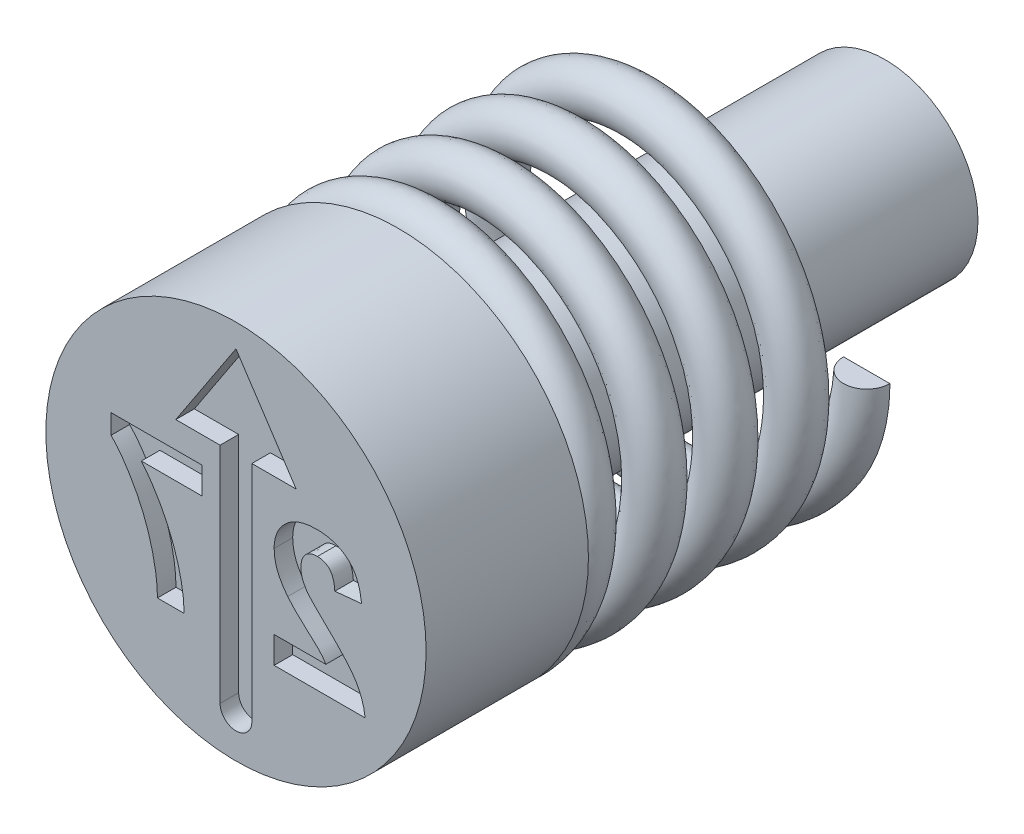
ISO-10303-21;
HEADER;
FILE_DESCRIPTION(('STEP AP214'),'2;1');
FILE_NAME('part.step','',(''),(''),'','','');
FILE_SCHEMA(('AUTOMOTIVE_DESIGN { 1 0 10303 214 1 1 1 1 }'));
ENDSEC;
DATA;
#1=APPLICATION_CONTEXT('core data for automotive mechanical design processes');
#2=APPLICATION_PROTOCOL_DEFINITION('international standard','automotive_design',2000,#1);
#3=PRODUCT_CONTEXT('',#1,'mechanical');
#4=PRODUCT('Part','Part','',(#3));
#5=PRODUCT_RELATED_PRODUCT_CATEGORY('part','',(#4));
#6=PRODUCT_DEFINITION_FORMATION('','',#4);
#7=PRODUCT_DEFINITION_CONTEXT('part definition',#1,'design');
#8=PRODUCT_DEFINITION('design','',#6,#7);
#9=PRODUCT_DEFINITION_SHAPE('','',#8);
#10=(LENGTH_UNIT() NAMED_UNIT(*) SI_UNIT(.MILLI.,.METRE.));
#11=(NAMED_UNIT(*) PLANE_ANGLE_UNIT() SI_UNIT($,.RADIAN.));
#12=(NAMED_UNIT(*) SI_UNIT($,.STERADIAN.) SOLID_ANGLE_UNIT());
#13=UNCERTAINTY_MEASURE_WITH_UNIT(LENGTH_MEASURE(1.E-05),#10,'distance_accuracy_value','');
#14=(GEOMETRIC_REPRESENTATION_CONTEXT(3) GLOBAL_UNCERTAINTY_ASSIGNED_CONTEXT((#13)) GLOBAL_UNIT_ASSIGNED_CONTEXT((#10,
#11,#12)) REPRESENTATION_CONTEXT('',''));
#15=CARTESIAN_POINT('',(0.,0.,0.));
#16=DIRECTION('',(0.,0.,1.));
#17=DIRECTION('',(1.,0.,0.));
#18=AXIS2_PLACEMENT_3D('',#15,#16,#17);
#19=CARTESIAN_POINT('',(3.6,0.,-10.5));
#20=DIRECTION('',(0.,-1.,0.));
#21=DIRECTION('',(0.,0.,-1.));
#22=AXIS2_PLACEMENT_3D('',#19,#20,#21);
#23=PLANE('',#22);
#24=CARTESIAN_POINT('',(3.6,0.,-10.));
#25=DIRECTION('',(0.,1.,0.));
#26=DIRECTION('',(0.,0.,1.));
#27=AXIS2_PLACEMENT_3D('',#24,#25,#26);
#28=CIRCLE('',#27,0.5);
#29=CARTESIAN_POINT('',(3.1,0.,-10.));
#30=VERTEX_POINT('',#29);
#31=CARTESIAN_POINT('',(4.1,0.,-10.));
#32=VERTEX_POINT('',#31);
#33=EDGE_CURVE('E88',#30,#32,#28,.T.);
#34=ORIENTED_EDGE('',*,*,#33,.T.);
#35=DIRECTION('',(-1.,0.,0.));
#36=VECTOR('',#35,1.);
#37=CARTESIAN_POINT('',(3.6,0.,-10.));
#38=LINE('',#37,#36);
#39=EDGE_CURVE('E75',#32,#30,#38,.T.);
#40=ORIENTED_EDGE('',*,*,#39,.T.);
#41=EDGE_LOOP('',(#34,#40));
#42=FACE_BOUND('',#41,.T.);
#43=ADVANCED_FACE('F49',(#42),#23,.F.);
#44=CARTESIAN_POINT('',(0.,-3.6,-4.));
#45=DIRECTION('',(-1.,0.,0.));
#46=DIRECTION('',(0.,-1.,0.));
#47=AXIS2_PLACEMENT_3D('',#44,#45,#46);
#48=PLANE('',#47);
#49=DIRECTION('',(0.,-1.,0.));
#50=VECTOR('',#49,1.);
#51=CARTESIAN_POINT('',(0.,-3.6,-3.5));
#52=LINE('',#51,#50);
#53=CARTESIAN_POINT('',(0.,-3.1,-3.5));
#54=VERTEX_POINT('',#53);
#55=CARTESIAN_POINT('',(0.,-4.1,-3.5));
#56=VERTEX_POINT('',#55);
#57=EDGE_CURVE('E69',#54,#56,#52,.T.);
#58=ORIENTED_EDGE('',*,*,#57,.F.);
#59=CARTESIAN_POINT('',(0.,-3.6,-3.5));
#60=DIRECTION('',(-1.,0.,0.));
#61=DIRECTION('',(0.,-1.,0.));
#62=AXIS2_PLACEMENT_3D('',#59,#60,#61);
#63=CIRCLE('',#62,0.5);
#64=EDGE_CURVE('E85',#54,#56,#63,.T.);
#65=ORIENTED_EDGE('',*,*,#64,.T.);
#66=EDGE_LOOP('',(#58,#65));
#67=FACE_BOUND('',#66,.T.);
#68=ADVANCED_FACE('F51',(#67),#48,.T.);
#69=CARTESIAN_POINT('',(3.6,0.,-9.5));
#70=CARTESIAN_POINT('',(3.6,-1.49116882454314,-9.40441176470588));
#71=CARTESIAN_POINT('',(2.54558441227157,-2.54558441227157,-9.30882352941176));
#72=CARTESIAN_POINT('',(1.49116882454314,-3.6,-9.21323529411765));
#73=CARTESIAN_POINT('',(0.,-3.6,-9.11764705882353));
#74=CARTESIAN_POINT('',(-1.49116882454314,-3.6,-9.02205882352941));
#75=CARTESIAN_POINT('',(-2.54558441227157,-2.54558441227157,-8.9264705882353));
#76=CARTESIAN_POINT('',(-3.6,-1.49116882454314,-8.83088235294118));
#77=CARTESIAN_POINT('',(-3.6,0.,-8.73529411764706));
#78=CARTESIAN_POINT('',(-3.6,1.49116882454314,-8.63970588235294));
#79=CARTESIAN_POINT('',(-2.54558441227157,2.54558441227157,-8.54411764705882));
#80=CARTESIAN_POINT('',(-1.49116882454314,3.6,-8.44852941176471));
#81=CARTESIAN_POINT('',(0.,3.6,-8.35294117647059));
#82=CARTESIAN_POINT('',(1.49116882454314,3.6,-8.25735294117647));
#83=CARTESIAN_POINT('',(2.54558441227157,2.54558441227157,-8.16176470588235));
#84=CARTESIAN_POINT('',(3.6,1.49116882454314,-8.06617647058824));
#85=CARTESIAN_POINT('',(3.6,0.,-7.97058823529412));
#86=CARTESIAN_POINT('',(3.6,-1.49116882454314,-7.875));
#87=CARTESIAN_POINT('',(2.54558441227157,-2.54558441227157,-7.77941176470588));
#88=CARTESIAN_POINT('',(1.49116882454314,-3.6,-7.68382352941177));
#89=CARTESIAN_POINT('',(0.,-3.6,-7.58823529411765));
#90=CARTESIAN_POINT('',(-1.49116882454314,-3.6,-7.49264705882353));
#91=CARTESIAN_POINT('',(-2.54558441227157,-2.54558441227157,-7.39705882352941));
#92=CARTESIAN_POINT('',(-3.6,-1.49116882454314,-7.3014705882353));
#93=CARTESIAN_POINT('',(-3.6,0.,-7.20588235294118));
#94=CARTESIAN_POINT('',(-3.6,1.49116882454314,-7.11029411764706));
#95=CARTESIAN_POINT('',(-2.54558441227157,2.54558441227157,-7.01470588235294));
#96=CARTESIAN_POINT('',(-1.49116882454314,3.6,-6.91911764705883));
#97=CARTESIAN_POINT('',(0.,3.6,-6.82352941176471));
#98=CARTESIAN_POINT('',(1.49116882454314,3.6,-6.72794117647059));
#99=CARTESIAN_POINT('',(2.54558441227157,2.54558441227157,-6.63235294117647));
#100=CARTESIAN_POINT('',(3.6,1.49116882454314,-6.53676470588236));
#101=CARTESIAN_POINT('',(3.6,0.,-6.44117647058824));
#102=CARTESIAN_POINT('',(3.6,-1.49116882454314,-6.34558823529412));
#103=CARTESIAN_POINT('',(2.54558441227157,-2.54558441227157,-6.25));
#104=CARTESIAN_POINT('',(1.49116882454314,-3.6,-6.15441176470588));
#105=CARTESIAN_POINT('',(0.,-3.6,-6.05882352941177));
#106=CARTESIAN_POINT('',(-1.49116882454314,-3.6,-5.96323529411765));
#107=CARTESIAN_POINT('',(-2.54558441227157,-2.54558441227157,-5.86764705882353));
#108=CARTESIAN_POINT('',(-3.6,-1.49116882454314,-5.77205882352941));
#109=CARTESIAN_POINT('',(-3.6,0.,-5.6764705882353));
#110=CARTESIAN_POINT('',(-3.6,1.49116882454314,-5.58088235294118));
#111=CARTESIAN_POINT('',(-2.54558441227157,2.54558441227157,-5.48529411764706));
#112=CARTESIAN_POINT('',(-1.49116882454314,3.6,-5.38970588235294));
#113=CARTESIAN_POINT('',(0.,3.6,-5.29411764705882));
#114=CARTESIAN_POINT('',(1.49116882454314,3.6,-5.19852941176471));
#115=CARTESIAN_POINT('',(2.54558441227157,2.54558441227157,-5.10294117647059));
#116=CARTESIAN_POINT('',(3.6,1.49116882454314,-5.00735294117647));
#117=CARTESIAN_POINT('',(3.6,0.,-4.91176470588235));
#118=CARTESIAN_POINT('',(3.6,-1.49116882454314,-4.81617647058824));
#119=CARTESIAN_POINT('',(2.54558441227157,-2.54558441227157,-4.72058823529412));
#120=CARTESIAN_POINT('',(1.49116882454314,-3.6,-4.625));
#121=CARTESIAN_POINT('',(0.,-3.6,-4.52941176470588));
#122=CARTESIAN_POINT('',(-1.49116882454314,-3.6,-4.43382352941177));
#123=CARTESIAN_POINT('',(-2.54558441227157,-2.54558441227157,-4.33823529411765));
#124=CARTESIAN_POINT('',(-3.6,-1.49116882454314,-4.24264705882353));
#125=CARTESIAN_POINT('',(-3.6,0.,-4.14705882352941));
#126=CARTESIAN_POINT('',(-3.6,1.49116882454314,-4.0514705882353));
#127=CARTESIAN_POINT('',(-2.54558441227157,2.54558441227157,-3.95588235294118));
#128=CARTESIAN_POINT('',(-1.49116882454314,3.6,-3.86029411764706));
#129=CARTESIAN_POINT('',(0.,3.6,-3.76470588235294));
#130=CARTESIAN_POINT('',(1.49116882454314,3.6,-3.66911764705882));
#131=CARTESIAN_POINT('',(2.54558441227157,2.54558441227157,-3.57352941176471));
#132=CARTESIAN_POINT('',(3.6,1.49116882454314,-3.47794117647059));
#133=CARTESIAN_POINT('',(3.6,0.,-3.38235294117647));
#134=CARTESIAN_POINT('',(3.6,-1.49116882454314,-3.28676470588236));
#135=CARTESIAN_POINT('',(2.54558441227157,-2.54558441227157,-3.19117647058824));
#136=CARTESIAN_POINT('',(1.49116882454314,-3.6,-3.09558823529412));
#137=CARTESIAN_POINT('',(0.,-3.6,-3.));
#138=CARTESIAN_POINT('',(4.6,0.,-9.5));
#139=CARTESIAN_POINT('',(4.6,-1.90538238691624,-9.40441176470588));
#140=CARTESIAN_POINT('',(3.25269119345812,-3.25269119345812,-9.30882352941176));
#141=CARTESIAN_POINT('',(1.90538238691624,-4.6,-9.21323529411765));
#142=CARTESIAN_POINT('',(0.,-4.6,-9.11764705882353));
#143=CARTESIAN_POINT('',(-1.90538238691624,-4.6,-9.02205882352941));
#144=CARTESIAN_POINT('',(-3.25269119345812,-3.25269119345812,-8.9264705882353));
#145=CARTESIAN_POINT('',(-4.6,-1.90538238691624,-8.83088235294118));
#146=CARTESIAN_POINT('',(-4.6,0.,-8.73529411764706));
#147=CARTESIAN_POINT('',(-4.6,1.90538238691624,-8.63970588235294));
#148=CARTESIAN_POINT('',(-3.25269119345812,3.25269119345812,-8.54411764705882));
#149=CARTESIAN_POINT('',(-1.90538238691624,4.6,-8.4485294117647));
#150=CARTESIAN_POINT('',(0.,4.6,-8.35294117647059));
#151=CARTESIAN_POINT('',(1.90538238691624,4.6,-8.25735294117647));
#152=CARTESIAN_POINT('',(3.25269119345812,3.25269119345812,-8.16176470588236));
#153=CARTESIAN_POINT('',(4.6,1.90538238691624,-8.06617647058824));
#154=CARTESIAN_POINT('',(4.6,0.,-7.97058823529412));
#155=CARTESIAN_POINT('',(4.6,-1.90538238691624,-7.875));
#156=CARTESIAN_POINT('',(3.25269119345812,-3.25269119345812,-7.77941176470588));
#157=CARTESIAN_POINT('',(1.90538238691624,-4.6,-7.68382352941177));
#158=CARTESIAN_POINT('',(0.,-4.6,-7.58823529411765));
#159=CARTESIAN_POINT('',(-1.90538238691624,-4.6,-7.49264705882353));
#160=CARTESIAN_POINT('',(-3.25269119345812,-3.25269119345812,-7.39705882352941));
#161=CARTESIAN_POINT('',(-4.6,-1.90538238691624,-7.30147058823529));
#162=CARTESIAN_POINT('',(-4.6,0.,-7.20588235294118));
#163=CARTESIAN_POINT('',(-4.6,1.90538238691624,-7.11029411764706));
#164=CARTESIAN_POINT('',(-3.25269119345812,3.25269119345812,-7.01470588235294));
#165=CARTESIAN_POINT('',(-1.90538238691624,4.6,-6.91911764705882));
#166=CARTESIAN_POINT('',(0.,4.6,-6.82352941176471));
#167=CARTESIAN_POINT('',(1.90538238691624,4.6,-6.72794117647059));
#168=CARTESIAN_POINT('',(3.25269119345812,3.25269119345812,-6.63235294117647));
#169=CARTESIAN_POINT('',(4.6,1.90538238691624,-6.53676470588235));
#170=CARTESIAN_POINT('',(4.6,0.,-6.44117647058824));
#171=CARTESIAN_POINT('',(4.6,-1.90538238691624,-6.34558823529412));
#172=CARTESIAN_POINT('',(3.25269119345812,-3.25269119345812,-6.25));
#173=CARTESIAN_POINT('',(1.90538238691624,-4.6,-6.15441176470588));
#174=CARTESIAN_POINT('',(0.,-4.6,-6.05882352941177));
#175=CARTESIAN_POINT('',(-1.90538238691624,-4.6,-5.96323529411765));
#176=CARTESIAN_POINT('',(-3.25269119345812,-3.25269119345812,-5.86764705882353));
#177=CARTESIAN_POINT('',(-4.6,-1.90538238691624,-5.77205882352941));
#178=CARTESIAN_POINT('',(-4.6,0.,-5.6764705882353));
#179=CARTESIAN_POINT('',(-4.6,1.90538238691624,-5.58088235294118));
#180=CARTESIAN_POINT('',(-3.25269119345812,3.25269119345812,-5.48529411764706));
#181=CARTESIAN_POINT('',(-1.90538238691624,4.6,-5.38970588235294));
#182=CARTESIAN_POINT('',(0.,4.6,-5.29411764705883));
#183=CARTESIAN_POINT('',(1.90538238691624,4.6,-5.19852941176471));
#184=CARTESIAN_POINT('',(3.25269119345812,3.25269119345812,-5.10294117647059));
#185=CARTESIAN_POINT('',(4.6,1.90538238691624,-5.00735294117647));
#186=CARTESIAN_POINT('',(4.6,0.,-4.91176470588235));
#187=CARTESIAN_POINT('',(4.6,-1.90538238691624,-4.81617647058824));
#188=CARTESIAN_POINT('',(3.25269119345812,-3.25269119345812,-4.72058823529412));
#189=CARTESIAN_POINT('',(1.90538238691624,-4.6,-4.625));
#190=CARTESIAN_POINT('',(0.,-4.6,-4.52941176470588));
#191=CARTESIAN_POINT('',(-1.90538238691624,-4.6,-4.43382352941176));
#192=CARTESIAN_POINT('',(-3.25269119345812,-3.25269119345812,-4.33823529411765));
#193=CARTESIAN_POINT('',(-4.6,-1.90538238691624,-4.24264705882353));
#194=CARTESIAN_POINT('',(-4.6,0.,-4.14705882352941));
#195=CARTESIAN_POINT('',(-4.6,1.90538238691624,-4.05147058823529));
#196=CARTESIAN_POINT('',(-3.25269119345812,3.25269119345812,-3.95588235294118));
#197=CARTESIAN_POINT('',(-1.90538238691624,4.6,-3.86029411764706));
#198=CARTESIAN_POINT('',(0.,4.6,-3.76470588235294));
#199=CARTESIAN_POINT('',(1.90538238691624,4.6,-3.66911764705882));
#200=CARTESIAN_POINT('',(3.25269119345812,3.25269119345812,-3.57352941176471));
#201=CARTESIAN_POINT('',(4.6,1.90538238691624,-3.47794117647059));
#202=CARTESIAN_POINT('',(4.6,0.,-3.38235294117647));
#203=CARTESIAN_POINT('',(4.6,-1.90538238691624,-3.28676470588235));
#204=CARTESIAN_POINT('',(3.25269119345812,-3.25269119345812,-3.19117647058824));
#205=CARTESIAN_POINT('',(1.90538238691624,-4.6,-3.09558823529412));
#206=CARTESIAN_POINT('',(0.,-4.6,-3.));
#207=CARTESIAN_POINT('',(4.6,0.,-10.5));
#208=CARTESIAN_POINT('',(4.6,-1.90538238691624,-10.4044117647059));
#209=CARTESIAN_POINT('',(3.25269119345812,-3.25269119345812,-10.3088235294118));
#210=CARTESIAN_POINT('',(1.90538238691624,-4.6,-10.2132352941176));
#211=CARTESIAN_POINT('',(0.,-4.6,-10.1176470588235));
#212=CARTESIAN_POINT('',(-1.90538238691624,-4.6,-10.0220588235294));
#213=CARTESIAN_POINT('',(-3.25269119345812,-3.25269119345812,-9.9264705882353));
#214=CARTESIAN_POINT('',(-4.6,-1.90538238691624,-9.83088235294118));
#215=CARTESIAN_POINT('',(-4.6,0.,-9.73529411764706));
#216=CARTESIAN_POINT('',(-4.6,1.90538238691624,-9.63970588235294));
#217=CARTESIAN_POINT('',(-3.25269119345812,3.25269119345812,-9.54411764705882));
#218=CARTESIAN_POINT('',(-1.90538238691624,4.6,-9.44852941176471));
#219=CARTESIAN_POINT('',(0.,4.6,-9.35294117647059));
#220=CARTESIAN_POINT('',(1.90538238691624,4.6,-9.25735294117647));
#221=CARTESIAN_POINT('',(3.25269119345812,3.25269119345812,-9.16176470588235));
#222=CARTESIAN_POINT('',(4.6,1.90538238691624,-9.06617647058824));
#223=CARTESIAN_POINT('',(4.6,0.,-8.97058823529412));
#224=CARTESIAN_POINT('',(4.6,-1.90538238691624,-8.875));
#225=CARTESIAN_POINT('',(3.25269119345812,-3.25269119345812,-8.77941176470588));
#226=CARTESIAN_POINT('',(1.90538238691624,-4.6,-8.68382352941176));
#227=CARTESIAN_POINT('',(0.,-4.6,-8.58823529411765));
#228=CARTESIAN_POINT('',(-1.90538238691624,-4.6,-8.49264705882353));
#229=CARTESIAN_POINT('',(-3.25269119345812,-3.25269119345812,-8.39705882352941));
#230=CARTESIAN_POINT('',(-4.6,-1.90538238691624,-8.30147058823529));
#231=CARTESIAN_POINT('',(-4.6,0.,-8.20588235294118));
#232=CARTESIAN_POINT('',(-4.6,1.90538238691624,-8.11029411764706));
#233=CARTESIAN_POINT('',(-3.25269119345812,3.25269119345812,-8.01470588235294));
#234=CARTESIAN_POINT('',(-1.90538238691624,4.6,-7.91911764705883));
#235=CARTESIAN_POINT('',(0.,4.6,-7.82352941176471));
#236=CARTESIAN_POINT('',(1.90538238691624,4.6,-7.72794117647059));
#237=CARTESIAN_POINT('',(3.25269119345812,3.25269119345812,-7.63235294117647));
#238=CARTESIAN_POINT('',(4.6,1.90538238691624,-7.53676470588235));
#239=CARTESIAN_POINT('',(4.6,0.,-7.44117647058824));
#240=CARTESIAN_POINT('',(4.6,-1.90538238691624,-7.34558823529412));
#241=CARTESIAN_POINT('',(3.25269119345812,-3.25269119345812,-7.25));
#242=CARTESIAN_POINT('',(1.90538238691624,-4.6,-7.15441176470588));
#243=CARTESIAN_POINT('',(0.,-4.6,-7.05882352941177));
#244=CARTESIAN_POINT('',(-1.90538238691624,-4.6,-6.96323529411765));
#245=CARTESIAN_POINT('',(-3.25269119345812,-3.25269119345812,-6.86764705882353));
#246=CARTESIAN_POINT('',(-4.6,-1.90538238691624,-6.77205882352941));
#247=CARTESIAN_POINT('',(-4.6,0.,-6.6764705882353));
#248=CARTESIAN_POINT('',(-4.6,1.90538238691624,-6.58088235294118));
#249=CARTESIAN_POINT('',(-3.25269119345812,3.25269119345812,-6.48529411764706));
#250=CARTESIAN_POINT('',(-1.90538238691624,4.6,-6.38970588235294));
#251=CARTESIAN_POINT('',(0.,4.6,-6.29411764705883));
#252=CARTESIAN_POINT('',(1.90538238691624,4.6,-6.19852941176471));
#253=CARTESIAN_POINT('',(3.25269119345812,3.25269119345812,-6.10294117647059));
#254=CARTESIAN_POINT('',(4.6,1.90538238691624,-6.00735294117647));
#255=CARTESIAN_POINT('',(4.6,0.,-5.91176470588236));
#256=CARTESIAN_POINT('',(4.6,-1.90538238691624,-5.81617647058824));
#257=CARTESIAN_POINT('',(3.25269119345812,-3.25269119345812,-5.72058823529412));
#258=CARTESIAN_POINT('',(1.90538238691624,-4.6,-5.625));
#259=CARTESIAN_POINT('',(0.,-4.6,-5.52941176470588));
#260=CARTESIAN_POINT('',(-1.90538238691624,-4.6,-5.43382352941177));
#261=CARTESIAN_POINT('',(-3.25269119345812,-3.25269119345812,-5.33823529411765));
#262=CARTESIAN_POINT('',(-4.6,-1.90538238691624,-5.24264705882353));
#263=CARTESIAN_POINT('',(-4.6,0.,-5.14705882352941));
#264=CARTESIAN_POINT('',(-4.6,1.90538238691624,-5.0514705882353));
#265=CARTESIAN_POINT('',(-3.25269119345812,3.25269119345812,-4.95588235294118));
#266=CARTESIAN_POINT('',(-1.90538238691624,4.6,-4.86029411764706));
#267=CARTESIAN_POINT('',(0.,4.6,-4.76470588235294));
#268=CARTESIAN_POINT('',(1.90538238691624,4.6,-4.66911764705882));
#269=CARTESIAN_POINT('',(3.25269119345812,3.25269119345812,-4.57352941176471));
#270=CARTESIAN_POINT('',(4.6,1.90538238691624,-4.47794117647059));
#271=CARTESIAN_POINT('',(4.6,0.,-4.38235294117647));
#272=CARTESIAN_POINT('',(4.6,-1.90538238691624,-4.28676470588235));
#273=CARTESIAN_POINT('',(3.25269119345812,-3.25269119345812,-4.19117647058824));
#274=CARTESIAN_POINT('',(1.90538238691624,-4.6,-4.09558823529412));
#275=CARTESIAN_POINT('',(0.,-4.6,-4.));
#276=CARTESIAN_POINT('',(3.6,0.,-10.5));
#277=CARTESIAN_POINT('',(3.6,-1.49116882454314,-10.4044117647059));
#278=CARTESIAN_POINT('',(2.54558441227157,-2.54558441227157,-10.3088235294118));
#279=CARTESIAN_POINT('',(1.49116882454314,-3.6,-10.2132352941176));
#280=CARTESIAN_POINT('',(0.,-3.6,-10.1176470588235));
#281=CARTESIAN_POINT('',(-1.49116882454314,-3.6,-10.0220588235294));
#282=CARTESIAN_POINT('',(-2.54558441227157,-2.54558441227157,-9.9264705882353));
#283=CARTESIAN_POINT('',(-3.6,-1.49116882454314,-9.83088235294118));
#284=CARTESIAN_POINT('',(-3.6,0.,-9.73529411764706));
#285=CARTESIAN_POINT('',(-3.6,1.49116882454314,-9.63970588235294));
#286=CARTESIAN_POINT('',(-2.54558441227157,2.54558441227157,-9.54411764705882));
#287=CARTESIAN_POINT('',(-1.49116882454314,3.6,-9.44852941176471));
#288=CARTESIAN_POINT('',(0.,3.6,-9.35294117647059));
#289=CARTESIAN_POINT('',(1.49116882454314,3.6,-9.25735294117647));
#290=CARTESIAN_POINT('',(2.54558441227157,2.54558441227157,-9.16176470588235));
#291=CARTESIAN_POINT('',(3.6,1.49116882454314,-9.06617647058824));
#292=CARTESIAN_POINT('',(3.6,0.,-8.97058823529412));
#293=CARTESIAN_POINT('',(3.6,-1.49116882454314,-8.875));
#294=CARTESIAN_POINT('',(2.54558441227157,-2.54558441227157,-8.77941176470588));
#295=CARTESIAN_POINT('',(1.49116882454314,-3.6,-8.68382352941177));
#296=CARTESIAN_POINT('',(0.,-3.6,-8.58823529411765));
#297=CARTESIAN_POINT('',(-1.49116882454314,-3.6,-8.49264705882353));
#298=CARTESIAN_POINT('',(-2.54558441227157,-2.54558441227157,-8.39705882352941));
#299=CARTESIAN_POINT('',(-3.6,-1.49116882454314,-8.3014705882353));
#300=CARTESIAN_POINT('',(-3.6,0.,-8.20588235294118));
#301=CARTESIAN_POINT('',(-3.6,1.49116882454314,-8.11029411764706));
#302=CARTESIAN_POINT('',(-2.54558441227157,2.54558441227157,-8.01470588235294));
#303=CARTESIAN_POINT('',(-1.49116882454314,3.6,-7.91911764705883));
#304=CARTESIAN_POINT('',(0.,3.6,-7.82352941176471));
#305=CARTESIAN_POINT('',(1.49116882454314,3.6,-7.72794117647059));
#306=CARTESIAN_POINT('',(2.54558441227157,2.54558441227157,-7.63235294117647));
#307=CARTESIAN_POINT('',(3.6,1.49116882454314,-7.53676470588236));
#308=CARTESIAN_POINT('',(3.6,0.,-7.44117647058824));
#309=CARTESIAN_POINT('',(3.6,-1.49116882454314,-7.34558823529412));
#310=CARTESIAN_POINT('',(2.54558441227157,-2.54558441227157,-7.25));
#311=CARTESIAN_POINT('',(1.49116882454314,-3.6,-7.15441176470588));
#312=CARTESIAN_POINT('',(0.,-3.6,-7.05882352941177));
#313=CARTESIAN_POINT('',(-1.49116882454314,-3.6,-6.96323529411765));
#314=CARTESIAN_POINT('',(-2.54558441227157,-2.54558441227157,-6.86764705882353));
#315=CARTESIAN_POINT('',(-3.6,-1.49116882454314,-6.77205882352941));
#316=CARTESIAN_POINT('',(-3.6,0.,-6.6764705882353));
#317=CARTESIAN_POINT('',(-3.6,1.49116882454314,-6.58088235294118));
#318=CARTESIAN_POINT('',(-2.54558441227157,2.54558441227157,-6.48529411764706));
#319=CARTESIAN_POINT('',(-1.49116882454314,3.6,-6.38970588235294));
#320=CARTESIAN_POINT('',(0.,3.6,-6.29411764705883));
#321=CARTESIAN_POINT('',(1.49116882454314,3.6,-6.19852941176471));
#322=CARTESIAN_POINT('',(2.54558441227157,2.54558441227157,-6.10294117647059));
#323=CARTESIAN_POINT('',(3.6,1.49116882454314,-6.00735294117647));
#324=CARTESIAN_POINT('',(3.6,0.,-5.91176470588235));
#325=CARTESIAN_POINT('',(3.6,-1.49116882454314,-5.81617647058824));
#326=CARTESIAN_POINT('',(2.54558441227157,-2.54558441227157,-5.72058823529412));
#327=CARTESIAN_POINT('',(1.49116882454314,-3.6,-5.625));
#328=CARTESIAN_POINT('',(0.,-3.6,-5.52941176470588));
#329=CARTESIAN_POINT('',(-1.49116882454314,-3.6,-5.43382352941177));
#330=CARTESIAN_POINT('',(-2.54558441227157,-2.54558441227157,-5.33823529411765));
#331=CARTESIAN_POINT('',(-3.6,-1.49116882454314,-5.24264705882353));
#332=CARTESIAN_POINT('',(-3.6,0.,-5.14705882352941));
#333=CARTESIAN_POINT('',(-3.6,1.49116882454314,-5.0514705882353));
#334=CARTESIAN_POINT('',(-2.54558441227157,2.54558441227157,-4.95588235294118));
#335=CARTESIAN_POINT('',(-1.49116882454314,3.6,-4.86029411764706));
#336=CARTESIAN_POINT('',(0.,3.6,-4.76470588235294));
#337=CARTESIAN_POINT('',(1.49116882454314,3.6,-4.66911764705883));
#338=CARTESIAN_POINT('',(2.54558441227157,2.54558441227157,-4.57352941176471));
#339=CARTESIAN_POINT('',(3.6,1.49116882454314,-4.47794117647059));
#340=CARTESIAN_POINT('',(3.6,0.,-4.38235294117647));
#341=CARTESIAN_POINT('',(3.6,-1.49116882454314,-4.28676470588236));
#342=CARTESIAN_POINT('',(2.54558441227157,-2.54558441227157,-4.19117647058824));
#343=CARTESIAN_POINT('',(1.49116882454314,-3.6,-4.09558823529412));
#344=CARTESIAN_POINT('',(0.,-3.6,-4.));
#345=CARTESIAN_POINT('',(2.6,0.,-10.5));
#346=CARTESIAN_POINT('',(2.6,-1.07695526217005,-10.4044117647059));
#347=CARTESIAN_POINT('',(1.83847763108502,-1.83847763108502,-10.3088235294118));
#348=CARTESIAN_POINT('',(1.07695526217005,-2.6,-10.2132352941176));
#349=CARTESIAN_POINT('',(0.,-2.6,-10.1176470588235));
#350=CARTESIAN_POINT('',(-1.07695526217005,-2.6,-10.0220588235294));
#351=CARTESIAN_POINT('',(-1.83847763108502,-1.83847763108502,-9.9264705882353));
#352=CARTESIAN_POINT('',(-2.6,-1.07695526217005,-9.83088235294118));
#353=CARTESIAN_POINT('',(-2.6,0.,-9.73529411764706));
#354=CARTESIAN_POINT('',(-2.6,1.07695526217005,-9.63970588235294));
#355=CARTESIAN_POINT('',(-1.83847763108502,1.83847763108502,-9.54411764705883));
#356=CARTESIAN_POINT('',(-1.07695526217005,2.6,-9.44852941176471));
#357=CARTESIAN_POINT('',(0.,2.6,-9.35294117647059));
#358=CARTESIAN_POINT('',(1.07695526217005,2.6,-9.25735294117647));
#359=CARTESIAN_POINT('',(1.83847763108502,1.83847763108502,-9.16176470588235));
#360=CARTESIAN_POINT('',(2.6,1.07695526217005,-9.06617647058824));
#361=CARTESIAN_POINT('',(2.6,0.,-8.97058823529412));
#362=CARTESIAN_POINT('',(2.6,-1.07695526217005,-8.875));
#363=CARTESIAN_POINT('',(1.83847763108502,-1.83847763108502,-8.77941176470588));
#364=CARTESIAN_POINT('',(1.07695526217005,-2.6,-8.68382352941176));
#365=CARTESIAN_POINT('',(0.,-2.6,-8.58823529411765));
#366=CARTESIAN_POINT('',(-1.07695526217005,-2.6,-8.49264705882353));
#367=CARTESIAN_POINT('',(-1.83847763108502,-1.83847763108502,-8.39705882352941));
#368=CARTESIAN_POINT('',(-2.6,-1.07695526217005,-8.30147058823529));
#369=CARTESIAN_POINT('',(-2.6,0.,-8.20588235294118));
#370=CARTESIAN_POINT('',(-2.6,1.07695526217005,-8.11029411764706));
#371=CARTESIAN_POINT('',(-1.83847763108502,1.83847763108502,-8.01470588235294));
#372=CARTESIAN_POINT('',(-1.07695526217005,2.6,-7.91911764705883));
#373=CARTESIAN_POINT('',(0.,2.6,-7.82352941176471));
#374=CARTESIAN_POINT('',(1.07695526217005,2.6,-7.72794117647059));
#375=CARTESIAN_POINT('',(1.83847763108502,1.83847763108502,-7.63235294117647));
#376=CARTESIAN_POINT('',(2.6,1.07695526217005,-7.53676470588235));
#377=CARTESIAN_POINT('',(2.6,0.,-7.44117647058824));
#378=CARTESIAN_POINT('',(2.6,-1.07695526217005,-7.34558823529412));
#379=CARTESIAN_POINT('',(1.83847763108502,-1.83847763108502,-7.25));
#380=CARTESIAN_POINT('',(1.07695526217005,-2.6,-7.15441176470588));
#381=CARTESIAN_POINT('',(0.,-2.6,-7.05882352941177));
#382=CARTESIAN_POINT('',(-1.07695526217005,-2.6,-6.96323529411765));
#383=CARTESIAN_POINT('',(-1.83847763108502,-1.83847763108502,-6.86764705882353));
#384=CARTESIAN_POINT('',(-2.6,-1.07695526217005,-6.77205882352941));
#385=CARTESIAN_POINT('',(-2.6,0.,-6.6764705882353));
#386=CARTESIAN_POINT('',(-2.6,1.07695526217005,-6.58088235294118));
#387=CARTESIAN_POINT('',(-1.83847763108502,1.83847763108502,-6.48529411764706));
#388=CARTESIAN_POINT('',(-1.07695526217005,2.6,-6.38970588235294));
#389=CARTESIAN_POINT('',(0.,2.6,-6.29411764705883));
#390=CARTESIAN_POINT('',(1.07695526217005,2.6,-6.19852941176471));
#391=CARTESIAN_POINT('',(1.83847763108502,1.83847763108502,-6.10294117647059));
#392=CARTESIAN_POINT('',(2.6,1.07695526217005,-6.00735294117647));
#393=CARTESIAN_POINT('',(2.6,0.,-5.91176470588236));
#394=CARTESIAN_POINT('',(2.6,-1.07695526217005,-5.81617647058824));
#395=CARTESIAN_POINT('',(1.83847763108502,-1.83847763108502,-5.72058823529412));
#396=CARTESIAN_POINT('',(1.07695526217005,-2.6,-5.625));
#397=CARTESIAN_POINT('',(0.,-2.6,-5.52941176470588));
#398=CARTESIAN_POINT('',(-1.07695526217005,-2.6,-5.43382352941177));
#399=CARTESIAN_POINT('',(-1.83847763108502,-1.83847763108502,-5.33823529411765));
#400=CARTESIAN_POINT('',(-2.6,-1.07695526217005,-5.24264705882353));
#401=CARTESIAN_POINT('',(-2.6,0.,-5.14705882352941));
#402=CARTESIAN_POINT('',(-2.6,1.07695526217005,-5.0514705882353));
#403=CARTESIAN_POINT('',(-1.83847763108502,1.83847763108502,-4.95588235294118));
#404=CARTESIAN_POINT('',(-1.07695526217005,2.6,-4.86029411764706));
#405=CARTESIAN_POINT('',(0.,2.6,-4.76470588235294));
#406=CARTESIAN_POINT('',(1.07695526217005,2.6,-4.66911764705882));
#407=CARTESIAN_POINT('',(1.83847763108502,1.83847763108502,-4.57352941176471));
#408=CARTESIAN_POINT('',(2.6,1.07695526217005,-4.47794117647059));
#409=CARTESIAN_POINT('',(2.6,0.,-4.38235294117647));
#410=CARTESIAN_POINT('',(2.6,-1.07695526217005,-4.28676470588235));
#411=CARTESIAN_POINT('',(1.83847763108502,-1.83847763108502,-4.19117647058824));
#412=CARTESIAN_POINT('',(1.07695526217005,-2.6,-4.09558823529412));
#413=CARTESIAN_POINT('',(0.,-2.6,-4.));
#414=CARTESIAN_POINT('',(2.6,0.,-9.5));
#415=CARTESIAN_POINT('',(2.6,-1.07695526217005,-9.40441176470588));
#416=CARTESIAN_POINT('',(1.83847763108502,-1.83847763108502,-9.30882352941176));
#417=CARTESIAN_POINT('',(1.07695526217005,-2.6,-9.21323529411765));
#418=CARTESIAN_POINT('',(0.,-2.6,-9.11764705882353));
#419=CARTESIAN_POINT('',(-1.07695526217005,-2.6,-9.02205882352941));
#420=CARTESIAN_POINT('',(-1.83847763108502,-1.83847763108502,-8.9264705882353));
#421=CARTESIAN_POINT('',(-2.6,-1.07695526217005,-8.83088235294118));
#422=CARTESIAN_POINT('',(-2.6,0.,-8.73529411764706));
#423=CARTESIAN_POINT('',(-2.6,1.07695526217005,-8.63970588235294));
#424=CARTESIAN_POINT('',(-1.83847763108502,1.83847763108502,-8.54411764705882));
#425=CARTESIAN_POINT('',(-1.07695526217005,2.6,-8.4485294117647));
#426=CARTESIAN_POINT('',(0.,2.6,-8.35294117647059));
#427=CARTESIAN_POINT('',(1.07695526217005,2.6,-8.25735294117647));
#428=CARTESIAN_POINT('',(1.83847763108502,1.83847763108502,-8.16176470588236));
#429=CARTESIAN_POINT('',(2.6,1.07695526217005,-8.06617647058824));
#430=CARTESIAN_POINT('',(2.6,0.,-7.97058823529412));
#431=CARTESIAN_POINT('',(2.6,-1.07695526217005,-7.875));
#432=CARTESIAN_POINT('',(1.83847763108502,-1.83847763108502,-7.77941176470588));
#433=CARTESIAN_POINT('',(1.07695526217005,-2.6,-7.68382352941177));
#434=CARTESIAN_POINT('',(0.,-2.6,-7.58823529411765));
#435=CARTESIAN_POINT('',(-1.07695526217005,-2.6,-7.49264705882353));
#436=CARTESIAN_POINT('',(-1.83847763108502,-1.83847763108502,-7.39705882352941));
#437=CARTESIAN_POINT('',(-2.6,-1.07695526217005,-7.30147058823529));
#438=CARTESIAN_POINT('',(-2.6,0.,-7.20588235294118));
#439=CARTESIAN_POINT('',(-2.6,1.07695526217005,-7.11029411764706));
#440=CARTESIAN_POINT('',(-1.83847763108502,1.83847763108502,-7.01470588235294));
#441=CARTESIAN_POINT('',(-1.07695526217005,2.6,-6.91911764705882));
#442=CARTESIAN_POINT('',(0.,2.6,-6.82352941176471));
#443=CARTESIAN_POINT('',(1.07695526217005,2.6,-6.72794117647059));
#444=CARTESIAN_POINT('',(1.83847763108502,1.83847763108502,-6.63235294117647));
#445=CARTESIAN_POINT('',(2.6,1.07695526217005,-6.53676470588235));
#446=CARTESIAN_POINT('',(2.6,0.,-6.44117647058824));
#447=CARTESIAN_POINT('',(2.6,-1.07695526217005,-6.34558823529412));
#448=CARTESIAN_POINT('',(1.83847763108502,-1.83847763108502,-6.25));
#449=CARTESIAN_POINT('',(1.07695526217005,-2.6,-6.15441176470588));
#450=CARTESIAN_POINT('',(0.,-2.6,-6.05882352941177));
#451=CARTESIAN_POINT('',(-1.07695526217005,-2.6,-5.96323529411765));
#452=CARTESIAN_POINT('',(-1.83847763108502,-1.83847763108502,-5.86764705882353));
#453=CARTESIAN_POINT('',(-2.6,-1.07695526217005,-5.77205882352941));
#454=CARTESIAN_POINT('',(-2.6,0.,-5.6764705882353));
#455=CARTESIAN_POINT('',(-2.6,1.07695526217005,-5.58088235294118));
#456=CARTESIAN_POINT('',(-1.83847763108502,1.83847763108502,-5.48529411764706));
#457=CARTESIAN_POINT('',(-1.07695526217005,2.6,-5.38970588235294));
#458=CARTESIAN_POINT('',(0.,2.6,-5.29411764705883));
#459=CARTESIAN_POINT('',(1.07695526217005,2.6,-5.19852941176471));
#460=CARTESIAN_POINT('',(1.83847763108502,1.83847763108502,-5.10294117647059));
#461=CARTESIAN_POINT('',(2.6,1.07695526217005,-5.00735294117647));
#462=CARTESIAN_POINT('',(2.6,0.,-4.91176470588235));
#463=CARTESIAN_POINT('',(2.6,-1.07695526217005,-4.81617647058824));
#464=CARTESIAN_POINT('',(1.83847763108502,-1.83847763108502,-4.72058823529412));
#465=CARTESIAN_POINT('',(1.07695526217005,-2.6,-4.625));
#466=CARTESIAN_POINT('',(0.,-2.6,-4.52941176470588));
#467=CARTESIAN_POINT('',(-1.07695526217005,-2.6,-4.43382352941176));
#468=CARTESIAN_POINT('',(-1.83847763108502,-1.83847763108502,-4.33823529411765));
#469=CARTESIAN_POINT('',(-2.6,-1.07695526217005,-4.24264705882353));
#470=CARTESIAN_POINT('',(-2.6,0.,-4.14705882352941));
#471=CARTESIAN_POINT('',(-2.6,1.07695526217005,-4.05147058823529));
#472=CARTESIAN_POINT('',(-1.83847763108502,1.83847763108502,-3.95588235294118));
#473=CARTESIAN_POINT('',(-1.07695526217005,2.6,-3.86029411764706));
#474=CARTESIAN_POINT('',(0.,2.6,-3.76470588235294));
#475=CARTESIAN_POINT('',(1.07695526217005,2.6,-3.66911764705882));
#476=CARTESIAN_POINT('',(1.83847763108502,1.83847763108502,-3.57352941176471));
#477=CARTESIAN_POINT('',(2.6,1.07695526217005,-3.47794117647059));
#478=CARTESIAN_POINT('',(2.6,0.,-3.38235294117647));
#479=CARTESIAN_POINT('',(2.6,-1.07695526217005,-3.28676470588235));
#480=CARTESIAN_POINT('',(1.83847763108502,-1.83847763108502,-3.19117647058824));
#481=CARTESIAN_POINT('',(1.07695526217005,-2.6,-3.09558823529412));
#482=CARTESIAN_POINT('',(0.,-2.6,-3.));
#483=CARTESIAN_POINT('',(3.6,0.,-9.5));
#484=CARTESIAN_POINT('',(3.6,-1.49116882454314,-9.40441176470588));
#485=CARTESIAN_POINT('',(2.54558441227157,-2.54558441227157,-9.30882352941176));
#486=CARTESIAN_POINT('',(1.49116882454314,-3.6,-9.21323529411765));
#487=CARTESIAN_POINT('',(0.,-3.6,-9.11764705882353));
#488=CARTESIAN_POINT('',(-1.49116882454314,-3.6,-9.02205882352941));
#489=CARTESIAN_POINT('',(-2.54558441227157,-2.54558441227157,-8.9264705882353));
#490=CARTESIAN_POINT('',(-3.6,-1.49116882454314,-8.83088235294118));
#491=CARTESIAN_POINT('',(-3.6,0.,-8.73529411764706));
#492=CARTESIAN_POINT('',(-3.6,1.49116882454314,-8.63970588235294));
#493=CARTESIAN_POINT('',(-2.54558441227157,2.54558441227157,-8.54411764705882));
#494=CARTESIAN_POINT('',(-1.49116882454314,3.6,-8.44852941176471));
#495=CARTESIAN_POINT('',(0.,3.6,-8.35294117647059));
#496=CARTESIAN_POINT('',(1.49116882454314,3.6,-8.25735294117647));
#497=CARTESIAN_POINT('',(2.54558441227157,2.54558441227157,-8.16176470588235));
#498=CARTESIAN_POINT('',(3.6,1.49116882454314,-8.06617647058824));
#499=CARTESIAN_POINT('',(3.6,0.,-7.97058823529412));
#500=CARTESIAN_POINT('',(3.6,-1.49116882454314,-7.875));
#501=CARTESIAN_POINT('',(2.54558441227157,-2.54558441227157,-7.77941176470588));
#502=CARTESIAN_POINT('',(1.49116882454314,-3.6,-7.68382352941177));
#503=CARTESIAN_POINT('',(0.,-3.6,-7.58823529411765));
#504=CARTESIAN_POINT('',(-1.49116882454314,-3.6,-7.49264705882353));
#505=CARTESIAN_POINT('',(-2.54558441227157,-2.54558441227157,-7.39705882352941));
#506=CARTESIAN_POINT('',(-3.6,-1.49116882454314,-7.3014705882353));
#507=CARTESIAN_POINT('',(-3.6,0.,-7.20588235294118));
#508=CARTESIAN_POINT('',(-3.6,1.49116882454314,-7.11029411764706));
#509=CARTESIAN_POINT('',(-2.54558441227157,2.54558441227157,-7.01470588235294));
#510=CARTESIAN_POINT('',(-1.49116882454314,3.6,-6.91911764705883));
#511=CARTESIAN_POINT('',(0.,3.6,-6.82352941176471));
#512=CARTESIAN_POINT('',(1.49116882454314,3.6,-6.72794117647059));
#513=CARTESIAN_POINT('',(2.54558441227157,2.54558441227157,-6.63235294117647));
#514=CARTESIAN_POINT('',(3.6,1.49116882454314,-6.53676470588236));
#515=CARTESIAN_POINT('',(3.6,0.,-6.44117647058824));
#516=CARTESIAN_POINT('',(3.6,-1.49116882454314,-6.34558823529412));
#517=CARTESIAN_POINT('',(2.54558441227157,-2.54558441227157,-6.25));
#518=CARTESIAN_POINT('',(1.49116882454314,-3.6,-6.15441176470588));
#519=CARTESIAN_POINT('',(0.,-3.6,-6.05882352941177));
#520=CARTESIAN_POINT('',(-1.49116882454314,-3.6,-5.96323529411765));
#521=CARTESIAN_POINT('',(-2.54558441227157,-2.54558441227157,-5.86764705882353));
#522=CARTESIAN_POINT('',(-3.6,-1.49116882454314,-5.77205882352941));
#523=CARTESIAN_POINT('',(-3.6,0.,-5.6764705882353));
#524=CARTESIAN_POINT('',(-3.6,1.49116882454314,-5.58088235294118));
#525=CARTESIAN_POINT('',(-2.54558441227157,2.54558441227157,-5.48529411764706));
#526=CARTESIAN_POINT('',(-1.49116882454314,3.6,-5.38970588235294));
#527=CARTESIAN_POINT('',(0.,3.6,-5.29411764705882));
#528=CARTESIAN_POINT('',(1.49116882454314,3.6,-5.19852941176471));
#529=CARTESIAN_POINT('',(2.54558441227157,2.54558441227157,-5.10294117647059));
#530=CARTESIAN_POINT('',(3.6,1.49116882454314,-5.00735294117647));
#531=CARTESIAN_POINT('',(3.6,0.,-4.91176470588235));
#532=CARTESIAN_POINT('',(3.6,-1.49116882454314,-4.81617647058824));
#533=CARTESIAN_POINT('',(2.54558441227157,-2.54558441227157,-4.72058823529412));
#534=CARTESIAN_POINT('',(1.49116882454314,-3.6,-4.625));
#535=CARTESIAN_POINT('',(0.,-3.6,-4.52941176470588));
#536=CARTESIAN_POINT('',(-1.49116882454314,-3.6,-4.43382352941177));
#537=CARTESIAN_POINT('',(-2.54558441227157,-2.54558441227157,-4.33823529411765));
#538=CARTESIAN_POINT('',(-3.6,-1.49116882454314,-4.24264705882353));
#539=CARTESIAN_POINT('',(-3.6,0.,-4.14705882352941));
#540=CARTESIAN_POINT('',(-3.6,1.49116882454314,-4.0514705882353));
#541=CARTESIAN_POINT('',(-2.54558441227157,2.54558441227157,-3.95588235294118));
#542=CARTESIAN_POINT('',(-1.49116882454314,3.6,-3.86029411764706));
#543=CARTESIAN_POINT('',(0.,3.6,-3.76470588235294));
#544=CARTESIAN_POINT('',(1.49116882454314,3.6,-3.66911764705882));
#545=CARTESIAN_POINT('',(2.54558441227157,2.54558441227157,-3.57352941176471));
#546=CARTESIAN_POINT('',(3.6,1.49116882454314,-3.47794117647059));
#547=CARTESIAN_POINT('',(3.6,0.,-3.38235294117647));
#548=CARTESIAN_POINT('',(3.6,-1.49116882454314,-3.28676470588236));
#549=CARTESIAN_POINT('',(2.54558441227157,-2.54558441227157,-3.19117647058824));
#550=CARTESIAN_POINT('',(1.49116882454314,-3.6,-3.09558823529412));
#551=CARTESIAN_POINT('',(0.,-3.6,-3.));
#552=(BOUNDED_SURFACE() B_SPLINE_SURFACE(3,2,((#69,#70,#71,#72,#73,#74,#75,#76,#77,#78,#79,#80,
#81,#82,#83,#84,#85,#86,#87,#88,#89,#90,#91,#92,#93,#94,#95,#96,#97,#98,#99,#100,#101,#102,#103,
#104,#105,#106,#107,#108,#109,#110,#111,#112,#113,#114,#115,#116,#117,#118,#119,#120,#121,#122,
#123,#124,#125,#126,#127,#128,#129,#130,#131,#132,#133,#134,#135,#136,#137),(#138,#139,#140,
#141,#142,#143,#144,#145,#146,#147,#148,#149,#150,#151,#152,#153,#154,#155,#156,#157,#158,#159,
#160,#161,#162,#163,#164,#165,#166,#167,#168,#169,#170,#171,#172,#173,#174,#175,#176,#177,#178,
#179,#180,#181,#182,#183,#184,#185,#186,#187,#188,#189,#190,#191,#192,#193,#194,#195,#196,#197,
#198,#199,#200,#201,#202,#203,#204,#205,#206),(#207,#208,#209,#210,#211,#212,#213,#214,#215,
#216,#217,#218,#219,#220,#221,#222,#223,#224,#225,#226,#227,#228,#229,#230,#231,#232,#233,#234,
#235,#236,#237,#238,#239,#240,#241,#242,#243,#244,#245,#246,#247,#248,#249,#250,#251,#252,#253,
#254,#255,#256,#257,#258,#259,#260,#261,#262,#263,#264,#265,#266,#267,#268,#269,#270,#271,#272,
#273,#274,#275),(#276,#277,#278,#279,#280,#281,#282,#283,#284,#285,#286,#287,#288,#289,#290,
#291,#292,#293,#294,#295,#296,#297,#298,#299,#300,#301,#302,#303,#304,#305,#306,#307,#308,#309,
#310,#311,#312,#313,#314,#315,#316,#317,#318,#319,#320,#321,#322,#323,#324,#325,#326,#327,#328,
#329,#330,#331,#332,#333,#334,#335,#336,#337,#338,#339,#340,#341,#342,#343,#344),(#345,#346,
#347,#348,#349,#350,#351,#352,#353,#354,#355,#356,#357,#358,#359,#360,#361,#362,#363,#364,#365,
#366,#367,#368,#369,#370,#371,#372,#373,#374,#375,#376,#377,#378,#379,#380,#381,#382,#383,#384,
#385,#386,#387,#388,#389,#390,#391,#392,#393,#394,#395,#396,#397,#398,#399,#400,#401,#402,#403,
#404,#405,#406,#407,#408,#409,#410,#411,#412,#413),(#414,#415,#416,#417,#418,#419,#420,#421,
#422,#423,#424,#425,#426,#427,#428,#429,#430,#431,#432,#433,#434,#435,#436,#437,#438,#439,#440,
#441,#442,#443,#444,#445,#446,#447,#448,#449,#450,#451,#452,#453,#454,#455,#456,#457,#458,#459,
#460,#461,#462,#463,#464,#465,#466,#467,#468,#469,#470,#471,#472,#473,#474,#475,#476,#477,#478,
#479,#480,#481,#482),(#483,#484,#485,#486,#487,#488,#489,#490,#491,#492,#493,#494,#495,#496,
#497,#498,#499,#500,#501,#502,#503,#504,#505,#506,#507,#508,#509,#510,#511,#512,#513,#514,#515,
#516,#517,#518,#519,#520,#521,#522,#523,#524,#525,#526,#527,#528,#529,#530,#531,#532,#533,#534,
#535,#536,#537,#538,#539,#540,#541,#542,#543,#544,#545,#546,#547,#548,#549,#550,#551)),
.UNSPECIFIED.,.T.,.F.,.F.) B_SPLINE_SURFACE_WITH_KNOTS((4,3,4),(3,2,2,2,2,2,2,2,2,2,2,2,2,2,2,2,
2,2,2,2,2,2,2,2,2,2,2,2,2,2,2,2,2,2,3),(0.,0.5,1.),(0.,0.025,0.05,0.075,0.1,0.125,0.15,0.175,
0.2,0.225,0.25,0.275,0.3,0.325,0.35,0.375,0.4,0.425,0.45,0.475,0.5,0.525,0.55,0.575,0.6,0.625,
0.65,0.675,0.7,0.725,0.75,0.775,0.8,0.825,0.85),
.UNSPECIFIED.) GEOMETRIC_REPRESENTATION_ITEM() RATIONAL_B_SPLINE_SURFACE(((1.,0.923879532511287,
1.,0.923879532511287,1.,0.923879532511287,1.,0.923879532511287,1.,0.923879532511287,1.,
0.923879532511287,1.,0.923879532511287,1.,0.923879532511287,1.,0.923879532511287,1.,
0.923879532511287,1.,0.923879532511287,1.,0.923879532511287,1.,0.923879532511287,1.,
0.923879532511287,1.,0.923879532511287,1.,0.923879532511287,1.,0.923879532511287,1.,
0.923879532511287,1.,0.923879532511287,1.,0.923879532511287,1.,0.923879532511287,1.,
0.923879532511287,1.,0.923879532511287,1.,0.923879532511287,1.,0.923879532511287,1.,
0.923879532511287,1.,0.923879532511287,1.,0.923879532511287,1.,0.923879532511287,1.,
0.923879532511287,1.,0.923879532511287,1.,0.923879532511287,1.,0.923879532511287,1.,
0.923879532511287,1.),(0.333333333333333,0.307959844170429,0.333333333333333,0.307959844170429,
0.333333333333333,0.307959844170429,0.333333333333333,0.307959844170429,0.333333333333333,
0.307959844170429,0.333333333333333,0.307959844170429,0.333333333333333,0.307959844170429,
0.333333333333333,0.307959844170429,0.333333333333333,0.307959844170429,0.333333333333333,
0.307959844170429,0.333333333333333,0.307959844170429,0.333333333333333,0.307959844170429,
0.333333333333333,0.307959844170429,0.333333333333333,0.307959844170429,0.333333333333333,
0.307959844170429,0.333333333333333,0.307959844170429,0.333333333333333,0.307959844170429,
0.333333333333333,0.307959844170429,0.333333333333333,0.307959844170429,0.333333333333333,
0.307959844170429,0.333333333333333,0.307959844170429,0.333333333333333,0.307959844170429,
0.333333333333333,0.307959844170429,0.333333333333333,0.307959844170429,0.333333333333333,
0.307959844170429,0.333333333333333,0.307959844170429,0.333333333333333,0.307959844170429,
0.333333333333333,0.307959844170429,0.333333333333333,0.307959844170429,0.333333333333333,
0.307959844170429,0.333333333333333,0.307959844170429,0.333333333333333,0.307959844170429,
0.333333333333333,0.307959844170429,0.333333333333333,0.307959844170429,0.333333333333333),
(0.333333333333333,0.307959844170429,0.333333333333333,0.307959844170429,0.333333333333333,
0.307959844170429,0.333333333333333,0.307959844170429,0.333333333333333,0.307959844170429,
0.333333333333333,0.307959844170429,0.333333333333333,0.307959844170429,0.333333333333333,
0.307959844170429,0.333333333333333,0.307959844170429,0.333333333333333,0.307959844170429,
0.333333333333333,0.307959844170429,0.333333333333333,0.307959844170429,0.333333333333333,
0.307959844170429,0.333333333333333,0.307959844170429,0.333333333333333,0.307959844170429,
0.333333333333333,0.307959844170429,0.333333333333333,0.307959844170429,0.333333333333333,
0.307959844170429,0.333333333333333,0.307959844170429,0.333333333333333,0.307959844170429,
0.333333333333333,0.307959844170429,0.333333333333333,0.307959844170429,0.333333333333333,
0.307959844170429,0.333333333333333,0.307959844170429,0.333333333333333,0.307959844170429,
0.333333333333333,0.307959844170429,0.333333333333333,0.307959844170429,0.333333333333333,
0.307959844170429,0.333333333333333,0.307959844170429,0.333333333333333,0.307959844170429,
0.333333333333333,0.307959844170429,0.333333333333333,0.307959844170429,0.333333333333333,
0.307959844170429,0.333333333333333,0.307959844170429,0.333333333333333),(1.,0.923879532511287,
1.,0.923879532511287,1.,0.923879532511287,1.,0.923879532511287,1.,0.923879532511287,1.,
0.923879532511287,1.,0.923879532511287,1.,0.923879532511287,1.,0.923879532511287,1.,
0.923879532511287,1.,0.923879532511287,1.,0.923879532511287,1.,0.923879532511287,1.,
0.923879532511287,1.,0.923879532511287,1.,0.923879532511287,1.,0.923879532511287,1.,
0.923879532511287,1.,0.923879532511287,1.,0.923879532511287,1.,0.923879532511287,1.,
0.923879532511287,1.,0.923879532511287,1.,0.923879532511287,1.,0.923879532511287,1.,
0.923879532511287,1.,0.923879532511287,1.,0.923879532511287,1.,0.923879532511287,1.,
0.923879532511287,1.,0.923879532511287,1.,0.923879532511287,1.,0.923879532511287,1.,
0.923879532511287,1.),(0.333333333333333,0.307959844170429,0.333333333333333,0.307959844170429,
0.333333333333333,0.307959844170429,0.333333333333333,0.307959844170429,0.333333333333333,
0.307959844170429,0.333333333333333,0.307959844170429,0.333333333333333,0.307959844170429,
0.333333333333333,0.307959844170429,0.333333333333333,0.307959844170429,0.333333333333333,
0.307959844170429,0.333333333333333,0.307959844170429,0.333333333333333,0.307959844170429,
0.333333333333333,0.307959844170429,0.333333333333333,0.307959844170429,0.333333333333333,
0.307959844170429,0.333333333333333,0.307959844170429,0.333333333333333,0.307959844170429,
0.333333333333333,0.307959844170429,0.333333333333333,0.307959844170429,0.333333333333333,
0.307959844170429,0.333333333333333,0.307959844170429,0.333333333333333,0.307959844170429,
0.333333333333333,0.307959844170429,0.333333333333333,0.307959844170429,0.333333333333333,
0.307959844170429,0.333333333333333,0.307959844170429,0.333333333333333,0.307959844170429,
0.333333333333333,0.307959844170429,0.333333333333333,0.307959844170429,0.333333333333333,
0.307959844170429,0.333333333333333,0.307959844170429,0.333333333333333,0.307959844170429,
0.333333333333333,0.307959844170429,0.333333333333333,0.307959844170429,0.333333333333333),
(0.333333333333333,0.307959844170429,0.333333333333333,0.307959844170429,0.333333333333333,
0.307959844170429,0.333333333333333,0.307959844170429,0.333333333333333,0.307959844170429,
0.333333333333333,0.307959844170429,0.333333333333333,0.307959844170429,0.333333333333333,
0.307959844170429,0.333333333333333,0.307959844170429,0.333333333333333,0.307959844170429,
0.333333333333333,0.307959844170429,0.333333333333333,0.307959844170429,0.333333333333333,
0.307959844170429,0.333333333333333,0.307959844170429,0.333333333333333,0.307959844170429,
0.333333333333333,0.307959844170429,0.333333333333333,0.307959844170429,0.333333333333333,
0.307959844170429,0.333333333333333,0.307959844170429,0.333333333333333,0.307959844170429,
0.333333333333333,0.307959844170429,0.333333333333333,0.307959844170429,0.333333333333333,
0.307959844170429,0.333333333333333,0.307959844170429,0.333333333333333,0.307959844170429,
0.333333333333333,0.307959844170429,0.333333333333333,0.307959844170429,0.333333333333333,
0.307959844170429,0.333333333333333,0.307959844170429,0.333333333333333,0.307959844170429,
0.333333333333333,0.307959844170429,0.333333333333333,0.307959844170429,0.333333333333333,
0.307959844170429,0.333333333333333,0.307959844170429,0.333333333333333),(1.,0.923879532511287,
1.,0.923879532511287,1.,0.923879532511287,1.,0.923879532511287,1.,0.923879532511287,1.,
0.923879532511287,1.,0.923879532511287,1.,0.923879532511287,1.,0.923879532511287,1.,
0.923879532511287,1.,0.923879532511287,1.,0.923879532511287,1.,0.923879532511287,1.,
0.923879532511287,1.,0.923879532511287,1.,0.923879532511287,1.,0.923879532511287,1.,
0.923879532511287,1.,0.923879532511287,1.,0.923879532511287,1.,0.923879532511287,1.,
0.923879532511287,1.,0.923879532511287,1.,0.923879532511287,1.,0.923879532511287,1.,
0.923879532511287,1.,0.923879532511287,1.,0.923879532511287,1.,0.923879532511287,1.,
0.923879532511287,1.,0.923879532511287,1.,0.923879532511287,1.,0.923879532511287,1.,
0.923879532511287,1.))) REPRESENTATION_ITEM('') SURFACE());
#553=CARTESIAN_POINT('',(3.1,0.,-10.));
#554=CARTESIAN_POINT('',(3.09999879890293,-0.0843593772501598,-10.));
#555=CARTESIAN_POINT('',(3.09667302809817,-0.168681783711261,-10.));
#556=CARTESIAN_POINT('',(3.08342143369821,-0.336800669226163,-10.));
#557=CARTESIAN_POINT('',(3.0734960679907,-0.420597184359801,-10.));
#558=CARTESIAN_POINT('',(3.03392430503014,-0.670343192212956,-10.));
#559=CARTESIAN_POINT('',(2.99448199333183,-0.834848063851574,-10.));
#560=CARTESIAN_POINT('',(2.89055780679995,-1.15566278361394,-10.));
#561=CARTESIAN_POINT('',(2.82607348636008,-1.31197182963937,-10.));
#562=CARTESIAN_POINT('',(2.67361217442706,-1.61273937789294,-10.));
#563=CARTESIAN_POINT('',(2.58563987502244,-1.75720023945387,-10.));
#564=CARTESIAN_POINT('',(2.43371655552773,-1.96787154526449,-10.));
#565=CARTESIAN_POINT('',(2.37724731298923,-2.03958919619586,-10.));
#566=CARTESIAN_POINT('',(2.25844522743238,-2.1779954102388,-10.));
#567=CARTESIAN_POINT('',(2.19611186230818,-2.24468352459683,-10.));
#568=CARTESIAN_POINT('',(2.00114174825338,-2.43678352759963,-10.));
#569=CARTESIAN_POINT('',(1.86051631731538,-2.55425670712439,-10.));
#570=CARTESIAN_POINT('',(1.55968748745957,-2.76669246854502,-10.));
#571=CARTESIAN_POINT('',(1.39919000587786,-2.86123501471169,-10.));
#572=CARTESIAN_POINT('',(1.06500581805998,-3.0230866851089,-10.));
#573=CARTESIAN_POINT('',(0.89132498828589,-3.09040785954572,-10.));
#574=CARTESIAN_POINT('',(0.621354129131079,-3.17092969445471,-10.));
#575=CARTESIAN_POINT('',(0.528045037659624,-3.19458410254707,-10.));
#576=CARTESIAN_POINT('',(0.339781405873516,-3.23418416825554,-10.));
#577=CARTESIAN_POINT('',(0.244826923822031,-3.25013009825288,-9.99999999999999));
#578=CARTESIAN_POINT('',(0.0539834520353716,-3.27417196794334,-10.));
#579=CARTESIAN_POINT('',(-0.0419051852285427,-3.28227076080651,-10.));
#580=CARTESIAN_POINT('',(-0.234002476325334,-3.29146947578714,-9.99999999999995));
#581=CARTESIAN_POINT('',(-0.330211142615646,-3.29256912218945,-9.99999999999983));
#582=CARTESIAN_POINT('',(-0.528310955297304,-3.28802608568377,-9.9999999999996));
#583=CARTESIAN_POINT('',(-0.630192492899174,-3.28197002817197,-9.99999999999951));
#584=CARTESIAN_POINT('',(-0.782537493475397,-3.26804202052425,-10.0000000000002));
#585=CARTESIAN_POINT('',(-0.833241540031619,-3.26259172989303,-10.0000000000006));
#586=CARTESIAN_POINT('',(-0.934479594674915,-3.25028794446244,-9.99999999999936));
#587=CARTESIAN_POINT('',(-0.985013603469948,-3.24343445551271,-9.99999999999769));
#588=CARTESIAN_POINT('',(-1.08708770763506,-3.22845900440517,-9.99999999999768));
#589=CARTESIAN_POINT('',(-1.1386239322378,-3.22031129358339,-9.99999999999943));
#590=CARTESIAN_POINT('',(-1.21586598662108,-3.20770319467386,-10.0000000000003));
#591=CARTESIAN_POINT('',(-1.2416043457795,-3.2034358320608,-10.0000000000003));
#592=CARTESIAN_POINT('',(-1.29308408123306,-3.1949151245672,-9.99999999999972));
#593=CARTESIAN_POINT('',(-1.31882545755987,-3.19066177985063,-9.99999999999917));
#594=CARTESIAN_POINT('',(-1.36467492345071,-3.1833069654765,-9.99999999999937));
#595=CARTESIAN_POINT('',(-1.38477543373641,-3.18015807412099,-9.99999999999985));
#596=CARTESIAN_POINT('',(-1.42502395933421,-3.17418902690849,-10.0000000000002));
#597=CARTESIAN_POINT('',(-1.44517196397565,-3.17136880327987,-9.99999999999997));
#598=CARTESIAN_POINT('',(-1.48303208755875,-3.16670663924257,-10.));
#599=CARTESIAN_POINT('',(-1.50073476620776,-3.16478657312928,-10.0000000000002));
#600=CARTESIAN_POINT('',(-1.53626779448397,-3.16187633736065,-9.99999999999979));
#601=CARTESIAN_POINT('',(-1.55409829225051,-3.16088752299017,-9.99999999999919));
#602=CARTESIAN_POINT('',(-1.58089590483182,-3.16097715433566,-9.99999999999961));
#603=CARTESIAN_POINT('',(-1.58986214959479,-3.16127221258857,-9.99999999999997));
#604=CARTESIAN_POINT('',(-1.60770835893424,-3.16275456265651,-10.));
#605=CARTESIAN_POINT('',(-1.6165885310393,-3.16393761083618,-9.99999999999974));
#606=CARTESIAN_POINT('',(-1.63121172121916,-3.16732195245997,-9.99999999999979));
#607=CARTESIAN_POINT('',(-1.63705279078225,-3.16907870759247,-9.99999999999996));
#608=CARTESIAN_POINT('',(-1.6483076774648,-3.17396517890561,-10.));
#609=CARTESIAN_POINT('',(-1.65371766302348,-3.17710586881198,-9.99999999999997));
#610=CARTESIAN_POINT('',(-1.6612259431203,-3.18405421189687,-10.));
#611=CARTESIAN_POINT('',(-1.66382576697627,-3.18727955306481,-10.0000000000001));
#612=CARTESIAN_POINT('',(-1.66770594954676,-3.19445897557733,-9.99999999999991));
#613=CARTESIAN_POINT('',(-1.66898322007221,-3.198414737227,-9.99999999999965));
#614=CARTESIAN_POINT('',(-1.67046822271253,-3.20770505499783,-9.99999999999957));
#615=CARTESIAN_POINT('',(-1.67023732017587,-3.21309569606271,-9.99999999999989));
#616=CARTESIAN_POINT('',(-1.66862244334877,-3.22299601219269,-10.0000000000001));
#617=CARTESIAN_POINT('',(-1.66737336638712,-3.22753593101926,-10.));
#618=CARTESIAN_POINT('',(-1.66426831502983,-3.23641327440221,-9.99999999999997));
#619=CARTESIAN_POINT('',(-1.66241048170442,-3.24075003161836,-9.99999999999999));
#620=CARTESIAN_POINT('',(-1.6571683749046,-3.2515633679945,-10.));
#621=CARTESIAN_POINT('',(-1.65350721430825,-3.25790162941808,-10.));
#622=CARTESIAN_POINT('',(-1.64563465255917,-3.27020781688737,-10.));
#623=CARTESIAN_POINT('',(-1.6414235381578,-3.27617593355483,-10.));
#624=CARTESIAN_POINT('',(-1.62819148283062,-3.29372891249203,-10.));
#625=CARTESIAN_POINT('',(-1.6186131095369,-3.30489036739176,-10.));
#626=CARTESIAN_POINT('',(-1.59919549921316,-3.32586663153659,-10.));
#627=CARTESIAN_POINT('',(-1.58939794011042,-3.33572157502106,-10.));
#628=CARTESIAN_POINT('',(-1.56929799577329,-3.35490596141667,-10.));
#629=CARTESIAN_POINT('',(-1.55899549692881,-3.36423528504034,-10.));
#630=CARTESIAN_POINT('',(-1.52749924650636,-3.39161582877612,-10.));
#631=CARTESIAN_POINT('',(-1.50574996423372,-3.40902564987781,-10.));
#632=CARTESIAN_POINT('',(-1.46127319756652,-3.44255914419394,-10.));
#633=CARTESIAN_POINT('',(-1.43854503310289,-3.45868190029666,-10.));
#634=CARTESIAN_POINT('',(-1.39237505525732,-3.48981200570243,-10.));
#635=CARTESIAN_POINT('',(-1.3689339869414,-3.50482046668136,-10.));
#636=CARTESIAN_POINT('',(-1.28199331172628,-3.55803806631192,-10.));
#637=CARTESIAN_POINT('',(-1.21669503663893,-3.59332948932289,-10.));
#638=CARTESIAN_POINT('',(-1.08326886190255,-3.6582080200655,-10.));
#639=CARTESIAN_POINT('',(-1.01513699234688,-3.68778677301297,-10.));
#640=CARTESIAN_POINT('',(-0.876786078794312,-3.74161328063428,-10.));
#641=CARTESIAN_POINT('',(-0.806566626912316,-3.76585998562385,-10.));
#642=CARTESIAN_POINT('',(-0.664565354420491,-3.80925163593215,-10.));
#643=CARTESIAN_POINT('',(-0.592783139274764,-3.82839527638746,-10.));
#644=CARTESIAN_POINT('',(-0.424878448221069,-3.86705270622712,-10.));
#645=CARTESIAN_POINT('',(-0.328323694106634,-3.88472127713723,-10.));
#646=CARTESIAN_POINT('',(-0.182634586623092,-3.90489794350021,-10.));
#647=CARTESIAN_POINT('',(-0.133912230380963,-3.9105699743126,-10.));
#648=CARTESIAN_POINT('',(-0.0362641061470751,-3.91981291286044,-9.99999999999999));
#649=CARTESIAN_POINT('',(0.0126616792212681,-3.92338363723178,-9.99999999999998));
#650=CARTESIAN_POINT('',(0.159607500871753,-3.93114451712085,-10.));
#651=CARTESIAN_POINT('',(0.25779790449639,-3.93238363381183,-10.0000000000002));
#652=CARTESIAN_POINT('',(0.453936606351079,-3.92703449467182,-9.99999999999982));
#653=CARTESIAN_POINT('',(0.551884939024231,-3.92044742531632,-9.9999999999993));
#654=CARTESIAN_POINT('',(0.747955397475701,-3.89944554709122,-9.99999999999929));
#655=CARTESIAN_POINT('',(0.846069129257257,-3.88495168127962,-9.99999999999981));
#656=CARTESIAN_POINT('',(1.04081956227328,-3.84823825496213,-10.0000000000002));
#657=CARTESIAN_POINT('',(1.13745623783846,-3.82601856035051,-10.0000000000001));
#658=CARTESIAN_POINT('',(1.4241688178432,-3.74805602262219,-9.99999999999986));
#659=CARTESIAN_POINT('',(1.61127790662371,-3.68098457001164,-9.99999999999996));
#660=CARTESIAN_POINT('',(1.98510526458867,-3.51301574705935,-10.));
#661=CARTESIAN_POINT('',(2.17093245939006,-3.41012901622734,-10.));
#662=CARTESIAN_POINT('',(2.43501848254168,-3.23412238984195,-10.));
#663=CARTESIAN_POINT('',(2.52065563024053,-3.17179313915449,-10.));
#664=CARTESIAN_POINT('',(2.68655205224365,-3.04030612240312,-10.));
#665=CARTESIAN_POINT('',(2.76681123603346,-2.97114824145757,-10.));
#666=CARTESIAN_POINT('',(2.92314131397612,-2.82498562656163,-10.));
#667=CARTESIAN_POINT('',(2.9990826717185,-2.74784264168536,-10.));
#668=CARTESIAN_POINT('',(3.14442773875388,-2.58762217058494,-10.));
#669=CARTESIAN_POINT('',(3.21383128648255,-2.50454453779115,-10.));
#670=CARTESIAN_POINT('',(3.34561164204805,-2.33296691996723,-10.));
#671=CARTESIAN_POINT('',(3.40798720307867,-2.24446597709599,-10.));
#672=CARTESIAN_POINT('',(3.52528243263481,-2.0626583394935,-10.));
#673=CARTESIAN_POINT('',(3.5802022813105,-1.96935176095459,-9.99999999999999));
#674=CARTESIAN_POINT('',(3.68371963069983,-1.77574804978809,-9.99999999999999));
#675=CARTESIAN_POINT('',(3.73208378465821,-1.67532604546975,-10.));
#676=CARTESIAN_POINT('',(3.82018375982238,-1.47076551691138,-10.));
#677=CARTESIAN_POINT('',(3.85991947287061,-1.36662694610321,-10.));
#678=CARTESIAN_POINT('',(3.93046213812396,-1.15545755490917,-10.));
#679=CARTESIAN_POINT('',(3.96127588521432,-1.04842900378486,-10.));
#680=CARTESIAN_POINT('',(4.01380102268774,-0.832202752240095,-10.));
#681=CARTESIAN_POINT('',(4.03551588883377,-0.723005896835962,-10.));
#682=CARTESIAN_POINT('',(4.06840643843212,-0.511628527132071,-10.));
#683=CARTESIAN_POINT('',(4.08026356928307,-0.409553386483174,-10.));
#684=CARTESIAN_POINT('',(4.09605706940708,-0.204985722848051,-9.99999999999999));
#685=CARTESIAN_POINT('',(4.1000083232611,-0.102494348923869,-9.99999999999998));
#686=CARTESIAN_POINT('',(4.1,-5.4569984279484E-13,-9.99999999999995));
#687=B_SPLINE_CURVE_WITH_KNOTS('',3,(#553,#554,#555,#556,#557,#558,#559,#560,#561,#562,#563,
#564,#565,#566,#567,#568,#569,#570,#571,#572,#573,#574,#575,#576,#577,#578,#579,#580,#581,#582,
#583,#584,#585,#586,#587,#588,#589,#590,#591,#592,#593,#594,#595,#596,#597,#598,#599,#600,#601,
#602,#603,#604,#605,#606,#607,#608,#609,#610,#611,#612,#613,#614,#615,#616,#617,#618,#619,#620,
#621,#622,#623,#624,#625,#626,#627,#628,#629,#630,#631,#632,#633,#634,#635,#636,#637,#638,#639,
#640,#641,#642,#643,#644,#645,#646,#647,#648,#649,#650,#651,#652,#653,#654,#655,#656,#657,#658,
#659,#660,#661,#662,#663,#664,#665,#666,#667,#668,#669,#670,#671,#672,#673,#674,#675,#676,#677,
#678,#679,#680,#681,#682,#683,#684,#685,#686),.UNSPECIFIED.,.F.,.F.,(4,2,2,2,2,2,2,2,2,2,2,2,2,
2,2,2,2,2,2,2,2,2,2,2,2,2,2,2,2,2,2,2,2,2,2,2,2,2,2,2,2,2,2,2,2,2,2,2,2,2,2,2,2,2,2,2,2,2,2,2,2,
2,2,2,2,2,4),(0.,0.25294003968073,0.505862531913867,1.01111732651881,1.51642147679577,
2.02162476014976,2.29517629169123,2.56875220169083,3.11581006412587,3.67223816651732,
4.22841968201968,4.51693568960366,4.80544150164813,5.09384237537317,5.38225460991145,
5.68817613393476,5.84114860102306,5.99412043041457,6.15064263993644,6.22891219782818,
6.30718266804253,6.3682196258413,6.42924397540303,6.48266113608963,6.53615591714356,
6.56305366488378,6.58982368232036,6.60806418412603,6.62645199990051,6.63863744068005,
6.65085127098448,6.66674798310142,6.68082658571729,6.69494858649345,6.71685563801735,
6.73875131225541,6.78278962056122,6.82446141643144,6.8661426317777,6.94964710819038,
7.03321056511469,7.11668950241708,7.33897362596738,7.56158041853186,7.78423099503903,
8.00693844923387,8.300975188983,8.44809231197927,8.59522227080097,8.88947644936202,
9.18368602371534,9.48089268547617,9.77810450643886,10.3718400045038,11.0059335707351,
11.3233936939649,11.6408591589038,11.9652490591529,12.2896469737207,12.6141023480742,
12.9385498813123,13.2725361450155,13.6065265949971,13.9402620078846,14.2738698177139,
14.5818510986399,14.8892519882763),.UNSPECIFIED.);
#688=EDGE_CURVE('E63',#30,#32,#687,.T.);
#689=CARTESIAN_POINT('',(0.,-3.1,-3.5));
#690=CARTESIAN_POINT('',(0.0843593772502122,-3.09999879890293,-3.5));
#691=CARTESIAN_POINT('',(0.168681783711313,-3.09667302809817,-3.5));
#692=CARTESIAN_POINT('',(0.336800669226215,-3.08342143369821,-3.5));
#693=CARTESIAN_POINT('',(0.420597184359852,-3.07349606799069,-3.5));
#694=CARTESIAN_POINT('',(0.670343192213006,-3.03392430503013,-3.5));
#695=CARTESIAN_POINT('',(0.834848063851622,-2.99448199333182,-3.5));
#696=CARTESIAN_POINT('',(1.15566278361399,-2.89055780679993,-3.5));
#697=CARTESIAN_POINT('',(1.31197182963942,-2.82607348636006,-3.5));
#698=CARTESIAN_POINT('',(1.61273937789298,-2.67361217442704,-3.5));
#699=CARTESIAN_POINT('',(1.75720023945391,-2.58563987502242,-3.5));
#700=CARTESIAN_POINT('',(1.96787154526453,-2.4337165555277,-3.5));
#701=CARTESIAN_POINT('',(2.0395891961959,-2.3772473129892,-3.5));
#702=CARTESIAN_POINT('',(2.17799541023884,-2.25844522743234,-3.5));
#703=CARTESIAN_POINT('',(2.24468352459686,-2.19611186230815,-3.5));
#704=CARTESIAN_POINT('',(2.43678352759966,-2.00114174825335,-3.5));
#705=CARTESIAN_POINT('',(2.55425670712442,-1.86051631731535,-3.5));
#706=CARTESIAN_POINT('',(2.76669246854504,-1.55968748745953,-3.5));
#707=CARTESIAN_POINT('',(2.86123501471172,-1.39919000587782,-3.5));
#708=CARTESIAN_POINT('',(3.02308668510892,-1.06500581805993,-3.5));
#709=CARTESIAN_POINT('',(3.09040785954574,-0.891324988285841,-3.5));
#710=CARTESIAN_POINT('',(3.17092969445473,-0.621354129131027,-3.5));
#711=CARTESIAN_POINT('',(3.19458410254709,-0.528045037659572,-3.5));
#712=CARTESIAN_POINT('',(3.23418416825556,-0.339781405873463,-3.5));
#713=CARTESIAN_POINT('',(3.2501300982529,-0.244826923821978,-3.50000000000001));
#714=CARTESIAN_POINT('',(3.27417196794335,-0.0539834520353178,-3.49999999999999));
#715=CARTESIAN_POINT('',(3.28227076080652,0.0419051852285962,-3.49999999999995));
#716=CARTESIAN_POINT('',(3.29146947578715,0.234002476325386,-3.50000000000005));
#717=CARTESIAN_POINT('',(3.29256912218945,0.330211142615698,-3.50000000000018));
#718=CARTESIAN_POINT('',(3.28802608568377,0.528310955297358,-3.5000000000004));
#719=CARTESIAN_POINT('',(3.28197002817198,0.63019249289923,-3.50000000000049));
#720=CARTESIAN_POINT('',(3.26804202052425,0.782537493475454,-3.49999999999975));
#721=CARTESIAN_POINT('',(3.26259172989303,0.833241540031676,-3.49999999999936));
#722=CARTESIAN_POINT('',(3.25028794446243,0.934479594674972,-3.50000000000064));
#723=CARTESIAN_POINT('',(3.2434344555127,0.985013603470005,-3.50000000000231));
#724=CARTESIAN_POINT('',(3.22845900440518,1.08708770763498,-3.50000000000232));
#725=CARTESIAN_POINT('',(3.22031129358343,1.1386239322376,-3.50000000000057));
#726=CARTESIAN_POINT('',(3.20770319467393,1.21586598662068,-3.49999999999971));
#727=CARTESIAN_POINT('',(3.20343583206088,1.24160434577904,-3.49999999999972));
#728=CARTESIAN_POINT('',(3.1949151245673,1.29308408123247,-3.50000000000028));
#729=CARTESIAN_POINT('',(3.19066177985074,1.31882545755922,-3.50000000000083));
#730=CARTESIAN_POINT('',(3.18330696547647,1.36467492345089,-3.50000000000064));
#731=CARTESIAN_POINT('',(3.18015807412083,1.38477543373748,-3.50000000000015));
#732=CARTESIAN_POINT('',(3.17418902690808,1.42502395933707,-3.49999999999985));
#733=CARTESIAN_POINT('',(3.17136880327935,1.44517196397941,-3.50000000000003));
#734=CARTESIAN_POINT('',(3.16670663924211,1.48303208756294,-3.49999999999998));
#735=CARTESIAN_POINT('',(3.16478657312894,1.50073476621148,-3.49999999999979));
#736=CARTESIAN_POINT('',(3.16187633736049,1.53626779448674,-3.50000000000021));
#737=CARTESIAN_POINT('',(3.16088752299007,1.5540982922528,-3.50000000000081));
#738=CARTESIAN_POINT('',(3.16097715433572,1.58089590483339,-3.50000000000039));
#739=CARTESIAN_POINT('',(3.16127221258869,1.5898621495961,-3.50000000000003));
#740=CARTESIAN_POINT('',(3.16275456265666,1.60770835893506,-3.49999999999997));
#741=CARTESIAN_POINT('',(3.1639376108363,1.61658853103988,-3.50000000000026));
#742=CARTESIAN_POINT('',(3.16732195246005,1.63121172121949,-3.50000000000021));
#743=CARTESIAN_POINT('',(3.16907870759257,1.63705279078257,-3.50000000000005));
#744=CARTESIAN_POINT('',(3.17396517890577,1.64830767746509,-3.49999999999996));
#745=CARTESIAN_POINT('',(3.17710586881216,1.65371766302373,-3.50000000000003));
#746=CARTESIAN_POINT('',(3.1840542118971,1.6612259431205,-3.49999999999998));
#747=CARTESIAN_POINT('',(3.18727955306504,1.66382576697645,-3.49999999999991));
#748=CARTESIAN_POINT('',(3.19445897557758,1.66770594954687,-3.50000000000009));
#749=CARTESIAN_POINT('',(3.19841473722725,1.66898322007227,-3.50000000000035));
#750=CARTESIAN_POINT('',(3.20770505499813,1.67046822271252,-3.50000000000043));
#751=CARTESIAN_POINT('',(3.21309569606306,1.67023732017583,-3.50000000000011));
#752=CARTESIAN_POINT('',(3.22299601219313,1.66862244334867,-3.4999999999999));
#753=CARTESIAN_POINT('',(3.22753593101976,1.66737336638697,-3.49999999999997));
#754=CARTESIAN_POINT('',(3.23641327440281,1.6642683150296,-3.50000000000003));
#755=CARTESIAN_POINT('',(3.24075003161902,1.66241048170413,-3.50000000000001));
#756=CARTESIAN_POINT('',(3.25156336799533,1.65716837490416,-3.49999999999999));
#757=CARTESIAN_POINT('',(3.25790162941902,1.65350721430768,-3.5));
#758=CARTESIAN_POINT('',(3.27020781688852,1.64563465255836,-3.5));
#759=CARTESIAN_POINT('',(3.27617593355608,1.64142353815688,-3.5));
#760=CARTESIAN_POINT('',(3.29372891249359,1.62819148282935,-3.5));
#761=CARTESIAN_POINT('',(3.30489036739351,1.61861310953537,-3.5));
#762=CARTESIAN_POINT('',(3.32586663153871,1.59919549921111,-3.5));
#763=CARTESIAN_POINT('',(3.33572157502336,1.5893979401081,-3.5));
#764=CARTESIAN_POINT('',(3.35490596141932,1.56929799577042,-3.5));
#765=CARTESIAN_POINT('',(3.36423528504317,1.55899549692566,-3.5));
#766=CARTESIAN_POINT('',(3.39161582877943,1.52749924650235,-3.5));
#767=CARTESIAN_POINT('',(3.40902564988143,1.50574996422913,-3.5));
#768=CARTESIAN_POINT('',(3.44255914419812,1.46127319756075,-3.5));
#769=CARTESIAN_POINT('',(3.45868190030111,1.43854503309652,-3.5));
#770=CARTESIAN_POINT('',(3.48981200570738,1.39237505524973,-3.5));
#771=CARTESIAN_POINT('',(3.50482046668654,1.3689339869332,-3.5));
#772=CARTESIAN_POINT('',(3.5580380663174,1.28199331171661,-3.5));
#773=CARTESIAN_POINT('',(3.59332948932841,1.21669503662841,-3.5));
#774=CARTESIAN_POINT('',(3.65820802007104,1.08326886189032,-3.5));
#775=CARTESIAN_POINT('',(3.68778677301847,1.0151369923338,-3.5));
#776=CARTESIAN_POINT('',(3.74161328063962,0.876786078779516,-3.5));
#777=CARTESIAN_POINT('',(3.76585998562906,0.806566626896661,-3.5));
#778=CARTESIAN_POINT('',(3.80925163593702,0.664565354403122,-3.5));
#779=CARTESIAN_POINT('',(3.82839527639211,0.59278313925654,-3.5));
#780=CARTESIAN_POINT('',(3.867052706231,0.424878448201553,-3.5));
#781=CARTESIAN_POINT('',(3.88472127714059,0.328323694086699,-3.5));
#782=CARTESIAN_POINT('',(3.90489794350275,0.182634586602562,-3.5));
#783=CARTESIAN_POINT('',(3.91056997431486,0.133912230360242,-3.5));
#784=CARTESIAN_POINT('',(3.91981291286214,0.0362641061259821,-3.50000000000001));
#785=CARTESIAN_POINT('',(3.9233836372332,-0.012661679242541,-3.50000000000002));
#786=CARTESIAN_POINT('',(3.93114451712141,-0.159607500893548,-3.49999999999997));
#787=CARTESIAN_POINT('',(3.93238363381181,-0.25779790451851,-3.49999999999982));
#788=CARTESIAN_POINT('',(3.9270344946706,-0.453936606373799,-3.50000000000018));
#789=CARTESIAN_POINT('',(3.92044742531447,-0.551884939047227,-3.5000000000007));
#790=CARTESIAN_POINT('',(3.89944554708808,-0.747955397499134,-3.50000000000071));
#791=CARTESIAN_POINT('',(3.88495168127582,-0.846069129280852,-3.5000000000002));
#792=CARTESIAN_POINT('',(3.84823825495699,-1.04081956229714,-3.49999999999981));
#793=CARTESIAN_POINT('',(3.82601856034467,-1.13745623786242,-3.49999999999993));
#794=CARTESIAN_POINT('',(3.74805602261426,-1.42416881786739,-3.50000000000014));
#795=CARTESIAN_POINT('',(3.68098457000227,-1.61127790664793,-3.50000000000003));
#796=CARTESIAN_POINT('',(3.51301574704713,-1.98510526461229,-3.49999999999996));
#797=CARTESIAN_POINT('',(3.41012901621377,-2.17093245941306,-3.49999999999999));
#798=CARTESIAN_POINT('',(3.23412238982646,-2.43501848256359,-3.5));
#799=CARTESIAN_POINT('',(3.17179313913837,-2.52065563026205,-3.5));
#800=CARTESIAN_POINT('',(3.04030612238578,-2.68655205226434,-3.5));
#801=CARTESIAN_POINT('',(2.97114824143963,-2.76681123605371,-3.5));
#802=CARTESIAN_POINT('',(2.82498562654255,-2.92314131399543,-3.5));
#803=CARTESIAN_POINT('',(2.74784264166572,-2.99908267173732,-3.5));
#804=CARTESIAN_POINT('',(2.58762217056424,-3.14442773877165,-3.5));
#805=CARTESIAN_POINT('',(2.50454453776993,-3.21383128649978,-3.5));
#806=CARTESIAN_POINT('',(2.33296691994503,-3.34561164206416,-3.5));
#807=CARTESIAN_POINT('',(2.24446597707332,-3.40798720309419,-3.5));
#808=CARTESIAN_POINT('',(2.06265833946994,-3.52528243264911,-3.5));
#809=CARTESIAN_POINT('',(1.96935176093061,-3.58020228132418,-3.50000000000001));
#810=CARTESIAN_POINT('',(1.7757480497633,-3.68371963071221,-3.50000000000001));
#811=CARTESIAN_POINT('',(1.67532604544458,-3.7320837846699,-3.5));
#812=CARTESIAN_POINT('',(1.47076551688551,-3.82018375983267,-3.5));
#813=CARTESIAN_POINT('',(1.36662694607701,-3.85991947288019,-3.5));
#814=CARTESIAN_POINT('',(1.15545755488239,-3.93046213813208,-3.5));
#815=CARTESIAN_POINT('',(1.04842900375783,-3.9612758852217,-3.5));
#816=CARTESIAN_POINT('',(0.832202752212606,-4.01380102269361,-3.5));
#817=CARTESIAN_POINT('',(0.723005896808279,-4.03551588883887,-3.5));
#818=CARTESIAN_POINT('',(0.511628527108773,-4.06840643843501,-3.5));
#819=CARTESIAN_POINT('',(0.409553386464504,-4.08026356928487,-3.5));
#820=CARTESIAN_POINT('',(0.204985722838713,-4.09605706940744,-3.50000000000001));
#821=CARTESIAN_POINT('',(0.102494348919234,-4.1000083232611,-3.50000000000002));
#822=CARTESIAN_POINT('',(6.1341471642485E-13,-4.1,-3.50000000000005));
#823=B_SPLINE_CURVE_WITH_KNOTS('',3,(#689,#690,#691,#692,#693,#694,#695,#696,#697,#698,#699,
#700,#701,#702,#703,#704,#705,#706,#707,#708,#709,#710,#711,#712,#713,#714,#715,#716,#717,#718,
#719,#720,#721,#722,#723,#724,#725,#726,#727,#728,#729,#730,#731,#732,#733,#734,#735,#736,#737,
#738,#739,#740,#741,#742,#743,#744,#745,#746,#747,#748,#749,#750,#751,#752,#753,#754,#755,#756,
#757,#758,#759,#760,#761,#762,#763,#764,#765,#766,#767,#768,#769,#770,#771,#772,#773,#774,#775,
#776,#777,#778,#779,#780,#781,#782,#783,#784,#785,#786,#787,#788,#789,#790,#791,#792,#793,#794,
#795,#796,#797,#798,#799,#800,#801,#802,#803,#804,#805,#806,#807,#808,#809,#810,#811,#812,#813,
#814,#815,#816,#817,#818,#819,#820,#821,#822),.UNSPECIFIED.,.F.,.F.,(4,2,2,2,2,2,2,2,2,2,2,2,2,
2,2,2,2,2,2,2,2,2,2,2,2,2,2,2,2,2,2,2,2,2,2,2,2,2,2,2,2,2,2,2,2,2,2,2,2,2,2,2,2,2,2,2,2,2,2,2,2,
2,2,2,2,2,4),(0.,0.252940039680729,0.505862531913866,1.0111173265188,1.51642147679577,
2.02162476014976,2.29517629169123,2.56875220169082,3.11581006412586,3.67223816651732,
4.22841968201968,4.51693568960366,4.80544150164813,5.09384237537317,5.38225460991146,
5.68817613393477,5.84114860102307,5.99412043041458,6.15064263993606,6.2289121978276,
6.30718266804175,6.36821962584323,6.42924397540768,6.48266113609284,6.53615591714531,
6.5630536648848,6.58982368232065,6.6080641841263,6.62645199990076,6.63863744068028,
6.65085127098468,6.66674798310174,6.68082658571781,6.69494858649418,6.71685563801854,
6.73875131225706,6.78278962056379,6.82446141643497,6.86614263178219,6.9496471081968,
7.03321056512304,7.11668950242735,7.33897362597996,7.56158041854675,7.78423099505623,
8.00693844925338,8.30097518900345,8.4480923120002,8.59522227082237,8.88947644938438,
9.18368602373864,9.48089268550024,9.7781045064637,10.3718400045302,11.0059335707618,
11.3233936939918,11.6408591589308,11.9652490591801,12.289646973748,12.6141023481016,
12.9385498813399,13.2725361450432,13.606526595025,13.9402620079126,14.273869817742,
14.5818510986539,14.8892519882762),.UNSPECIFIED.);
#824=EDGE_CURVE('E12',#54,#56,#823,.T.);
#825=ORIENTED_EDGE('',*,*,#33,.F.);
#826=ORIENTED_EDGE('',*,*,#688,.T.);
#827=EDGE_LOOP('',(#825,#826));
#828=FACE_BOUND('',#827,.T.);
#829=ORIENTED_EDGE('',*,*,#64,.F.);
#830=ORIENTED_EDGE('',*,*,#824,.T.);
#831=EDGE_LOOP('',(#829,#830));
#832=FACE_BOUND('',#831,.T.);
#833=ADVANCED_FACE('F87',(#828,#832),#552,.F.);
#834=CARTESIAN_POINT('',(-4.88493412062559,-4.1,-10.));
#835=DIRECTION('',(0.,0.,1.));
#836=DIRECTION('',(1.,0.,0.));
#837=AXIS2_PLACEMENT_3D('',#834,#835,#836);
#838=PLANE('',#837);
#839=ORIENTED_EDGE('',*,*,#688,.F.);
#840=ORIENTED_EDGE('',*,*,#39,.F.);
#841=EDGE_LOOP('',(#839,#840));
#842=FACE_BOUND('',#841,.T.);
#843=ADVANCED_FACE('F101',(#842),#838,.F.);
#844=CARTESIAN_POINT('',(4.1,-4.1,-3.5));
#845=DIRECTION('',(0.,0.,-1.));
#846=DIRECTION('',(-1.,0.,0.));
#847=AXIS2_PLACEMENT_3D('',#844,#845,#846);
#848=PLANE('',#847);
#849=ORIENTED_EDGE('',*,*,#57,.T.);
#850=ORIENTED_EDGE('',*,*,#824,.F.);
#851=EDGE_LOOP('',(#849,#850));
#852=FACE_BOUND('',#851,.T.);
#853=ADVANCED_FACE('F80',(#852),#848,.F.);
#854=CLOSED_SHELL('',(#43,#68,#833,#843,#853));
#855=MANIFOLD_SOLID_BREP('B2',#854);
#856=CARTESIAN_POINT('',(0.,0.,0.));
#857=DIRECTION('',(0.,0.,1.));
#858=DIRECTION('',(1.,0.,0.));
#859=AXIS2_PLACEMENT_3D('',#856,#857,#858);
#860=PLANE('',#859);
#861=DIRECTION('',(-1.,0.,0.));
#862=VECTOR('',#861,1.);
#863=CARTESIAN_POINT('',(1.93808254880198,-1.32307692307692,0.));
#864=LINE('',#863,#862);
#865=CARTESIAN_POINT('',(1.93808254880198,-1.32307692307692,0.));
#866=VERTEX_POINT('',#865);
#867=CARTESIAN_POINT('',(0.823298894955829,-1.32307692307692,0.));
#868=VERTEX_POINT('',#867);
#869=EDGE_CURVE('E176',#866,#868,#864,.T.);
#870=ORIENTED_EDGE('',*,*,#869,.F.);
#871=CARTESIAN_POINT('',(1.11416427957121,-0.468509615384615,0.));
#872=CARTESIAN_POINT('',(1.12328905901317,-0.480002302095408,0.));
#873=CARTESIAN_POINT('',(1.14283222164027,-0.504616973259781,0.));
#874=CARTESIAN_POINT('',(1.17608027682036,-0.542359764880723,0.));
#875=CARTESIAN_POINT('',(1.21461191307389,-0.583586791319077,0.));
#876=CARTESIAN_POINT('',(1.25788288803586,-0.629069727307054,0.));
#877=CARTESIAN_POINT('',(1.30732252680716,-0.677197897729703,0.));
#878=CARTESIAN_POINT('',(1.36115198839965,-0.729983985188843,0.));
#879=CARTESIAN_POINT('',(1.42173992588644,-0.7847278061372,0.));
#880=CARTESIAN_POINT('',(1.48449434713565,-0.84279495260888,0.));
#881=CARTESIAN_POINT('',(1.54752154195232,-0.899310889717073,0.));
#882=CARTESIAN_POINT('',(1.60545262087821,-0.952988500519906,0.));
#883=CARTESIAN_POINT('',(1.6580733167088,-1.00048165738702,0.));
#884=CARTESIAN_POINT('',(1.70293298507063,-1.04441220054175,0.));
#885=CARTESIAN_POINT('',(1.74267026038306,-1.08178190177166,0.));
#886=CARTESIAN_POINT('',(1.77585287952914,-1.11450703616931,0.));
#887=CARTESIAN_POINT('',(1.8031017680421,-1.14179535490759,0.));
#888=CARTESIAN_POINT('',(1.84064898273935,-1.18433092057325,0.));
#889=CARTESIAN_POINT('',(1.88842355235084,-1.24186029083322,0.));
#890=CARTESIAN_POINT('',(1.92203491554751,-1.29683123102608,0.));
#891=CARTESIAN_POINT('',(1.93808254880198,-1.32307692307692,0.));
#892=B_SPLINE_CURVE_WITH_KNOTS('',3,(#871,#872,#873,#874,#875,#876,#877,#878,#879,#880,#881,
#882,#883,#884,#885,#886,#887,#888,#889,#890,#891),.UNSPECIFIED.,.F.,.F.,(4,1,1,1,1,1,1,1,1,1,1,
1,1,1,1,1,1,1,4),(0.,0.036975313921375,0.079192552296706,0.126700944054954,0.179184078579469,
0.237368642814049,0.300558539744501,0.369153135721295,0.443112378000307,0.516018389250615,
0.582473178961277,0.642136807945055,0.694619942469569,0.740679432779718,0.779589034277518,
0.812073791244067,0.837814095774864,0.922564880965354,1.),.UNSPECIFIED.);
#893=CARTESIAN_POINT('',(1.11416427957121,-0.468509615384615,0.));
#894=VERTEX_POINT('',#893);
#895=EDGE_CURVE('E361',#894,#866,#892,.T.);
#896=ORIENTED_EDGE('',*,*,#895,.F.);
#897=CARTESIAN_POINT('',(0.823298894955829,0.283894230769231,0.));
#898=CARTESIAN_POINT('',(0.824032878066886,0.251192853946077,0.));
#899=CARTESIAN_POINT('',(0.825488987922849,0.186318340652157,0.));
#900=CARTESIAN_POINT('',(0.839430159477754,0.0904144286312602,0.));
#901=CARTESIAN_POINT('',(0.860729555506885,-0.00327795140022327,0.));
#902=CARTESIAN_POINT('',(0.892208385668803,-0.0949877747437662,0.));
#903=CARTESIAN_POINT('',(0.932110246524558,-0.186914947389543,0.));
#904=CARTESIAN_POINT('',(0.983544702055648,-0.279265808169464,0.));
#905=CARTESIAN_POINT('',(1.04326399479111,-0.374825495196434,0.));
#906=CARTESIAN_POINT('',(1.09002184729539,-0.436609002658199,0.));
#907=CARTESIAN_POINT('',(1.11416427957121,-0.468509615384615,0.));
#908=B_SPLINE_CURVE_WITH_KNOTS('',3,(#897,#898,#899,#900,#901,#902,#903,#904,#905,#906,#907),
.UNSPECIFIED.,.F.,.F.,(4,1,1,1,1,1,1,1,4),(0.,0.119176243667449,0.236427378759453,
0.352663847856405,0.469086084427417,0.589462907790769,0.717601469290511,0.854189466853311,1.),.UNSPECIFIED.);
#909=CARTESIAN_POINT('',(0.823298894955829,0.283894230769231,0.));
#910=VERTEX_POINT('',#909);
#911=EDGE_CURVE('E364',#910,#894,#908,.T.);
#912=ORIENTED_EDGE('',*,*,#911,.F.);
#913=CARTESIAN_POINT('',(1.74397197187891,1.1,0.));
#914=CARTESIAN_POINT('',(1.70909039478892,1.09932959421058,0.));
#915=CARTESIAN_POINT('',(1.64115414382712,1.09802389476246,0.));
#916=CARTESIAN_POINT('',(1.54197927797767,1.08724141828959,0.));
#917=CARTESIAN_POINT('',(1.448811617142,1.06844060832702,0.));
#918=CARTESIAN_POINT('',(1.36083662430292,1.04353627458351,0.));
#919=CARTESIAN_POINT('',(1.27895775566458,1.01028716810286,0.));
#920=CARTESIAN_POINT('',(1.20249271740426,0.970090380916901,0.));
#921=CARTESIAN_POINT('',(1.13264493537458,0.921420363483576,0.));
#922=CARTESIAN_POINT('',(1.06837323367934,0.866931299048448,0.));
#923=CARTESIAN_POINT('',(1.01091947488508,0.807010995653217,0.));
#924=CARTESIAN_POINT('',(0.960595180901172,0.743095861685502,0.));
#925=CARTESIAN_POINT('',(0.918433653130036,0.675230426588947,0.));
#926=CARTESIAN_POINT('',(0.883053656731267,0.604241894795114,0.));
#927=CARTESIAN_POINT('',(0.85678424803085,0.52898795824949,0.));
#928=CARTESIAN_POINT('',(0.837643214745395,0.450509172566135,0.));
#929=CARTESIAN_POINT('',(0.82495193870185,0.368439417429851,0.));
#930=CARTESIAN_POINT('',(0.823856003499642,0.312387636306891,0.));
#931=CARTESIAN_POINT('',(0.823298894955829,0.283894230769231,0.));
#932=B_SPLINE_CURVE_WITH_KNOTS('',3,(#913,#914,#915,#916,#917,#918,#919,#920,#921,#922,#923,
#924,#925,#926,#927,#928,#929,#930,#931),.UNSPECIFIED.,.F.,.F.,(4,1,1,1,1,1,1,1,1,1,1,1,1,1,1,1,
4),(0.,0.0756723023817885,0.147381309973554,0.216084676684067,0.281698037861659,
0.345459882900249,0.407485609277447,0.46873129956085,0.529782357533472,0.590032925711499,
0.648548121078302,0.70595351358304,0.763101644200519,0.820289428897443,0.878479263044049,
0.938226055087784,1.),.UNSPECIFIED.);
#933=CARTESIAN_POINT('',(1.74397197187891,1.1,0.));
#934=VERTEX_POINT('',#933);
#935=EDGE_CURVE('E1016',#934,#910,#932,.T.);
#936=ORIENTED_EDGE('',*,*,#935,.F.);
#937=CARTESIAN_POINT('',(2.70791427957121,0.194951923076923,0.));
#938=CARTESIAN_POINT('',(2.70327590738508,0.23390150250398,0.));
#939=CARTESIAN_POINT('',(2.69428284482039,0.309418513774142,0.));
#940=CARTESIAN_POINT('',(2.67184050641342,0.417886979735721,0.));
#941=CARTESIAN_POINT('',(2.64341811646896,0.517954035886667,0.));
#942=CARTESIAN_POINT('',(2.60766068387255,0.609433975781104,0.));
#943=CARTESIAN_POINT('',(2.56604610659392,0.692908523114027,0.));
#944=CARTESIAN_POINT('',(2.51645169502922,0.767125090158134,0.));
#945=CARTESIAN_POINT('',(2.46061033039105,0.832905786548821,0.));
#946=CARTESIAN_POINT('',(2.39847375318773,0.890215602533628,0.));
#947=CARTESIAN_POINT('',(2.33043698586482,0.939236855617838,0.));
#948=CARTESIAN_POINT('',(2.25904460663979,0.982995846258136,0.));
#949=CARTESIAN_POINT('',(2.18290140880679,1.01889212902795,0.));
#950=CARTESIAN_POINT('',(2.10284573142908,1.04847605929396,0.));
#951=CARTESIAN_POINT('',(2.01891375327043,1.07211929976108,0.));
#952=CARTESIAN_POINT('',(1.93071727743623,1.08775188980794,0.));
#953=CARTESIAN_POINT('',(1.83880061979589,1.09874791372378,0.));
#954=CARTESIAN_POINT('',(1.77605792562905,1.09957634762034,0.));
#955=CARTESIAN_POINT('',(1.74397197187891,1.1,0.));
#956=B_SPLINE_CURVE_WITH_KNOTS('',3,(#937,#938,#939,#940,#941,#942,#943,#944,#945,#946,#947,
#948,#949,#950,#951,#952,#953,#954,#955),.UNSPECIFIED.,.F.,.F.,(4,1,1,1,1,1,1,1,1,1,1,1,1,1,1,1,
4),(0.,0.0794357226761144,0.154013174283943,0.224141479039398,0.289934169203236,
0.352732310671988,0.412725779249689,0.470302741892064,0.527168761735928,0.583502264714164,
0.639948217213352,0.696584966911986,0.753726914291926,0.812707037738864,0.872963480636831,
0.935034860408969,1.),.UNSPECIFIED.);
#957=CARTESIAN_POINT('',(2.70791427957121,0.194951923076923,0.));
#958=VERTEX_POINT('',#957);
#959=EDGE_CURVE('E1011',#958,#934,#956,.T.);
#960=ORIENTED_EDGE('',*,*,#959,.F.);
#961=DIRECTION('',(0.995240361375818,0.0974506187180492,0.));
#962=VECTOR('',#961,1.);
#963=CARTESIAN_POINT('',(2.13099120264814,0.138461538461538,0.));
#964=LINE('',#963,#962);
#965=CARTESIAN_POINT('',(2.13099120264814,0.138461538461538,0.));
#966=VERTEX_POINT('',#965);
#967=EDGE_CURVE('E1005',#966,#958,#964,.T.);
#968=ORIENTED_EDGE('',*,*,#967,.F.);
#969=CARTESIAN_POINT('',(1.75599120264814,0.6,0.));
#970=CARTESIAN_POINT('',(1.78215791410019,0.598814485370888,0.));
#971=CARTESIAN_POINT('',(1.83270635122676,0.596524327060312,0.));
#972=CARTESIAN_POINT('',(1.90454664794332,0.576517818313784,0.));
#973=CARTESIAN_POINT('',(1.96739364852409,0.541884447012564,0.));
#974=CARTESIAN_POINT('',(2.01218176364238,0.502416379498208,0.));
#975=CARTESIAN_POINT('',(2.04243825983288,0.464036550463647,0.));
#976=CARTESIAN_POINT('',(2.06305398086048,0.430591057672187,0.));
#977=CARTESIAN_POINT('',(2.08082312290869,0.39258672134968,0.));
#978=CARTESIAN_POINT('',(2.09656806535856,0.350451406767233,0.));
#979=CARTESIAN_POINT('',(2.10900478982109,0.303702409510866,0.));
#980=CARTESIAN_POINT('',(2.11902055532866,0.252695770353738,0.));
#981=CARTESIAN_POINT('',(2.12709181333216,0.19715700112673,0.));
#982=CARTESIAN_POINT('',(2.12965861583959,0.158520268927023,0.));
#983=CARTESIAN_POINT('',(2.13099120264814,0.138461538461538,0.));
#984=B_SPLINE_CURVE_WITH_KNOTS('',3,(#969,#970,#971,#972,#973,#974,#975,#976,#977,#978,#979,
#980,#981,#982,#983),.UNSPECIFIED.,.F.,.F.,(4,1,1,1,1,1,1,1,1,1,1,1,4),(0.,0.116899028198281,
0.225823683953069,0.330086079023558,0.435451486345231,0.490306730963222,0.548244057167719,
0.610766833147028,0.677675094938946,0.749188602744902,0.826858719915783,0.910111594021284,1.),.UNSPECIFIED.);
#985=CARTESIAN_POINT('',(1.75599120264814,0.6,0.));
#986=VERTEX_POINT('',#985);
#987=EDGE_CURVE('E997',#986,#966,#984,.T.);
#988=ORIENTED_EDGE('',*,*,#987,.F.);
#989=CARTESIAN_POINT('',(1.40022197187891,0.206370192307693,0.));
#990=CARTESIAN_POINT('',(1.40130247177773,0.236302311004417,0.));
#991=CARTESIAN_POINT('',(1.40334669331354,0.292931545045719,0.));
#992=CARTESIAN_POINT('',(1.42048784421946,0.372845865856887,0.));
#993=CARTESIAN_POINT('',(1.4508848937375,0.441543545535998,0.));
#994=CARTESIAN_POINT('',(1.49273603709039,0.499235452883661,0.));
#995=CARTESIAN_POINT('',(1.54565689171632,0.544436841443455,0.));
#996=CARTESIAN_POINT('',(1.60752290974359,0.577836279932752,0.));
#997=CARTESIAN_POINT('',(1.67923971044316,0.596301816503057,0.));
#998=CARTESIAN_POINT('',(1.7296465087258,0.598730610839,0.));
#999=CARTESIAN_POINT('',(1.75599120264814,0.6,0.));
#1000=B_SPLINE_CURVE_WITH_KNOTS('',3,(#989,#990,#991,#992,#993,#994,#995,#996,#997,#998,#999),
.UNSPECIFIED.,.F.,.F.,(4,1,1,1,1,1,1,1,4),(0.,0.149140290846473,0.282161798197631,
0.404655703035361,0.521109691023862,0.634416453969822,0.748796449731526,0.868710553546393,1.),.UNSPECIFIED.);
#1001=CARTESIAN_POINT('',(1.40022197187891,0.206370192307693,0.));
#1002=VERTEX_POINT('',#1001);
#1003=EDGE_CURVE('E989',#1002,#986,#1000,.T.);
#1004=ORIENTED_EDGE('',*,*,#1003,.F.);
#1005=CARTESIAN_POINT('',(1.5144046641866,-0.140384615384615,0.));
#1006=CARTESIAN_POINT('',(1.49703481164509,-0.111531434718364,0.));
#1007=CARTESIAN_POINT('',(1.46353037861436,-0.0558769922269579,0.));
#1008=CARTESIAN_POINT('',(1.42678998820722,0.0316406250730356,0.));
#1009=CARTESIAN_POINT('',(1.40473703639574,0.119140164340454,0.));
#1010=CARTESIAN_POINT('',(1.40171077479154,0.177606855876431,0.));
#1011=CARTESIAN_POINT('',(1.40022197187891,0.206370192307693,0.));
#1012=B_SPLINE_CURVE_WITH_KNOTS('',3,(#1005,#1006,#1007,#1008,#1009,#1010,#1011),.UNSPECIFIED.,
.F.,.F.,(4,1,1,1,4),(0.,0.272795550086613,0.526191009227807,0.766904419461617,1.),.UNSPECIFIED.);
#1013=CARTESIAN_POINT('',(1.5144046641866,-0.140384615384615,0.));
#1014=VERTEX_POINT('',#1013);
#1015=EDGE_CURVE('E981',#1014,#1002,#1012,.T.);
#1016=ORIENTED_EDGE('',*,*,#1015,.F.);
#1017=CARTESIAN_POINT('',(1.97353927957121,-0.624759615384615,0.));
#1018=CARTESIAN_POINT('',(1.94387819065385,-0.596128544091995,0.));
#1019=CARTESIAN_POINT('',(1.88741221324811,-0.541623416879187,0.));
#1020=CARTESIAN_POINT('',(1.80700455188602,-0.463574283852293,0.));
#1021=CARTESIAN_POINT('',(1.73631793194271,-0.391824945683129,0.));
#1022=CARTESIAN_POINT('',(1.67387439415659,-0.328234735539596,0.));
#1023=CARTESIAN_POINT('',(1.62111647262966,-0.271184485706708,0.));
#1024=CARTESIAN_POINT('',(1.57735018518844,-0.221570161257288,0.));
#1025=CARTESIAN_POINT('',(1.54202123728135,-0.179189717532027,0.));
#1026=CARTESIAN_POINT('',(1.52288704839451,-0.152303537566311,0.));
#1027=CARTESIAN_POINT('',(1.5144046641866,-0.140384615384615,0.));
#1028=B_SPLINE_CURVE_WITH_KNOTS('',3,(#1017,#1018,#1019,#1020,#1021,#1022,#1023,#1024,#1025,
#1026,#1027),.UNSPECIFIED.,.F.,.F.,(4,1,1,1,1,1,1,1,4),(0.,0.18509006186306,0.352356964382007,
0.503079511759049,0.637279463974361,0.752473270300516,0.851885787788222,0.934339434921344,1.),.UNSPECIFIED.);
#1029=CARTESIAN_POINT('',(1.97353927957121,-0.624759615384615,0.));
#1030=VERTEX_POINT('',#1029);
#1031=EDGE_CURVE('E973',#1030,#1014,#1028,.T.);
#1032=ORIENTED_EDGE('',*,*,#1031,.F.);
#1033=CARTESIAN_POINT('',(2.78483735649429,-1.9,0.));
#1034=CARTESIAN_POINT('',(2.7781960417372,-1.85069355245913,0.));
#1035=CARTESIAN_POINT('',(2.76491713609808,-1.75210830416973,0.));
#1036=CARTESIAN_POINT('',(2.72386350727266,-1.60810007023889,0.));
#1037=CARTESIAN_POINT('',(2.66907097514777,-1.46757263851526,0.));
#1038=CARTESIAN_POINT('',(2.60960408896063,-1.35321741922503,0.));
#1039=CARTESIAN_POINT('',(2.55045768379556,-1.26116540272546,0.));
#1040=CARTESIAN_POINT('',(2.49679414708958,-1.18573726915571,0.));
#1041=CARTESIAN_POINT('',(2.43277551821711,-1.10548497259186,0.));
#1042=CARTESIAN_POINT('',(2.35933077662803,-1.01976065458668,0.));
#1043=CARTESIAN_POINT('',(2.27686580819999,-0.928296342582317,0.));
#1044=CARTESIAN_POINT('',(2.18476537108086,-0.831432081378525,0.));
#1045=CARTESIAN_POINT('',(2.08259013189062,-0.729631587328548,0.));
#1046=CARTESIAN_POINT('',(2.01070803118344,-0.660504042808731,0.));
#1047=CARTESIAN_POINT('',(1.97353927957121,-0.624759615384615,0.));
#1048=B_SPLINE_CURVE_WITH_KNOTS('',3,(#1033,#1034,#1035,#1036,#1037,#1038,#1039,#1040,#1041,
#1042,#1043,#1044,#1045,#1046,#1047),.UNSPECIFIED.,.F.,.F.,(4,1,1,1,1,1,1,1,1,1,1,1,4),(0.,
0.0963574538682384,0.192660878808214,0.289454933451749,0.388479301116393,0.441921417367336,
0.501521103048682,0.567882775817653,0.640891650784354,0.72037065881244,0.806636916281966,
0.900015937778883,1.),.UNSPECIFIED.);
#1049=CARTESIAN_POINT('',(2.78483735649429,-1.9,0.));
#1050=VERTEX_POINT('',#1049);
#1051=EDGE_CURVE('E968',#1050,#1030,#1048,.T.);
#1052=ORIENTED_EDGE('',*,*,#1051,.F.);
#1053=DIRECTION('',(1.,0.,0.));
#1054=VECTOR('',#1053,1.);
#1055=CARTESIAN_POINT('',(0.823298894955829,-1.9,0.));
#1056=LINE('',#1055,#1054);
#1057=CARTESIAN_POINT('',(0.823298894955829,-1.9,0.));
#1058=VERTEX_POINT('',#1057);
#1059=EDGE_CURVE('E965',#1058,#1050,#1056,.T.);
#1060=ORIENTED_EDGE('',*,*,#1059,.F.);
#1061=DIRECTION('',(0.,-1.,0.));
#1062=VECTOR('',#1061,1.);
#1063=CARTESIAN_POINT('',(0.823298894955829,-1.32307692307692,0.));
#1064=LINE('',#1063,#1062);
#1065=EDGE_CURVE('E963',#868,#1058,#1064,.T.);
#1066=ORIENTED_EDGE('',*,*,#1065,.F.);
#1067=EDGE_LOOP('',(#870,#896,#912,#936,#960,#968,#988,#1004,#1016,#1032,#1052,#1060,#1066));
#1068=FACE_BOUND('',#1067,.T.);
#1069=DIRECTION('',(1.,0.,0.));
#1070=VECTOR('',#1069,1.);
#1071=CARTESIAN_POINT('',(-2.04037898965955,0.484615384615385,0.));
#1072=LINE('',#1071,#1070);
#1073=CARTESIAN_POINT('',(-2.04037898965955,0.484615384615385,0.));
#1074=VERTEX_POINT('',#1073);
#1075=CARTESIAN_POINT('',(-0.732085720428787,0.484615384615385,0.));
#1076=VERTEX_POINT('',#1075);
#1077=EDGE_CURVE('E184',#1074,#1076,#1072,.T.);
#1078=ORIENTED_EDGE('',*,*,#1077,.F.);
#1079=CARTESIAN_POINT('',(-1.11670110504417,-1.9,0.));
#1080=CARTESIAN_POINT('',(-1.11863020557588,-1.84889139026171,0.));
#1081=CARTESIAN_POINT('',(-1.12250983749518,-1.74610639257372,0.));
#1082=CARTESIAN_POINT('',(-1.13702528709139,-1.59182946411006,0.));
#1083=CARTESIAN_POINT('',(-1.1598233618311,-1.43697807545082,0.));
#1084=CARTESIAN_POINT('',(-1.18814010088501,-1.28119433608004,0.));
#1085=CARTESIAN_POINT('',(-1.22552525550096,-1.12485749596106,0.));
#1086=CARTESIAN_POINT('',(-1.26819317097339,-0.967388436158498,0.));
#1087=CARTESIAN_POINT('',(-1.31987893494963,-0.809628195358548,0.));
#1088=CARTESIAN_POINT('',(-1.3778172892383,-0.651878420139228,0.));
#1089=CARTESIAN_POINT('',(-1.44177818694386,-0.495636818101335,0.));
#1090=CARTESIAN_POINT('',(-1.51148656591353,-0.34284129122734,0.));
#1091=CARTESIAN_POINT('',(-1.58676222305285,-0.194445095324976,0.));
#1092=CARTESIAN_POINT('',(-1.66662621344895,-0.0499268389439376,0.));
#1093=CARTESIAN_POINT('',(-1.75200763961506,0.0902485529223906,0.));
#1094=CARTESIAN_POINT('',(-1.84297078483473,0.225928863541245,0.));
#1095=CARTESIAN_POINT('',(-1.93822535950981,0.35809555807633,0.));
#1096=CARTESIAN_POINT('',(-2.00633351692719,0.442449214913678,0.));
#1097=CARTESIAN_POINT('',(-2.04037898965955,0.484615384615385,0.));
#1098=B_SPLINE_CURVE_WITH_KNOTS('',3,(#1079,#1080,#1081,#1082,#1083,#1084,#1085,#1086,#1087,
#1088,#1089,#1090,#1091,#1092,#1093,#1094,#1095,#1096,#1097),.UNSPECIFIED.,.F.,.F.,(4,1,1,1,1,1,
1,1,1,1,1,1,1,1,1,1,4),(0.,0.0589531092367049,0.118561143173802,0.178522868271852,
0.239353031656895,0.301026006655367,0.363773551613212,0.427382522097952,0.492333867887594,
0.557475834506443,0.621960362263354,0.685889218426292,0.749254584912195,0.812267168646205,
0.875035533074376,0.937533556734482,1.),.UNSPECIFIED.);
#1099=CARTESIAN_POINT('',(-1.11670110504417,-1.9,0.));
#1100=VERTEX_POINT('',#1099);
#1101=EDGE_CURVE('E446',#1100,#1074,#1098,.T.);
#1102=ORIENTED_EDGE('',*,*,#1101,.F.);
#1103=DIRECTION('',(1.,0.,0.));
#1104=VECTOR('',#1103,1.);
#1105=CARTESIAN_POINT('',(-1.69362418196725,-1.9,0.));
#1106=LINE('',#1105,#1104);
#1107=CARTESIAN_POINT('',(-1.69362418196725,-1.9,0.));
#1108=VERTEX_POINT('',#1107);
#1109=EDGE_CURVE('E440',#1108,#1100,#1106,.T.);
#1110=ORIENTED_EDGE('',*,*,#1109,.F.);
#1111=CARTESIAN_POINT('',(-2.69362418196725,0.638461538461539,0.));
#1112=CARTESIAN_POINT('',(-2.67316163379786,0.617641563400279,0.));
#1113=CARTESIAN_POINT('',(-2.6310965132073,0.574841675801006,0.));
#1114=CARTESIAN_POINT('',(-2.57084234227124,0.504795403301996,0.));
#1115=CARTESIAN_POINT('',(-2.50969542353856,0.428782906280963,0.));
#1116=CARTESIAN_POINT('',(-2.44893440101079,0.345779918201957,0.));
#1117=CARTESIAN_POINT('',(-2.38667054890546,0.257097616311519,0.));
#1118=CARTESIAN_POINT('',(-2.32564014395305,0.161036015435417,0.));
#1119=CARTESIAN_POINT('',(-2.26374165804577,0.0588413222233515,0.));
#1120=CARTESIAN_POINT('',(-2.1804067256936,-0.0857132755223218,0.));
#1121=CARTESIAN_POINT('',(-2.08299858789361,-0.274546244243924,0.));
#1122=CARTESIAN_POINT('',(-1.97994593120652,-0.509275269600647,0.));
#1123=CARTESIAN_POINT('',(-1.89214978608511,-0.751213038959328,0.));
#1124=CARTESIAN_POINT('',(-1.83203084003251,-0.957361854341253,0.));
#1125=CARTESIAN_POINT('',(-1.79141081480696,-1.12258981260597,0.));
#1126=CARTESIAN_POINT('',(-1.7648716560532,-1.24340841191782,0.));
#1127=CARTESIAN_POINT('',(-1.74253131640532,-1.36082701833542,0.));
#1128=CARTESIAN_POINT('',(-1.72435746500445,-1.47505199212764,0.));
#1129=CARTESIAN_POINT('',(-1.71079380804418,-1.58613544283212,0.));
#1130=CARTESIAN_POINT('',(-1.7000762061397,-1.69369117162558,0.));
#1131=CARTESIAN_POINT('',(-1.69478859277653,-1.79798145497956,0.));
#1132=CARTESIAN_POINT('',(-1.69400835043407,-1.86634151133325,0.));
#1133=CARTESIAN_POINT('',(-1.69362418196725,-1.9,0.));
#1134=B_SPLINE_CURVE_WITH_KNOTS('',3,(#1111,#1112,#1113,#1114,#1115,#1116,#1117,#1118,#1119,
#1120,#1121,#1122,#1123,#1124,#1125,#1126,#1127,#1128,#1129,#1130,#1131,#1132,#1133),
.UNSPECIFIED.,.F.,.F.,(4,1,1,1,1,1,1,1,1,1,1,1,1,1,1,1,1,1,1,1,4),(0.,0.0314272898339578,
0.0646054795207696,0.0994393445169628,0.136456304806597,0.175351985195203,0.216100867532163,
0.258977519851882,0.304007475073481,0.395756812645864,0.487615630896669,0.579873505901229,
0.672707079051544,0.718694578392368,0.76307923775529,0.80589344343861,0.847386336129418,
0.88760014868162,0.926386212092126,0.963754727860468,1.),.UNSPECIFIED.);
#1135=CARTESIAN_POINT('',(-2.69362418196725,0.638461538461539,0.));
#1136=VERTEX_POINT('',#1135);
#1137=EDGE_CURVE('E435',#1136,#1108,#1134,.T.);
#1138=ORIENTED_EDGE('',*,*,#1137,.F.);
#1139=DIRECTION('',(0.,-1.,0.));
#1140=VECTOR('',#1139,1.);
#1141=CARTESIAN_POINT('',(-2.69362418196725,1.06153846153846,0.));
#1142=LINE('',#1141,#1140);
#1143=CARTESIAN_POINT('',(-2.69362418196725,1.06153846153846,0.));
#1144=VERTEX_POINT('',#1143);
#1145=EDGE_CURVE('E432',#1144,#1136,#1142,.T.);
#1146=ORIENTED_EDGE('',*,*,#1145,.F.);
#1147=DIRECTION('',(-1.,0.,0.));
#1148=VECTOR('',#1147,1.);
#1149=CARTESIAN_POINT('',(-0.732085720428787,1.06153846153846,0.));
#1150=LINE('',#1149,#1148);
#1151=CARTESIAN_POINT('',(-0.732085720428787,1.06153846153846,0.));
#1152=VERTEX_POINT('',#1151);
#1153=EDGE_CURVE('E429',#1152,#1144,#1150,.T.);
#1154=ORIENTED_EDGE('',*,*,#1153,.F.);
#1155=DIRECTION('',(0.,1.,0.));
#1156=VECTOR('',#1155,1.);
#1157=CARTESIAN_POINT('',(-0.732085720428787,0.484615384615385,0.));
#1158=LINE('',#1157,#1156);
#1159=EDGE_CURVE('E426',#1076,#1152,#1158,.T.);
#1160=ORIENTED_EDGE('',*,*,#1159,.F.);
#1161=EDGE_LOOP('',(#1078,#1102,#1110,#1138,#1146,#1154,#1160));
#1162=FACE_BOUND('',#1161,.T.);
#1163=DIRECTION('',(1.,0.,0.));
#1164=VECTOR('',#1163,1.);
#1165=CARTESIAN_POINT('',(0.342407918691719,1.62932126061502,0.));
#1166=LINE('',#1165,#1164);
#1167=CARTESIAN_POINT('',(0.342407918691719,1.62932126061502,0.));
#1168=VERTEX_POINT('',#1167);
#1169=CARTESIAN_POINT('',(1.29777013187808,1.62932126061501,0.));
#1170=VERTEX_POINT('',#1169);
#1171=EDGE_CURVE('E491',#1168,#1170,#1166,.T.);
#1172=ORIENTED_EDGE('',*,*,#1171,.F.);
#1173=DIRECTION('',(0.,1.,0.));
#1174=VECTOR('',#1173,1.);
#1175=CARTESIAN_POINT('',(0.342407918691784,-3.19295379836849,0.));
#1176=LINE('',#1175,#1174);
#1177=CARTESIAN_POINT('',(0.342407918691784,-3.19295379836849,0.));
#1178=VERTEX_POINT('',#1177);
#1179=EDGE_CURVE('E472',#1178,#1168,#1176,.T.);
#1180=ORIENTED_EDGE('',*,*,#1179,.F.);
#1181=CARTESIAN_POINT('',(0.,-3.19295379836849,0.));
#1182=DIRECTION('',(0.,0.,1.));
#1183=DIRECTION('',(1.,0.,0.));
#1184=AXIS2_PLACEMENT_3D('',#1181,#1182,#1183);
#1185=CIRCLE('',#1184,0.342407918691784);
#1186=CARTESIAN_POINT('',(-0.342407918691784,-3.19295379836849,0.));
#1187=VERTEX_POINT('',#1186);
#1188=EDGE_CURVE('E506',#1187,#1178,#1185,.T.);
#1189=ORIENTED_EDGE('',*,*,#1188,.F.);
#1190=DIRECTION('',(0.,-1.,0.));
#1191=VECTOR('',#1190,1.);
#1192=CARTESIAN_POINT('',(-0.342407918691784,-3.19295379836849,0.));
#1193=LINE('',#1192,#1191);
#1194=CARTESIAN_POINT('',(-0.342407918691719,1.62932126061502,0.));
#1195=VERTEX_POINT('',#1194);
#1196=EDGE_CURVE('E503',#1195,#1187,#1193,.T.);
#1197=ORIENTED_EDGE('',*,*,#1196,.F.);
#1198=DIRECTION('',(1.,0.,0.));
#1199=VECTOR('',#1198,1.);
#1200=CARTESIAN_POINT('',(-0.342407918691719,1.62932126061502,0.));
#1201=LINE('',#1200,#1199);
#1202=CARTESIAN_POINT('',(-1.29777013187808,1.62932126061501,0.));
#1203=VERTEX_POINT('',#1202);
#1204=EDGE_CURVE('E500',#1203,#1195,#1201,.T.);
#1205=ORIENTED_EDGE('',*,*,#1204,.F.);
#1206=DIRECTION('',(-0.550159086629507,-0.835059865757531,0.));
#1207=VECTOR('',#1206,1.);
#1208=CARTESIAN_POINT('',(-1.29777013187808,1.62932126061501,0.));
#1209=LINE('',#1208,#1207);
#1210=CARTESIAN_POINT('',(0.,3.59914376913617,0.));
#1211=VERTEX_POINT('',#1210);
#1212=EDGE_CURVE('E497',#1211,#1203,#1209,.T.);
#1213=ORIENTED_EDGE('',*,*,#1212,.F.);
#1214=DIRECTION('',(-0.550159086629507,0.835059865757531,0.));
#1215=VECTOR('',#1214,1.);
#1216=CARTESIAN_POINT('',(1.29777013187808,1.62932126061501,0.));
#1217=LINE('',#1216,#1215);
#1218=EDGE_CURVE('E493',#1170,#1211,#1217,.T.);
#1219=ORIENTED_EDGE('',*,*,#1218,.F.);
#1220=EDGE_LOOP('',(#1172,#1180,#1189,#1197,#1205,#1213,#1219));
#1221=FACE_BOUND('',#1220,.T.);
#1222=CARTESIAN_POINT('',(0.,0.,0.));
#1223=DIRECTION('',(0.,0.,1.));
#1224=DIRECTION('',(1.,0.,0.));
#1225=AXIS2_PLACEMENT_3D('',#1222,#1223,#1224);
#1226=CIRCLE('',#1225,4.1);
#1227=CARTESIAN_POINT('',(4.1,0.,0.));
#1228=VERTEX_POINT('',#1227);
#1229=EDGE_CURVE('E47',#1228,#1228,#1226,.T.);
#1230=ORIENTED_EDGE('',*,*,#1229,.T.);
#1231=EDGE_LOOP('',(#1230));
#1232=FACE_BOUND('',#1231,.T.);
#1233=ADVANCED_FACE('F162',(#1068,#1162,#1221,#1232),#860,.T.);
#1234=CARTESIAN_POINT('',(0.,0.,0.));
#1235=DIRECTION('',(0.,0.,1.));
#1236=DIRECTION('',(1.,0.,0.));
#1237=AXIS2_PLACEMENT_3D('',#1234,#1235,#1236);
#1238=CYLINDRICAL_SURFACE('',#1237,4.1);
#1239=CARTESIAN_POINT('',(0.,0.,-3.5));
#1240=DIRECTION('',(0.,0.,1.));
#1241=DIRECTION('',(1.,0.,0.));
#1242=AXIS2_PLACEMENT_3D('',#1239,#1240,#1241);
#1243=CIRCLE('',#1242,4.1);
#1244=CARTESIAN_POINT('',(4.1,0.,-3.5));
#1245=VERTEX_POINT('',#1244);
#1246=EDGE_CURVE('E169',#1245,#1245,#1243,.T.);
#1247=ORIENTED_EDGE('',*,*,#1246,.T.);
#1248=EDGE_LOOP('',(#1247));
#1249=FACE_BOUND('',#1248,.T.);
#1250=ORIENTED_EDGE('',*,*,#1229,.F.);
#1251=EDGE_LOOP('',(#1250));
#1252=FACE_BOUND('',#1251,.T.);
#1253=ADVANCED_FACE('F533',(#1249,#1252),#1238,.T.);
#1254=CARTESIAN_POINT('',(4.1,0.,-3.5));
#1255=DIRECTION('',(0.,0.,-1.));
#1256=DIRECTION('',(-1.,0.,0.));
#1257=AXIS2_PLACEMENT_3D('',#1254,#1255,#1256);
#1258=PLANE('',#1257);
#1259=CARTESIAN_POINT('',(0.,0.,-3.5));
#1260=DIRECTION('',(0.,0.,1.));
#1261=DIRECTION('',(1.,0.,0.));
#1262=AXIS2_PLACEMENT_3D('',#1259,#1260,#1261);
#1263=CIRCLE('',#1262,2.);
#1264=CARTESIAN_POINT('',(2.,0.,-3.5));
#1265=VERTEX_POINT('',#1264);
#1266=EDGE_CURVE('E528',#1265,#1265,#1263,.T.);
#1267=ORIENTED_EDGE('',*,*,#1266,.T.);
#1268=EDGE_LOOP('',(#1267));
#1269=FACE_BOUND('',#1268,.T.);
#1270=ORIENTED_EDGE('',*,*,#1246,.F.);
#1271=EDGE_LOOP('',(#1270));
#1272=FACE_BOUND('',#1271,.T.);
#1273=ADVANCED_FACE('F536',(#1269,#1272),#1258,.T.);
#1274=CARTESIAN_POINT('',(0.,0.,0.));
#1275=DIRECTION('',(0.,0.,1.));
#1276=DIRECTION('',(1.,0.,0.));
#1277=AXIS2_PLACEMENT_3D('',#1274,#1275,#1276);
#1278=CYLINDRICAL_SURFACE('',#1277,2.);
#1279=CARTESIAN_POINT('',(0.,0.,-14.));
#1280=DIRECTION('',(0.,0.,1.));
#1281=DIRECTION('',(1.,0.,0.));
#1282=AXIS2_PLACEMENT_3D('',#1279,#1280,#1281);
#1283=CIRCLE('',#1282,2.);
#1284=CARTESIAN_POINT('',(2.,0.,-14.));
#1285=VERTEX_POINT('',#1284);
#1286=EDGE_CURVE('E513',#1285,#1285,#1283,.T.);
#1287=ORIENTED_EDGE('',*,*,#1286,.T.);
#1288=EDGE_LOOP('',(#1287));
#1289=FACE_BOUND('',#1288,.T.);
#1290=ORIENTED_EDGE('',*,*,#1266,.F.);
#1291=EDGE_LOOP('',(#1290));
#1292=FACE_BOUND('',#1291,.T.);
#1293=ADVANCED_FACE('F538',(#1289,#1292),#1278,.T.);
#1294=CARTESIAN_POINT('',(2.,0.,-14.));
#1295=DIRECTION('',(0.,0.,-1.));
#1296=DIRECTION('',(-1.,0.,0.));
#1297=AXIS2_PLACEMENT_3D('',#1294,#1295,#1296);
#1298=PLANE('',#1297);
#1299=ORIENTED_EDGE('',*,*,#1286,.F.);
#1300=EDGE_LOOP('',(#1299));
#1301=FACE_BOUND('',#1300,.T.);
#1302=ADVANCED_FACE('F545',(#1301),#1298,.T.);
#1303=CARTESIAN_POINT('',(0.342407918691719,1.62932126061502,-0.4));
#1304=DIRECTION('',(0.,-1.,0.));
#1305=DIRECTION('',(1.,0.,0.));
#1306=AXIS2_PLACEMENT_3D('',#1303,#1304,#1305);
#1307=PLANE('',#1306);
#1308=ORIENTED_EDGE('',*,*,#1171,.T.);
#1309=DIRECTION('',(0.,0.,1.));
#1310=VECTOR('',#1309,1.);
#1311=CARTESIAN_POINT('',(1.29777013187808,1.62932126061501,-0.4));
#1312=LINE('',#1311,#1310);
#1313=CARTESIAN_POINT('',(1.29777013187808,1.62932126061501,-0.4));
#1314=VERTEX_POINT('',#1313);
#1315=EDGE_CURVE('E490',#1314,#1170,#1312,.T.);
#1316=ORIENTED_EDGE('',*,*,#1315,.F.);
#1317=DIRECTION('',(1.,0.,0.));
#1318=VECTOR('',#1317,1.);
#1319=CARTESIAN_POINT('',(0.342407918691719,1.62932126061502,-0.4));
#1320=LINE('',#1319,#1318);
#1321=CARTESIAN_POINT('',(0.342407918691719,1.62932126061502,-0.4));
#1322=VERTEX_POINT('',#1321);
#1323=EDGE_CURVE('E468',#1322,#1314,#1320,.T.);
#1324=ORIENTED_EDGE('',*,*,#1323,.F.);
#1325=DIRECTION('',(0.,0.,1.));
#1326=VECTOR('',#1325,1.);
#1327=CARTESIAN_POINT('',(0.342407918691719,1.62932126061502,-0.4));
#1328=LINE('',#1327,#1326);
#1329=EDGE_CURVE('E511',#1322,#1168,#1328,.T.);
#1330=ORIENTED_EDGE('',*,*,#1329,.T.);
#1331=EDGE_LOOP('',(#1308,#1316,#1324,#1330));
#1332=FACE_BOUND('',#1331,.T.);
#1333=ADVANCED_FACE('F565',(#1332),#1307,.F.);
#1334=CARTESIAN_POINT('',(0.342407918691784,-3.19295379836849,-0.4));
#1335=DIRECTION('',(1.,0.,0.));
#1336=DIRECTION('',(0.,1.,0.));
#1337=AXIS2_PLACEMENT_3D('',#1334,#1335,#1336);
#1338=PLANE('',#1337);
#1339=ORIENTED_EDGE('',*,*,#1179,.T.);
#1340=ORIENTED_EDGE('',*,*,#1329,.F.);
#1341=DIRECTION('',(0.,1.,0.));
#1342=VECTOR('',#1341,1.);
#1343=CARTESIAN_POINT('',(0.342407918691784,-3.19295379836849,-0.4));
#1344=LINE('',#1343,#1342);
#1345=CARTESIAN_POINT('',(0.342407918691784,-3.19295379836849,-0.4));
#1346=VERTEX_POINT('',#1345);
#1347=EDGE_CURVE('E487',#1346,#1322,#1344,.T.);
#1348=ORIENTED_EDGE('',*,*,#1347,.F.);
#1349=DIRECTION('',(0.,0.,1.));
#1350=VECTOR('',#1349,1.);
#1351=CARTESIAN_POINT('',(0.342407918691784,-3.19295379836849,-0.4));
#1352=LINE('',#1351,#1350);
#1353=EDGE_CURVE('E514',#1346,#1178,#1352,.T.);
#1354=ORIENTED_EDGE('',*,*,#1353,.T.);
#1355=EDGE_LOOP('',(#1339,#1340,#1348,#1354));
#1356=FACE_BOUND('',#1355,.T.);
#1357=ADVANCED_FACE('F576',(#1356),#1338,.F.);
#1358=CARTESIAN_POINT('',(0.,-3.19295379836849,-0.4));
#1359=DIRECTION('',(0.,0.,1.));
#1360=DIRECTION('',(1.,0.,0.));
#1361=AXIS2_PLACEMENT_3D('',#1358,#1359,#1360);
#1362=CYLINDRICAL_SURFACE('',#1361,0.342407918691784);
#1363=ORIENTED_EDGE('',*,*,#1188,.T.);
#1364=ORIENTED_EDGE('',*,*,#1353,.F.);
#1365=CARTESIAN_POINT('',(0.,-3.19295379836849,-0.4));
#1366=DIRECTION('',(0.,0.,1.));
#1367=DIRECTION('',(1.,0.,0.));
#1368=AXIS2_PLACEMENT_3D('',#1365,#1366,#1367);
#1369=CIRCLE('',#1368,0.342407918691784);
#1370=CARTESIAN_POINT('',(-0.342407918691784,-3.19295379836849,-0.4));
#1371=VERTEX_POINT('',#1370);
#1372=EDGE_CURVE('E484',#1371,#1346,#1369,.T.);
#1373=ORIENTED_EDGE('',*,*,#1372,.F.);
#1374=DIRECTION('',(0.,0.,1.));
#1375=VECTOR('',#1374,1.);
#1376=CARTESIAN_POINT('',(-0.342407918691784,-3.19295379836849,-0.4));
#1377=LINE('',#1376,#1375);
#1378=EDGE_CURVE('E516',#1371,#1187,#1377,.T.);
#1379=ORIENTED_EDGE('',*,*,#1378,.T.);
#1380=EDGE_LOOP('',(#1363,#1364,#1373,#1379));
#1381=FACE_BOUND('',#1380,.T.);
#1382=ADVANCED_FACE('F578',(#1381),#1362,.F.);
#1383=CARTESIAN_POINT('',(-0.342407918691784,-3.19295379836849,-0.4));
#1384=DIRECTION('',(-1.,0.,0.));
#1385=DIRECTION('',(0.,-1.,0.));
#1386=AXIS2_PLACEMENT_3D('',#1383,#1384,#1385);
#1387=PLANE('',#1386);
#1388=ORIENTED_EDGE('',*,*,#1196,.T.);
#1389=ORIENTED_EDGE('',*,*,#1378,.F.);
#1390=DIRECTION('',(0.,-1.,0.));
#1391=VECTOR('',#1390,1.);
#1392=CARTESIAN_POINT('',(-0.342407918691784,-3.19295379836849,-0.4));
#1393=LINE('',#1392,#1391);
#1394=CARTESIAN_POINT('',(-0.342407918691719,1.62932126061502,-0.4));
#1395=VERTEX_POINT('',#1394);
#1396=EDGE_CURVE('E481',#1395,#1371,#1393,.T.);
#1397=ORIENTED_EDGE('',*,*,#1396,.F.);
#1398=DIRECTION('',(0.,0.,1.));
#1399=VECTOR('',#1398,1.);
#1400=CARTESIAN_POINT('',(-0.342407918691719,1.62932126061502,-0.4));
#1401=LINE('',#1400,#1399);
#1402=EDGE_CURVE('E518',#1395,#1195,#1401,.T.);
#1403=ORIENTED_EDGE('',*,*,#1402,.T.);
#1404=EDGE_LOOP('',(#1388,#1389,#1397,#1403));
#1405=FACE_BOUND('',#1404,.T.);
#1406=ADVANCED_FACE('F582',(#1405),#1387,.F.);
#1407=CARTESIAN_POINT('',(-0.342407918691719,1.62932126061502,-0.4));
#1408=DIRECTION('',(0.,-1.,0.));
#1409=DIRECTION('',(1.,0.,0.));
#1410=AXIS2_PLACEMENT_3D('',#1407,#1408,#1409);
#1411=PLANE('',#1410);
#1412=ORIENTED_EDGE('',*,*,#1204,.T.);
#1413=ORIENTED_EDGE('',*,*,#1402,.F.);
#1414=DIRECTION('',(1.,0.,0.));
#1415=VECTOR('',#1414,1.);
#1416=CARTESIAN_POINT('',(-0.342407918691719,1.62932126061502,-0.4));
#1417=LINE('',#1416,#1415);
#1418=CARTESIAN_POINT('',(-1.29777013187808,1.62932126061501,-0.4));
#1419=VERTEX_POINT('',#1418);
#1420=EDGE_CURVE('E478',#1419,#1395,#1417,.T.);
#1421=ORIENTED_EDGE('',*,*,#1420,.F.);
#1422=DIRECTION('',(0.,0.,1.));
#1423=VECTOR('',#1422,1.);
#1424=CARTESIAN_POINT('',(-1.29777013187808,1.62932126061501,-0.4));
#1425=LINE('',#1424,#1423);
#1426=EDGE_CURVE('E520',#1419,#1203,#1425,.T.);
#1427=ORIENTED_EDGE('',*,*,#1426,.T.);
#1428=EDGE_LOOP('',(#1412,#1413,#1421,#1427));
#1429=FACE_BOUND('',#1428,.T.);
#1430=ADVANCED_FACE('F586',(#1429),#1411,.F.);
#1431=CARTESIAN_POINT('',(-1.29777013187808,1.62932126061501,-0.4));
#1432=DIRECTION('',(-0.835059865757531,0.550159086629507,0.));
#1433=DIRECTION('',(-0.550159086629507,-0.835059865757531,0.));
#1434=AXIS2_PLACEMENT_3D('',#1431,#1432,#1433);
#1435=PLANE('',#1434);
#1436=ORIENTED_EDGE('',*,*,#1212,.T.);
#1437=ORIENTED_EDGE('',*,*,#1426,.F.);
#1438=DIRECTION('',(-0.550159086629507,-0.835059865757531,0.));
#1439=VECTOR('',#1438,1.);
#1440=CARTESIAN_POINT('',(-1.29777013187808,1.62932126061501,-0.4));
#1441=LINE('',#1440,#1439);
#1442=CARTESIAN_POINT('',(0.,3.59914376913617,-0.4));
#1443=VERTEX_POINT('',#1442);
#1444=EDGE_CURVE('E475',#1443,#1419,#1441,.T.);
#1445=ORIENTED_EDGE('',*,*,#1444,.F.);
#1446=DIRECTION('',(0.,0.,1.));
#1447=VECTOR('',#1446,1.);
#1448=CARTESIAN_POINT('',(0.,3.59914376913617,-0.4));
#1449=LINE('',#1448,#1447);
#1450=EDGE_CURVE('E522',#1443,#1211,#1449,.T.);
#1451=ORIENTED_EDGE('',*,*,#1450,.T.);
#1452=EDGE_LOOP('',(#1436,#1437,#1445,#1451));
#1453=FACE_BOUND('',#1452,.T.);
#1454=ADVANCED_FACE('F588',(#1453),#1435,.F.);
#1455=CARTESIAN_POINT('',(1.29777013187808,1.62932126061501,-0.4));
#1456=DIRECTION('',(0.835059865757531,0.550159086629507,0.));
#1457=DIRECTION('',(-0.550159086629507,0.835059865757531,0.));
#1458=AXIS2_PLACEMENT_3D('',#1455,#1456,#1457);
#1459=PLANE('',#1458);
#1460=ORIENTED_EDGE('',*,*,#1218,.T.);
#1461=ORIENTED_EDGE('',*,*,#1450,.F.);
#1462=DIRECTION('',(-0.550159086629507,0.835059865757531,0.));
#1463=VECTOR('',#1462,1.);
#1464=CARTESIAN_POINT('',(1.29777013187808,1.62932126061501,-0.4));
#1465=LINE('',#1464,#1463);
#1466=EDGE_CURVE('E471',#1314,#1443,#1465,.T.);
#1467=ORIENTED_EDGE('',*,*,#1466,.F.);
#1468=ORIENTED_EDGE('',*,*,#1315,.T.);
#1469=EDGE_LOOP('',(#1460,#1461,#1467,#1468));
#1470=FACE_BOUND('',#1469,.T.);
#1471=ADVANCED_FACE('F569',(#1470),#1459,.F.);
#1472=CARTESIAN_POINT('',(0.,-3.19295379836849,-0.4));
#1473=DIRECTION('',(0.,0.,1.));
#1474=DIRECTION('',(1.,0.,0.));
#1475=AXIS2_PLACEMENT_3D('',#1472,#1473,#1474);
#1476=PLANE('',#1475);
#1477=ORIENTED_EDGE('',*,*,#1323,.T.);
#1478=ORIENTED_EDGE('',*,*,#1466,.T.);
#1479=ORIENTED_EDGE('',*,*,#1444,.T.);
#1480=ORIENTED_EDGE('',*,*,#1420,.T.);
#1481=ORIENTED_EDGE('',*,*,#1396,.T.);
#1482=ORIENTED_EDGE('',*,*,#1372,.T.);
#1483=ORIENTED_EDGE('',*,*,#1347,.T.);
#1484=EDGE_LOOP('',(#1477,#1478,#1479,#1480,#1481,#1482,#1483));
#1485=FACE_BOUND('',#1484,.T.);
#1486=ADVANCED_FACE('F572',(#1485),#1476,.T.);
#1487=CARTESIAN_POINT('',(-2.04037898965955,0.484615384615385,-0.4));
#1488=DIRECTION('',(0.,-1.,0.));
#1489=DIRECTION('',(0.,0.,-1.));
#1490=AXIS2_PLACEMENT_3D('',#1487,#1488,#1489);
#1491=PLANE('',#1490);
#1492=ORIENTED_EDGE('',*,*,#1077,.T.);
#1493=DIRECTION('',(0.,0.,1.));
#1494=VECTOR('',#1493,1.);
#1495=CARTESIAN_POINT('',(-0.732085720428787,0.484615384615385,-0.4));
#1496=LINE('',#1495,#1494);
#1497=CARTESIAN_POINT('',(-0.732085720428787,0.484615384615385,-0.4));
#1498=VERTEX_POINT('',#1497);
#1499=EDGE_CURVE('E419',#1498,#1076,#1496,.T.);
#1500=ORIENTED_EDGE('',*,*,#1499,.F.);
#1501=DIRECTION('',(1.,0.,0.));
#1502=VECTOR('',#1501,1.);
#1503=CARTESIAN_POINT('',(-2.04037898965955,0.484615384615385,-0.4));
#1504=LINE('',#1503,#1502);
#1505=CARTESIAN_POINT('',(-2.04037898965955,0.484615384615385,-0.4));
#1506=VERTEX_POINT('',#1505);
#1507=EDGE_CURVE('E451',#1506,#1498,#1504,.T.);
#1508=ORIENTED_EDGE('',*,*,#1507,.F.);
#1509=DIRECTION('',(0.,0.,1.));
#1510=VECTOR('',#1509,1.);
#1511=CARTESIAN_POINT('',(-2.04037898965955,0.484615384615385,-0.4));
#1512=LINE('',#1511,#1510);
#1513=EDGE_CURVE('E452',#1506,#1074,#1512,.T.);
#1514=ORIENTED_EDGE('',*,*,#1513,.T.);
#1515=EDGE_LOOP('',(#1492,#1500,#1508,#1514));
#1516=FACE_BOUND('',#1515,.T.);
#1517=ADVANCED_FACE('F409',(#1516),#1491,.F.);
#1518=CARTESIAN_POINT('',(-1.11670110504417,-1.9,-0.4));
#1519=CARTESIAN_POINT('',(-1.11863020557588,-1.84889139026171,-0.4));
#1520=CARTESIAN_POINT('',(-1.12250983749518,-1.74610639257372,-0.4));
#1521=CARTESIAN_POINT('',(-1.13702528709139,-1.59182946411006,-0.4));
#1522=CARTESIAN_POINT('',(-1.1598233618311,-1.43697807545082,-0.4));
#1523=CARTESIAN_POINT('',(-1.18814010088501,-1.28119433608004,-0.4));
#1524=CARTESIAN_POINT('',(-1.22552525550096,-1.12485749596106,-0.4));
#1525=CARTESIAN_POINT('',(-1.26819317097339,-0.967388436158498,-0.4));
#1526=CARTESIAN_POINT('',(-1.31987893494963,-0.809628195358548,-0.4));
#1527=CARTESIAN_POINT('',(-1.3778172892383,-0.651878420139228,-0.4));
#1528=CARTESIAN_POINT('',(-1.44177818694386,-0.495636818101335,-0.4));
#1529=CARTESIAN_POINT('',(-1.51148656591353,-0.34284129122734,-0.4));
#1530=CARTESIAN_POINT('',(-1.58676222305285,-0.194445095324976,-0.4));
#1531=CARTESIAN_POINT('',(-1.66662621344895,-0.0499268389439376,-0.4));
#1532=CARTESIAN_POINT('',(-1.75200763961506,0.0902485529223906,-0.4));
#1533=CARTESIAN_POINT('',(-1.84297078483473,0.225928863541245,-0.4));
#1534=CARTESIAN_POINT('',(-1.93822535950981,0.35809555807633,-0.4));
#1535=CARTESIAN_POINT('',(-2.00633351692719,0.442449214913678,-0.4));
#1536=CARTESIAN_POINT('',(-2.04037898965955,0.484615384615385,-0.4));
#1537=B_SPLINE_CURVE_WITH_KNOTS('',3,(#1518,#1519,#1520,#1521,#1522,#1523,#1524,#1525,#1526,
#1527,#1528,#1529,#1530,#1531,#1532,#1533,#1534,#1535,#1536),.UNSPECIFIED.,.F.,.F.,(4,1,1,1,1,1,
1,1,1,1,1,1,1,1,1,1,4),(0.,0.0589531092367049,0.118561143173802,0.178522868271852,
0.239353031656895,0.301026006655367,0.363773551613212,0.427382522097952,0.492333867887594,
0.557475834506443,0.621960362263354,0.685889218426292,0.749254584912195,0.812267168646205,
0.875035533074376,0.937533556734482,1.),.UNSPECIFIED.);
#1538=DIRECTION('',(0.,0.,1.));
#1539=VECTOR('',#1538,1.);
#1540=SURFACE_OF_LINEAR_EXTRUSION('',#1537,#1539);
#1541=ORIENTED_EDGE('',*,*,#1101,.T.);
#1542=ORIENTED_EDGE('',*,*,#1513,.F.);
#1543=CARTESIAN_POINT('',(-1.11670110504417,-1.9,-0.4));
#1544=VERTEX_POINT('',#1543);
#1545=EDGE_CURVE('E412',#1544,#1506,#1537,.T.);
#1546=ORIENTED_EDGE('',*,*,#1545,.F.);
#1547=DIRECTION('',(0.,0.,1.));
#1548=VECTOR('',#1547,1.);
#1549=CARTESIAN_POINT('',(-1.11670110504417,-1.9,-0.4));
#1550=LINE('',#1549,#1548);
#1551=EDGE_CURVE('E457',#1544,#1100,#1550,.T.);
#1552=ORIENTED_EDGE('',*,*,#1551,.T.);
#1553=EDGE_LOOP('',(#1541,#1542,#1546,#1552));
#1554=FACE_BOUND('',#1553,.T.);
#1555=ADVANCED_FACE('F404',(#1554),#1540,.F.);
#1556=CARTESIAN_POINT('',(-1.69362418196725,-1.9,-0.4));
#1557=DIRECTION('',(0.,-1.,0.));
#1558=DIRECTION('',(0.,0.,-1.));
#1559=AXIS2_PLACEMENT_3D('',#1556,#1557,#1558);
#1560=PLANE('',#1559);
#1561=ORIENTED_EDGE('',*,*,#1109,.T.);
#1562=ORIENTED_EDGE('',*,*,#1551,.F.);
#1563=DIRECTION('',(1.,0.,0.));
#1564=VECTOR('',#1563,1.);
#1565=CARTESIAN_POINT('',(-1.69362418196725,-1.9,-0.4));
#1566=LINE('',#1565,#1564);
#1567=CARTESIAN_POINT('',(-1.69362418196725,-1.9,-0.4));
#1568=VERTEX_POINT('',#1567);
#1569=EDGE_CURVE('E420',#1568,#1544,#1566,.T.);
#1570=ORIENTED_EDGE('',*,*,#1569,.F.);
#1571=DIRECTION('',(0.,0.,1.));
#1572=VECTOR('',#1571,1.);
#1573=CARTESIAN_POINT('',(-1.69362418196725,-1.9,-0.4));
#1574=LINE('',#1573,#1572);
#1575=EDGE_CURVE('E459',#1568,#1108,#1574,.T.);
#1576=ORIENTED_EDGE('',*,*,#1575,.T.);
#1577=EDGE_LOOP('',(#1561,#1562,#1570,#1576));
#1578=FACE_BOUND('',#1577,.T.);
#1579=ADVANCED_FACE('F408',(#1578),#1560,.F.);
#1580=CARTESIAN_POINT('',(-2.69362418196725,0.638461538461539,-0.4));
#1581=CARTESIAN_POINT('',(-2.67316163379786,0.617641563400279,-0.4));
#1582=CARTESIAN_POINT('',(-2.6310965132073,0.574841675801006,-0.4));
#1583=CARTESIAN_POINT('',(-2.57084234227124,0.504795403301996,-0.4));
#1584=CARTESIAN_POINT('',(-2.50969542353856,0.428782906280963,-0.4));
#1585=CARTESIAN_POINT('',(-2.44893440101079,0.345779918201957,-0.4));
#1586=CARTESIAN_POINT('',(-2.38667054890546,0.257097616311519,-0.4));
#1587=CARTESIAN_POINT('',(-2.32564014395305,0.161036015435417,-0.4));
#1588=CARTESIAN_POINT('',(-2.26374165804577,0.0588413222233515,-0.4));
#1589=CARTESIAN_POINT('',(-2.1804067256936,-0.0857132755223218,-0.4));
#1590=CARTESIAN_POINT('',(-2.08299858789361,-0.274546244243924,-0.4));
#1591=CARTESIAN_POINT('',(-1.97994593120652,-0.509275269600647,-0.4));
#1592=CARTESIAN_POINT('',(-1.89214978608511,-0.751213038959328,-0.4));
#1593=CARTESIAN_POINT('',(-1.83203084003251,-0.957361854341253,-0.4));
#1594=CARTESIAN_POINT('',(-1.79141081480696,-1.12258981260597,-0.4));
#1595=CARTESIAN_POINT('',(-1.7648716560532,-1.24340841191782,-0.4));
#1596=CARTESIAN_POINT('',(-1.74253131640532,-1.36082701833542,-0.4));
#1597=CARTESIAN_POINT('',(-1.72435746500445,-1.47505199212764,-0.4));
#1598=CARTESIAN_POINT('',(-1.71079380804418,-1.58613544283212,-0.4));
#1599=CARTESIAN_POINT('',(-1.7000762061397,-1.69369117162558,-0.4));
#1600=CARTESIAN_POINT('',(-1.69478859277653,-1.79798145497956,-0.4));
#1601=CARTESIAN_POINT('',(-1.69400835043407,-1.86634151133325,-0.4));
#1602=CARTESIAN_POINT('',(-1.69362418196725,-1.9,-0.4));
#1603=B_SPLINE_CURVE_WITH_KNOTS('',3,(#1580,#1581,#1582,#1583,#1584,#1585,#1586,#1587,#1588,
#1589,#1590,#1591,#1592,#1593,#1594,#1595,#1596,#1597,#1598,#1599,#1600,#1601,#1602),
.UNSPECIFIED.,.F.,.F.,(4,1,1,1,1,1,1,1,1,1,1,1,1,1,1,1,1,1,1,1,4),(0.,0.0314272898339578,
0.0646054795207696,0.0994393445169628,0.136456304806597,0.175351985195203,0.216100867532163,
0.258977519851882,0.304007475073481,0.395756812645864,0.487615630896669,0.579873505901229,
0.672707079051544,0.718694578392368,0.76307923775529,0.80589344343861,0.847386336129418,
0.88760014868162,0.926386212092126,0.963754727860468,1.),.UNSPECIFIED.);
#1604=DIRECTION('',(0.,0.,1.));
#1605=VECTOR('',#1604,1.);
#1606=SURFACE_OF_LINEAR_EXTRUSION('',#1603,#1605);
#1607=ORIENTED_EDGE('',*,*,#1137,.T.);
#1608=ORIENTED_EDGE('',*,*,#1575,.F.);
#1609=CARTESIAN_POINT('',(-2.69362418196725,0.638461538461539,-0.4));
#1610=VERTEX_POINT('',#1609);
#1611=EDGE_CURVE('E1071',#1610,#1568,#1603,.T.);
#1612=ORIENTED_EDGE('',*,*,#1611,.F.);
#1613=DIRECTION('',(0.,0.,1.));
#1614=VECTOR('',#1613,1.);
#1615=CARTESIAN_POINT('',(-2.69362418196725,0.638461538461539,-0.4));
#1616=LINE('',#1615,#1614);
#1617=EDGE_CURVE('E461',#1610,#1136,#1616,.T.);
#1618=ORIENTED_EDGE('',*,*,#1617,.T.);
#1619=EDGE_LOOP('',(#1607,#1608,#1612,#1618));
#1620=FACE_BOUND('',#1619,.T.);
#1621=ADVANCED_FACE('F688',(#1620),#1606,.F.);
#1622=CARTESIAN_POINT('',(-2.69362418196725,1.06153846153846,-0.4));
#1623=DIRECTION('',(-1.,0.,0.));
#1624=DIRECTION('',(0.,0.,1.));
#1625=AXIS2_PLACEMENT_3D('',#1622,#1623,#1624);
#1626=PLANE('',#1625);
#1627=ORIENTED_EDGE('',*,*,#1145,.T.);
#1628=ORIENTED_EDGE('',*,*,#1617,.F.);
#1629=DIRECTION('',(0.,-1.,0.));
#1630=VECTOR('',#1629,1.);
#1631=CARTESIAN_POINT('',(-2.69362418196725,1.06153846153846,-0.4));
#1632=LINE('',#1631,#1630);
#1633=CARTESIAN_POINT('',(-2.69362418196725,1.06153846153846,-0.4));
#1634=VERTEX_POINT('',#1633);
#1635=EDGE_CURVE('E1069',#1634,#1610,#1632,.T.);
#1636=ORIENTED_EDGE('',*,*,#1635,.F.);
#1637=DIRECTION('',(0.,0.,1.));
#1638=VECTOR('',#1637,1.);
#1639=CARTESIAN_POINT('',(-2.69362418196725,1.06153846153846,-0.4));
#1640=LINE('',#1639,#1638);
#1641=EDGE_CURVE('E463',#1634,#1144,#1640,.T.);
#1642=ORIENTED_EDGE('',*,*,#1641,.T.);
#1643=EDGE_LOOP('',(#1627,#1628,#1636,#1642));
#1644=FACE_BOUND('',#1643,.T.);
#1645=ADVANCED_FACE('F698',(#1644),#1626,.F.);
#1646=CARTESIAN_POINT('',(-0.732085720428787,1.06153846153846,-0.4));
#1647=DIRECTION('',(0.,1.,0.));
#1648=DIRECTION('',(0.,0.,1.));
#1649=AXIS2_PLACEMENT_3D('',#1646,#1647,#1648);
#1650=PLANE('',#1649);
#1651=ORIENTED_EDGE('',*,*,#1153,.T.);
#1652=ORIENTED_EDGE('',*,*,#1641,.F.);
#1653=DIRECTION('',(-1.,0.,0.));
#1654=VECTOR('',#1653,1.);
#1655=CARTESIAN_POINT('',(-0.732085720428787,1.06153846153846,-0.4));
#1656=LINE('',#1655,#1654);
#1657=CARTESIAN_POINT('',(-0.732085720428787,1.06153846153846,-0.4));
#1658=VERTEX_POINT('',#1657);
#1659=EDGE_CURVE('E1066',#1658,#1634,#1656,.T.);
#1660=ORIENTED_EDGE('',*,*,#1659,.F.);
#1661=DIRECTION('',(0.,0.,1.));
#1662=VECTOR('',#1661,1.);
#1663=CARTESIAN_POINT('',(-0.732085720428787,1.06153846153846,-0.4));
#1664=LINE('',#1663,#1662);
#1665=EDGE_CURVE('E465',#1658,#1152,#1664,.T.);
#1666=ORIENTED_EDGE('',*,*,#1665,.T.);
#1667=EDGE_LOOP('',(#1651,#1652,#1660,#1666));
#1668=FACE_BOUND('',#1667,.T.);
#1669=ADVANCED_FACE('F708',(#1668),#1650,.F.);
#1670=CARTESIAN_POINT('',(-0.732085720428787,0.484615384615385,-0.4));
#1671=DIRECTION('',(1.,0.,0.));
#1672=DIRECTION('',(0.,0.,-1.));
#1673=AXIS2_PLACEMENT_3D('',#1670,#1671,#1672);
#1674=PLANE('',#1673);
#1675=ORIENTED_EDGE('',*,*,#1159,.T.);
#1676=ORIENTED_EDGE('',*,*,#1665,.F.);
#1677=DIRECTION('',(0.,1.,0.));
#1678=VECTOR('',#1677,1.);
#1679=CARTESIAN_POINT('',(-0.732085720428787,0.484615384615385,-0.4));
#1680=LINE('',#1679,#1678);
#1681=EDGE_CURVE('E1063',#1498,#1658,#1680,.T.);
#1682=ORIENTED_EDGE('',*,*,#1681,.F.);
#1683=ORIENTED_EDGE('',*,*,#1499,.T.);
#1684=EDGE_LOOP('',(#1675,#1676,#1682,#1683));
#1685=FACE_BOUND('',#1684,.T.);
#1686=ADVANCED_FACE('F402',(#1685),#1674,.F.);
#1687=CARTESIAN_POINT('',(-1.96999729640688,-0.542065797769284,-0.4));
#1688=DIRECTION('',(0.,0.,1.));
#1689=DIRECTION('',(1.,0.,0.));
#1690=AXIS2_PLACEMENT_3D('',#1687,#1688,#1689);
#1691=PLANE('',#1690);
#1692=ORIENTED_EDGE('',*,*,#1507,.T.);
#1693=ORIENTED_EDGE('',*,*,#1681,.T.);
#1694=ORIENTED_EDGE('',*,*,#1659,.T.);
#1695=ORIENTED_EDGE('',*,*,#1635,.T.);
#1696=ORIENTED_EDGE('',*,*,#1611,.T.);
#1697=ORIENTED_EDGE('',*,*,#1569,.T.);
#1698=ORIENTED_EDGE('',*,*,#1545,.T.);
#1699=EDGE_LOOP('',(#1692,#1693,#1694,#1695,#1696,#1697,#1698));
#1700=FACE_BOUND('',#1699,.T.);
#1701=ADVANCED_FACE('F399',(#1700),#1691,.T.);
#1702=CARTESIAN_POINT('',(1.93808254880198,-1.32307692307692,-0.4));
#1703=DIRECTION('',(0.,1.,0.));
#1704=DIRECTION('',(0.,0.,1.));
#1705=AXIS2_PLACEMENT_3D('',#1702,#1703,#1704);
#1706=PLANE('',#1705);
#1707=ORIENTED_EDGE('',*,*,#869,.T.);
#1708=DIRECTION('',(0.,0.,1.));
#1709=VECTOR('',#1708,1.);
#1710=CARTESIAN_POINT('',(0.823298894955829,-1.32307692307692,-0.4));
#1711=LINE('',#1710,#1709);
#1712=CARTESIAN_POINT('',(0.823298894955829,-1.32307692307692,-0.4));
#1713=VERTEX_POINT('',#1712);
#1714=EDGE_CURVE('E338',#1713,#868,#1711,.T.);
#1715=ORIENTED_EDGE('',*,*,#1714,.F.);
#1716=DIRECTION('',(-1.,0.,0.));
#1717=VECTOR('',#1716,1.);
#1718=CARTESIAN_POINT('',(1.93808254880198,-1.32307692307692,-0.4));
#1719=LINE('',#1718,#1717);
#1720=CARTESIAN_POINT('',(1.93808254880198,-1.32307692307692,-0.4));
#1721=VERTEX_POINT('',#1720);
#1722=EDGE_CURVE('E342',#1721,#1713,#1719,.T.);
#1723=ORIENTED_EDGE('',*,*,#1722,.F.);
#1724=DIRECTION('',(0.,0.,1.));
#1725=VECTOR('',#1724,1.);
#1726=CARTESIAN_POINT('',(1.93808254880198,-1.32307692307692,-0.4));
#1727=LINE('',#1726,#1725);
#1728=EDGE_CURVE('E494',#1721,#866,#1727,.T.);
#1729=ORIENTED_EDGE('',*,*,#1728,.T.);
#1730=EDGE_LOOP('',(#1707,#1715,#1723,#1729));
#1731=FACE_BOUND('',#1730,.T.);
#1732=ADVANCED_FACE('F340',(#1731),#1706,.F.);
#1733=CARTESIAN_POINT('',(1.11416427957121,-0.468509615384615,-0.4));
#1734=CARTESIAN_POINT('',(1.12328905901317,-0.480002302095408,-0.4));
#1735=CARTESIAN_POINT('',(1.14283222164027,-0.504616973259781,-0.4));
#1736=CARTESIAN_POINT('',(1.17608027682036,-0.542359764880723,-0.4));
#1737=CARTESIAN_POINT('',(1.21461191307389,-0.583586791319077,-0.4));
#1738=CARTESIAN_POINT('',(1.25788288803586,-0.629069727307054,-0.4));
#1739=CARTESIAN_POINT('',(1.30732252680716,-0.677197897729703,-0.4));
#1740=CARTESIAN_POINT('',(1.36115198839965,-0.729983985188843,-0.4));
#1741=CARTESIAN_POINT('',(1.42173992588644,-0.7847278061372,-0.4));
#1742=CARTESIAN_POINT('',(1.48449434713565,-0.84279495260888,-0.4));
#1743=CARTESIAN_POINT('',(1.54752154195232,-0.899310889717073,-0.4));
#1744=CARTESIAN_POINT('',(1.60545262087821,-0.952988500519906,-0.4));
#1745=CARTESIAN_POINT('',(1.6580733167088,-1.00048165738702,-0.4));
#1746=CARTESIAN_POINT('',(1.70293298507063,-1.04441220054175,-0.4));
#1747=CARTESIAN_POINT('',(1.74267026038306,-1.08178190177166,-0.4));
#1748=CARTESIAN_POINT('',(1.77585287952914,-1.11450703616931,-0.4));
#1749=CARTESIAN_POINT('',(1.8031017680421,-1.14179535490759,-0.4));
#1750=CARTESIAN_POINT('',(1.84064898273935,-1.18433092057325,-0.4));
#1751=CARTESIAN_POINT('',(1.88842355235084,-1.24186029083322,-0.4));
#1752=CARTESIAN_POINT('',(1.92203491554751,-1.29683123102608,-0.4));
#1753=CARTESIAN_POINT('',(1.93808254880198,-1.32307692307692,-0.4));
#1754=B_SPLINE_CURVE_WITH_KNOTS('',3,(#1733,#1734,#1735,#1736,#1737,#1738,#1739,#1740,#1741,
#1742,#1743,#1744,#1745,#1746,#1747,#1748,#1749,#1750,#1751,#1752,#1753),.UNSPECIFIED.,.F.,.F.,
(4,1,1,1,1,1,1,1,1,1,1,1,1,1,1,1,1,1,4),(0.,0.036975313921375,0.079192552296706,
0.126700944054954,0.179184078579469,0.237368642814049,0.300558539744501,0.369153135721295,
0.443112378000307,0.516018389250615,0.582473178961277,0.642136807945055,0.694619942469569,
0.740679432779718,0.779589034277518,0.812073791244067,0.837814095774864,0.922564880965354,1.),.UNSPECIFIED.);
#1755=DIRECTION('',(0.,0.,1.));
#1756=VECTOR('',#1755,1.);
#1757=SURFACE_OF_LINEAR_EXTRUSION('',#1754,#1756);
#1758=ORIENTED_EDGE('',*,*,#895,.T.);
#1759=ORIENTED_EDGE('',*,*,#1728,.F.);
#1760=CARTESIAN_POINT('',(1.11416427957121,-0.468509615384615,-0.4));
#1761=VERTEX_POINT('',#1760);
#1762=EDGE_CURVE('E348',#1761,#1721,#1754,.T.);
#1763=ORIENTED_EDGE('',*,*,#1762,.F.);
#1764=DIRECTION('',(0.,0.,1.));
#1765=VECTOR('',#1764,1.);
#1766=CARTESIAN_POINT('',(1.11416427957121,-0.468509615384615,-0.4));
#1767=LINE('',#1766,#1765);
#1768=EDGE_CURVE('E1040',#1761,#894,#1767,.T.);
#1769=ORIENTED_EDGE('',*,*,#1768,.T.);
#1770=EDGE_LOOP('',(#1758,#1759,#1763,#1769));
#1771=FACE_BOUND('',#1770,.T.);
#1772=ADVANCED_FACE('F398',(#1771),#1757,.F.);
#1773=CARTESIAN_POINT('',(0.823298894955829,0.283894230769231,-0.4));
#1774=CARTESIAN_POINT('',(0.824032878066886,0.251192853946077,-0.4));
#1775=CARTESIAN_POINT('',(0.825488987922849,0.186318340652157,-0.4));
#1776=CARTESIAN_POINT('',(0.839430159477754,0.0904144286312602,-0.4));
#1777=CARTESIAN_POINT('',(0.860729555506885,-0.00327795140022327,-0.4));
#1778=CARTESIAN_POINT('',(0.892208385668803,-0.0949877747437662,-0.4));
#1779=CARTESIAN_POINT('',(0.932110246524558,-0.186914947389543,-0.4));
#1780=CARTESIAN_POINT('',(0.983544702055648,-0.279265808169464,-0.4));
#1781=CARTESIAN_POINT('',(1.04326399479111,-0.374825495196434,-0.4));
#1782=CARTESIAN_POINT('',(1.09002184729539,-0.436609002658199,-0.4));
#1783=CARTESIAN_POINT('',(1.11416427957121,-0.468509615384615,-0.4));
#1784=B_SPLINE_CURVE_WITH_KNOTS('',3,(#1773,#1774,#1775,#1776,#1777,#1778,#1779,#1780,#1781,
#1782,#1783),.UNSPECIFIED.,.F.,.F.,(4,1,1,1,1,1,1,1,4),(0.,0.119176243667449,0.236427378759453,
0.352663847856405,0.469086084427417,0.589462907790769,0.717601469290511,0.854189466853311,1.),.UNSPECIFIED.);
#1785=DIRECTION('',(0.,0.,1.));
#1786=VECTOR('',#1785,1.);
#1787=SURFACE_OF_LINEAR_EXTRUSION('',#1784,#1786);
#1788=ORIENTED_EDGE('',*,*,#911,.T.);
#1789=ORIENTED_EDGE('',*,*,#1768,.F.);
#1790=CARTESIAN_POINT('',(0.823298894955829,0.283894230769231,-0.4));
#1791=VERTEX_POINT('',#1790);
#1792=EDGE_CURVE('E954',#1791,#1761,#1784,.T.);
#1793=ORIENTED_EDGE('',*,*,#1792,.F.);
#1794=DIRECTION('',(0.,0.,1.));
#1795=VECTOR('',#1794,1.);
#1796=CARTESIAN_POINT('',(0.823298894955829,0.283894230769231,-0.4));
#1797=LINE('',#1796,#1795);
#1798=EDGE_CURVE('E1042',#1791,#910,#1797,.T.);
#1799=ORIENTED_EDGE('',*,*,#1798,.T.);
#1800=EDGE_LOOP('',(#1788,#1789,#1793,#1799));
#1801=FACE_BOUND('',#1800,.T.);
#1802=ADVANCED_FACE('F754',(#1801),#1787,.F.);
#1803=CARTESIAN_POINT('',(1.74397197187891,1.1,-0.4));
#1804=CARTESIAN_POINT('',(1.70909039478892,1.09932959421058,-0.4));
#1805=CARTESIAN_POINT('',(1.64115414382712,1.09802389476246,-0.4));
#1806=CARTESIAN_POINT('',(1.54197927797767,1.08724141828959,-0.4));
#1807=CARTESIAN_POINT('',(1.448811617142,1.06844060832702,-0.4));
#1808=CARTESIAN_POINT('',(1.36083662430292,1.04353627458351,-0.4));
#1809=CARTESIAN_POINT('',(1.27895775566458,1.01028716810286,-0.4));
#1810=CARTESIAN_POINT('',(1.20249271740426,0.970090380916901,-0.4));
#1811=CARTESIAN_POINT('',(1.13264493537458,0.921420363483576,-0.4));
#1812=CARTESIAN_POINT('',(1.06837323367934,0.866931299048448,-0.4));
#1813=CARTESIAN_POINT('',(1.01091947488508,0.807010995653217,-0.4));
#1814=CARTESIAN_POINT('',(0.960595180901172,0.743095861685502,-0.4));
#1815=CARTESIAN_POINT('',(0.918433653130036,0.675230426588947,-0.4));
#1816=CARTESIAN_POINT('',(0.883053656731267,0.604241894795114,-0.4));
#1817=CARTESIAN_POINT('',(0.85678424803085,0.52898795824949,-0.4));
#1818=CARTESIAN_POINT('',(0.837643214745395,0.450509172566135,-0.4));
#1819=CARTESIAN_POINT('',(0.82495193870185,0.368439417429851,-0.4));
#1820=CARTESIAN_POINT('',(0.823856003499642,0.312387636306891,-0.4));
#1821=CARTESIAN_POINT('',(0.823298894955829,0.283894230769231,-0.4));
#1822=B_SPLINE_CURVE_WITH_KNOTS('',3,(#1803,#1804,#1805,#1806,#1807,#1808,#1809,#1810,#1811,
#1812,#1813,#1814,#1815,#1816,#1817,#1818,#1819,#1820,#1821),.UNSPECIFIED.,.F.,.F.,(4,1,1,1,1,1,
1,1,1,1,1,1,1,1,1,1,4),(0.,0.0756723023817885,0.147381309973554,0.216084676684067,
0.281698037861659,0.345459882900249,0.407485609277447,0.46873129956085,0.529782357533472,
0.590032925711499,0.648548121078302,0.70595351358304,0.763101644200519,0.820289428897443,
0.878479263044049,0.938226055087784,1.),.UNSPECIFIED.);
#1823=DIRECTION('',(0.,0.,1.));
#1824=VECTOR('',#1823,1.);
#1825=SURFACE_OF_LINEAR_EXTRUSION('',#1822,#1824);
#1826=ORIENTED_EDGE('',*,*,#935,.T.);
#1827=ORIENTED_EDGE('',*,*,#1798,.F.);
#1828=CARTESIAN_POINT('',(1.74397197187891,1.1,-0.4));
#1829=VERTEX_POINT('',#1828);
#1830=EDGE_CURVE('E1131',#1829,#1791,#1822,.T.);
#1831=ORIENTED_EDGE('',*,*,#1830,.F.);
#1832=DIRECTION('',(0.,0.,1.));
#1833=VECTOR('',#1832,1.);
#1834=CARTESIAN_POINT('',(1.74397197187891,1.1,-0.4));
#1835=LINE('',#1834,#1833);
#1836=EDGE_CURVE('E1044',#1829,#934,#1835,.T.);
#1837=ORIENTED_EDGE('',*,*,#1836,.T.);
#1838=EDGE_LOOP('',(#1826,#1827,#1831,#1837));
#1839=FACE_BOUND('',#1838,.T.);
#1840=ADVANCED_FACE('F765',(#1839),#1825,.F.);
#1841=CARTESIAN_POINT('',(2.70791427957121,0.194951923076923,-0.4));
#1842=CARTESIAN_POINT('',(2.70327590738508,0.23390150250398,-0.4));
#1843=CARTESIAN_POINT('',(2.69428284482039,0.309418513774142,-0.4));
#1844=CARTESIAN_POINT('',(2.67184050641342,0.417886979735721,-0.4));
#1845=CARTESIAN_POINT('',(2.64341811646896,0.517954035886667,-0.4));
#1846=CARTESIAN_POINT('',(2.60766068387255,0.609433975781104,-0.4));
#1847=CARTESIAN_POINT('',(2.56604610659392,0.692908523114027,-0.4));
#1848=CARTESIAN_POINT('',(2.51645169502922,0.767125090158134,-0.4));
#1849=CARTESIAN_POINT('',(2.46061033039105,0.832905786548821,-0.4));
#1850=CARTESIAN_POINT('',(2.39847375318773,0.890215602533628,-0.4));
#1851=CARTESIAN_POINT('',(2.33043698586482,0.939236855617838,-0.4));
#1852=CARTESIAN_POINT('',(2.25904460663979,0.982995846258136,-0.4));
#1853=CARTESIAN_POINT('',(2.18290140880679,1.01889212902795,-0.4));
#1854=CARTESIAN_POINT('',(2.10284573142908,1.04847605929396,-0.4));
#1855=CARTESIAN_POINT('',(2.01891375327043,1.07211929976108,-0.4));
#1856=CARTESIAN_POINT('',(1.93071727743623,1.08775188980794,-0.4));
#1857=CARTESIAN_POINT('',(1.83880061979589,1.09874791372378,-0.4));
#1858=CARTESIAN_POINT('',(1.77605792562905,1.09957634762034,-0.4));
#1859=CARTESIAN_POINT('',(1.74397197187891,1.1,-0.4));
#1860=B_SPLINE_CURVE_WITH_KNOTS('',3,(#1841,#1842,#1843,#1844,#1845,#1846,#1847,#1848,#1849,
#1850,#1851,#1852,#1853,#1854,#1855,#1856,#1857,#1858,#1859),.UNSPECIFIED.,.F.,.F.,(4,1,1,1,1,1,
1,1,1,1,1,1,1,1,1,1,4),(0.,0.0794357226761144,0.154013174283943,0.224141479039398,
0.289934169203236,0.352732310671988,0.412725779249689,0.470302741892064,0.527168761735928,
0.583502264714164,0.639948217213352,0.696584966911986,0.753726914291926,0.812707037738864,
0.872963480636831,0.935034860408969,1.),.UNSPECIFIED.);
#1861=DIRECTION('',(0.,0.,1.));
#1862=VECTOR('',#1861,1.);
#1863=SURFACE_OF_LINEAR_EXTRUSION('',#1860,#1862);
#1864=ORIENTED_EDGE('',*,*,#959,.T.);
#1865=ORIENTED_EDGE('',*,*,#1836,.F.);
#1866=CARTESIAN_POINT('',(2.70791427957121,0.194951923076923,-0.4));
#1867=VERTEX_POINT('',#1866);
#1868=EDGE_CURVE('E1126',#1867,#1829,#1860,.T.);
#1869=ORIENTED_EDGE('',*,*,#1868,.F.);
#1870=DIRECTION('',(0.,0.,1.));
#1871=VECTOR('',#1870,1.);
#1872=CARTESIAN_POINT('',(2.70791427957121,0.194951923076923,-0.4));
#1873=LINE('',#1872,#1871);
#1874=EDGE_CURVE('E1046',#1867,#958,#1873,.T.);
#1875=ORIENTED_EDGE('',*,*,#1874,.T.);
#1876=EDGE_LOOP('',(#1864,#1865,#1869,#1875));
#1877=FACE_BOUND('',#1876,.T.);
#1878=ADVANCED_FACE('F776',(#1877),#1863,.F.);
#1879=CARTESIAN_POINT('',(2.13099120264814,0.138461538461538,-0.4));
#1880=DIRECTION('',(0.0974506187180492,-0.995240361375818,0.));
#1881=DIRECTION('',(0.995240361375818,0.0974506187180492,0.));
#1882=AXIS2_PLACEMENT_3D('',#1879,#1880,#1881);
#1883=PLANE('',#1882);
#1884=ORIENTED_EDGE('',*,*,#967,.T.);
#1885=ORIENTED_EDGE('',*,*,#1874,.F.);
#1886=DIRECTION('',(0.995240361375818,0.0974506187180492,0.));
#1887=VECTOR('',#1886,1.);
#1888=CARTESIAN_POINT('',(2.13099120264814,0.138461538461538,-0.4));
#1889=LINE('',#1888,#1887);
#1890=CARTESIAN_POINT('',(2.13099120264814,0.138461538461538,-0.4));
#1891=VERTEX_POINT('',#1890);
#1892=EDGE_CURVE('E1120',#1891,#1867,#1889,.T.);
#1893=ORIENTED_EDGE('',*,*,#1892,.F.);
#1894=DIRECTION('',(0.,0.,1.));
#1895=VECTOR('',#1894,1.);
#1896=CARTESIAN_POINT('',(2.13099120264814,0.138461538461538,-0.4));
#1897=LINE('',#1896,#1895);
#1898=EDGE_CURVE('E1048',#1891,#966,#1897,.T.);
#1899=ORIENTED_EDGE('',*,*,#1898,.T.);
#1900=EDGE_LOOP('',(#1884,#1885,#1893,#1899));
#1901=FACE_BOUND('',#1900,.T.);
#1902=ADVANCED_FACE('F787',(#1901),#1883,.F.);
#1903=CARTESIAN_POINT('',(1.75599120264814,0.6,-0.4));
#1904=CARTESIAN_POINT('',(1.78215791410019,0.598814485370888,-0.4));
#1905=CARTESIAN_POINT('',(1.83270635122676,0.596524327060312,-0.4));
#1906=CARTESIAN_POINT('',(1.90454664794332,0.576517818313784,-0.4));
#1907=CARTESIAN_POINT('',(1.96739364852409,0.541884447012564,-0.4));
#1908=CARTESIAN_POINT('',(2.01218176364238,0.502416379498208,-0.4));
#1909=CARTESIAN_POINT('',(2.04243825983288,0.464036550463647,-0.4));
#1910=CARTESIAN_POINT('',(2.06305398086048,0.430591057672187,-0.4));
#1911=CARTESIAN_POINT('',(2.08082312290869,0.39258672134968,-0.4));
#1912=CARTESIAN_POINT('',(2.09656806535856,0.350451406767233,-0.4));
#1913=CARTESIAN_POINT('',(2.10900478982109,0.303702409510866,-0.4));
#1914=CARTESIAN_POINT('',(2.11902055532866,0.252695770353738,-0.4));
#1915=CARTESIAN_POINT('',(2.12709181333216,0.19715700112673,-0.4));
#1916=CARTESIAN_POINT('',(2.12965861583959,0.158520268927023,-0.4));
#1917=CARTESIAN_POINT('',(2.13099120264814,0.138461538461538,-0.4));
#1918=B_SPLINE_CURVE_WITH_KNOTS('',3,(#1903,#1904,#1905,#1906,#1907,#1908,#1909,#1910,#1911,
#1912,#1913,#1914,#1915,#1916,#1917),.UNSPECIFIED.,.F.,.F.,(4,1,1,1,1,1,1,1,1,1,1,1,4),(0.,
0.116899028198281,0.225823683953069,0.330086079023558,0.435451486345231,0.490306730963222,
0.548244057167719,0.610766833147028,0.677675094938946,0.749188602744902,0.826858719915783,
0.910111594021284,1.),.UNSPECIFIED.);
#1919=DIRECTION('',(0.,0.,1.));
#1920=VECTOR('',#1919,1.);
#1921=SURFACE_OF_LINEAR_EXTRUSION('',#1918,#1920);
#1922=ORIENTED_EDGE('',*,*,#987,.T.);
#1923=ORIENTED_EDGE('',*,*,#1898,.F.);
#1924=CARTESIAN_POINT('',(1.75599120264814,0.6,-0.4));
#1925=VERTEX_POINT('',#1924);
#1926=EDGE_CURVE('E1103',#1925,#1891,#1918,.T.);
#1927=ORIENTED_EDGE('',*,*,#1926,.F.);
#1928=DIRECTION('',(0.,0.,1.));
#1929=VECTOR('',#1928,1.);
#1930=CARTESIAN_POINT('',(1.75599120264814,0.6,-0.4));
#1931=LINE('',#1930,#1929);
#1932=EDGE_CURVE('E1050',#1925,#986,#1931,.T.);
#1933=ORIENTED_EDGE('',*,*,#1932,.T.);
#1934=EDGE_LOOP('',(#1922,#1923,#1927,#1933));
#1935=FACE_BOUND('',#1934,.T.);
#1936=ADVANCED_FACE('F798',(#1935),#1921,.F.);
#1937=CARTESIAN_POINT('',(1.40022197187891,0.206370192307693,-0.4));
#1938=CARTESIAN_POINT('',(1.40130247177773,0.236302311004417,-0.4));
#1939=CARTESIAN_POINT('',(1.40334669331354,0.292931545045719,-0.4));
#1940=CARTESIAN_POINT('',(1.42048784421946,0.372845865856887,-0.4));
#1941=CARTESIAN_POINT('',(1.4508848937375,0.441543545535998,-0.4));
#1942=CARTESIAN_POINT('',(1.49273603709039,0.499235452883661,-0.4));
#1943=CARTESIAN_POINT('',(1.54565689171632,0.544436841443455,-0.4));
#1944=CARTESIAN_POINT('',(1.60752290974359,0.577836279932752,-0.4));
#1945=CARTESIAN_POINT('',(1.67923971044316,0.596301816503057,-0.4));
#1946=CARTESIAN_POINT('',(1.7296465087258,0.598730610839,-0.4));
#1947=CARTESIAN_POINT('',(1.75599120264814,0.6,-0.4));
#1948=B_SPLINE_CURVE_WITH_KNOTS('',3,(#1937,#1938,#1939,#1940,#1941,#1942,#1943,#1944,#1945,
#1946,#1947),.UNSPECIFIED.,.F.,.F.,(4,1,1,1,1,1,1,1,4),(0.,0.149140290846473,0.282161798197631,
0.404655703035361,0.521109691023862,0.634416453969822,0.748796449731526,0.868710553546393,1.),.UNSPECIFIED.);
#1949=DIRECTION('',(0.,0.,1.));
#1950=VECTOR('',#1949,1.);
#1951=SURFACE_OF_LINEAR_EXTRUSION('',#1948,#1950);
#1952=ORIENTED_EDGE('',*,*,#1003,.T.);
#1953=ORIENTED_EDGE('',*,*,#1932,.F.);
#1954=CARTESIAN_POINT('',(1.40022197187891,0.206370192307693,-0.4));
#1955=VERTEX_POINT('',#1954);
#1956=EDGE_CURVE('E1102',#1955,#1925,#1948,.T.);
#1957=ORIENTED_EDGE('',*,*,#1956,.F.);
#1958=DIRECTION('',(0.,0.,1.));
#1959=VECTOR('',#1958,1.);
#1960=CARTESIAN_POINT('',(1.40022197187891,0.206370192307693,-0.4));
#1961=LINE('',#1960,#1959);
#1962=EDGE_CURVE('E1052',#1955,#1002,#1961,.T.);
#1963=ORIENTED_EDGE('',*,*,#1962,.T.);
#1964=EDGE_LOOP('',(#1952,#1953,#1957,#1963));
#1965=FACE_BOUND('',#1964,.T.);
#1966=ADVANCED_FACE('F809',(#1965),#1951,.F.);
#1967=CARTESIAN_POINT('',(1.5144046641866,-0.140384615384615,-0.4));
#1968=CARTESIAN_POINT('',(1.49703481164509,-0.111531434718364,-0.4));
#1969=CARTESIAN_POINT('',(1.46353037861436,-0.0558769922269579,-0.4));
#1970=CARTESIAN_POINT('',(1.42678998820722,0.0316406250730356,-0.4));
#1971=CARTESIAN_POINT('',(1.40473703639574,0.119140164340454,-0.4));
#1972=CARTESIAN_POINT('',(1.40171077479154,0.177606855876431,-0.4));
#1973=CARTESIAN_POINT('',(1.40022197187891,0.206370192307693,-0.4));
#1974=B_SPLINE_CURVE_WITH_KNOTS('',3,(#1967,#1968,#1969,#1970,#1971,#1972,#1973),.UNSPECIFIED.,
.F.,.F.,(4,1,1,1,4),(0.,0.272795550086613,0.526191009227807,0.766904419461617,1.),.UNSPECIFIED.);
#1975=DIRECTION('',(0.,0.,1.));
#1976=VECTOR('',#1975,1.);
#1977=SURFACE_OF_LINEAR_EXTRUSION('',#1974,#1976);
#1978=ORIENTED_EDGE('',*,*,#1015,.T.);
#1979=ORIENTED_EDGE('',*,*,#1962,.F.);
#1980=CARTESIAN_POINT('',(1.5144046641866,-0.140384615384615,-0.4));
#1981=VERTEX_POINT('',#1980);
#1982=EDGE_CURVE('E1101',#1981,#1955,#1974,.T.);
#1983=ORIENTED_EDGE('',*,*,#1982,.F.);
#1984=DIRECTION('',(0.,0.,1.));
#1985=VECTOR('',#1984,1.);
#1986=CARTESIAN_POINT('',(1.5144046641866,-0.140384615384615,-0.4));
#1987=LINE('',#1986,#1985);
#1988=EDGE_CURVE('E1054',#1981,#1014,#1987,.T.);
#1989=ORIENTED_EDGE('',*,*,#1988,.T.);
#1990=EDGE_LOOP('',(#1978,#1979,#1983,#1989));
#1991=FACE_BOUND('',#1990,.T.);
#1992=ADVANCED_FACE('F820',(#1991),#1977,.F.);
#1993=CARTESIAN_POINT('',(1.97353927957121,-0.624759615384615,-0.4));
#1994=CARTESIAN_POINT('',(1.94387819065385,-0.596128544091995,-0.4));
#1995=CARTESIAN_POINT('',(1.88741221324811,-0.541623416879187,-0.4));
#1996=CARTESIAN_POINT('',(1.80700455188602,-0.463574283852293,-0.4));
#1997=CARTESIAN_POINT('',(1.73631793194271,-0.391824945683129,-0.4));
#1998=CARTESIAN_POINT('',(1.67387439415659,-0.328234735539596,-0.4));
#1999=CARTESIAN_POINT('',(1.62111647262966,-0.271184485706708,-0.4));
#2000=CARTESIAN_POINT('',(1.57735018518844,-0.221570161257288,-0.4));
#2001=CARTESIAN_POINT('',(1.54202123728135,-0.179189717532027,-0.4));
#2002=CARTESIAN_POINT('',(1.52288704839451,-0.152303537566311,-0.4));
#2003=CARTESIAN_POINT('',(1.5144046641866,-0.140384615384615,-0.4));
#2004=B_SPLINE_CURVE_WITH_KNOTS('',3,(#1993,#1994,#1995,#1996,#1997,#1998,#1999,#2000,#2001,
#2002,#2003),.UNSPECIFIED.,.F.,.F.,(4,1,1,1,1,1,1,1,4),(0.,0.18509006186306,0.352356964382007,
0.503079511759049,0.637279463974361,0.752473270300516,0.851885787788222,0.934339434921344,1.),.UNSPECIFIED.);
#2005=DIRECTION('',(0.,0.,1.));
#2006=VECTOR('',#2005,1.);
#2007=SURFACE_OF_LINEAR_EXTRUSION('',#2004,#2006);
#2008=ORIENTED_EDGE('',*,*,#1031,.T.);
#2009=ORIENTED_EDGE('',*,*,#1988,.F.);
#2010=CARTESIAN_POINT('',(1.97353927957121,-0.624759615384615,-0.4));
#2011=VERTEX_POINT('',#2010);
#2012=EDGE_CURVE('E374',#2011,#1981,#2004,.T.);
#2013=ORIENTED_EDGE('',*,*,#2012,.F.);
#2014=DIRECTION('',(0.,0.,1.));
#2015=VECTOR('',#2014,1.);
#2016=CARTESIAN_POINT('',(1.97353927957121,-0.624759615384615,-0.4));
#2017=LINE('',#2016,#2015);
#2018=EDGE_CURVE('E1056',#2011,#1030,#2017,.T.);
#2019=ORIENTED_EDGE('',*,*,#2018,.T.);
#2020=EDGE_LOOP('',(#2008,#2009,#2013,#2019));
#2021=FACE_BOUND('',#2020,.T.);
#2022=ADVANCED_FACE('F388',(#2021),#2007,.F.);
#2023=CARTESIAN_POINT('',(2.78483735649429,-1.9,-0.4));
#2024=CARTESIAN_POINT('',(2.7781960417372,-1.85069355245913,-0.4));
#2025=CARTESIAN_POINT('',(2.76491713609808,-1.75210830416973,-0.4));
#2026=CARTESIAN_POINT('',(2.72386350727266,-1.60810007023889,-0.4));
#2027=CARTESIAN_POINT('',(2.66907097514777,-1.46757263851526,-0.4));
#2028=CARTESIAN_POINT('',(2.60960408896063,-1.35321741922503,-0.4));
#2029=CARTESIAN_POINT('',(2.55045768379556,-1.26116540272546,-0.4));
#2030=CARTESIAN_POINT('',(2.49679414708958,-1.18573726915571,-0.4));
#2031=CARTESIAN_POINT('',(2.43277551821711,-1.10548497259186,-0.4));
#2032=CARTESIAN_POINT('',(2.35933077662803,-1.01976065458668,-0.4));
#2033=CARTESIAN_POINT('',(2.27686580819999,-0.928296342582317,-0.4));
#2034=CARTESIAN_POINT('',(2.18476537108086,-0.831432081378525,-0.4));
#2035=CARTESIAN_POINT('',(2.08259013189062,-0.729631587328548,-0.4));
#2036=CARTESIAN_POINT('',(2.01070803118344,-0.660504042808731,-0.4));
#2037=CARTESIAN_POINT('',(1.97353927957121,-0.624759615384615,-0.4));
#2038=B_SPLINE_CURVE_WITH_KNOTS('',3,(#2023,#2024,#2025,#2026,#2027,#2028,#2029,#2030,#2031,
#2032,#2033,#2034,#2035,#2036,#2037),.UNSPECIFIED.,.F.,.F.,(4,1,1,1,1,1,1,1,1,1,1,1,4),(0.,
0.0963574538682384,0.192660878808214,0.289454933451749,0.388479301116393,0.441921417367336,
0.501521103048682,0.567882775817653,0.640891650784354,0.72037065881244,0.806636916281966,
0.900015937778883,1.),.UNSPECIFIED.);
#2039=DIRECTION('',(0.,0.,1.));
#2040=VECTOR('',#2039,1.);
#2041=SURFACE_OF_LINEAR_EXTRUSION('',#2038,#2040);
#2042=ORIENTED_EDGE('',*,*,#1051,.T.);
#2043=ORIENTED_EDGE('',*,*,#2018,.F.);
#2044=CARTESIAN_POINT('',(2.78483735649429,-1.9,-0.4));
#2045=VERTEX_POINT('',#2044);
#2046=EDGE_CURVE('E368',#2045,#2011,#2038,.T.);
#2047=ORIENTED_EDGE('',*,*,#2046,.F.);
#2048=DIRECTION('',(0.,0.,1.));
#2049=VECTOR('',#2048,1.);
#2050=CARTESIAN_POINT('',(2.78483735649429,-1.9,-0.4));
#2051=LINE('',#2050,#2049);
#2052=EDGE_CURVE('E1058',#2045,#1050,#2051,.T.);
#2053=ORIENTED_EDGE('',*,*,#2052,.T.);
#2054=EDGE_LOOP('',(#2042,#2043,#2047,#2053));
#2055=FACE_BOUND('',#2054,.T.);
#2056=ADVANCED_FACE('F383',(#2055),#2041,.F.);
#2057=CARTESIAN_POINT('',(0.823298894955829,-1.9,-0.4));
#2058=DIRECTION('',(0.,-1.,0.));
#2059=DIRECTION('',(0.,0.,-1.));
#2060=AXIS2_PLACEMENT_3D('',#2057,#2058,#2059);
#2061=PLANE('',#2060);
#2062=ORIENTED_EDGE('',*,*,#1059,.T.);
#2063=ORIENTED_EDGE('',*,*,#2052,.F.);
#2064=DIRECTION('',(1.,0.,0.));
#2065=VECTOR('',#2064,1.);
#2066=CARTESIAN_POINT('',(0.823298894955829,-1.9,-0.4));
#2067=LINE('',#2066,#2065);
#2068=CARTESIAN_POINT('',(0.823298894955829,-1.9,-0.4));
#2069=VERTEX_POINT('',#2068);
#2070=EDGE_CURVE('E356',#2069,#2045,#2067,.T.);
#2071=ORIENTED_EDGE('',*,*,#2070,.F.);
#2072=DIRECTION('',(0.,0.,1.));
#2073=VECTOR('',#2072,1.);
#2074=CARTESIAN_POINT('',(0.823298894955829,-1.9,-0.4));
#2075=LINE('',#2074,#2073);
#2076=EDGE_CURVE('E347',#2069,#1058,#2075,.T.);
#2077=ORIENTED_EDGE('',*,*,#2076,.T.);
#2078=EDGE_LOOP('',(#2062,#2063,#2071,#2077));
#2079=FACE_BOUND('',#2078,.T.);
#2080=ADVANCED_FACE('F387',(#2079),#2061,.F.);
#2081=CARTESIAN_POINT('',(0.823298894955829,-1.32307692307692,-0.4));
#2082=DIRECTION('',(-1.,0.,0.));
#2083=DIRECTION('',(0.,0.,1.));
#2084=AXIS2_PLACEMENT_3D('',#2081,#2082,#2083);
#2085=PLANE('',#2084);
#2086=ORIENTED_EDGE('',*,*,#1065,.T.);
#2087=ORIENTED_EDGE('',*,*,#2076,.F.);
#2088=DIRECTION('',(0.,-1.,0.));
#2089=VECTOR('',#2088,1.);
#2090=CARTESIAN_POINT('',(0.823298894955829,-1.32307692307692,-0.4));
#2091=LINE('',#2090,#2089);
#2092=EDGE_CURVE('E351',#1713,#2069,#2091,.T.);
#2093=ORIENTED_EDGE('',*,*,#2092,.F.);
#2094=ORIENTED_EDGE('',*,*,#1714,.T.);
#2095=EDGE_LOOP('',(#2086,#2087,#2093,#2094));
#2096=FACE_BOUND('',#2095,.T.);
#2097=ADVANCED_FACE('F352',(#2096),#2085,.F.);
#2098=CARTESIAN_POINT('',(2.49959129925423,-1.19094510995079,-0.4));
#2099=DIRECTION('',(0.,0.,-1.));
#2100=DIRECTION('',(-1.,0.,0.));
#2101=AXIS2_PLACEMENT_3D('',#2098,#2099,#2100);
#2102=PLANE('',#2101);
#2103=ORIENTED_EDGE('',*,*,#1722,.T.);
#2104=ORIENTED_EDGE('',*,*,#2092,.T.);
#2105=ORIENTED_EDGE('',*,*,#2070,.T.);
#2106=ORIENTED_EDGE('',*,*,#2046,.T.);
#2107=ORIENTED_EDGE('',*,*,#2012,.T.);
#2108=ORIENTED_EDGE('',*,*,#1982,.T.);
#2109=ORIENTED_EDGE('',*,*,#1956,.T.);
#2110=ORIENTED_EDGE('',*,*,#1926,.T.);
#2111=ORIENTED_EDGE('',*,*,#1892,.T.);
#2112=ORIENTED_EDGE('',*,*,#1868,.T.);
#2113=ORIENTED_EDGE('',*,*,#1830,.T.);
#2114=ORIENTED_EDGE('',*,*,#1792,.T.);
#2115=ORIENTED_EDGE('',*,*,#1762,.T.);
#2116=EDGE_LOOP('',(#2103,#2104,#2105,#2106,#2107,#2108,#2109,#2110,#2111,#2112,#2113,#2114,#2115));
#2117=FACE_BOUND('',#2116,.T.);
#2118=ADVANCED_FACE('F358',(#2117),#2102,.F.);
#2119=CLOSED_SHELL('',(#1233,#1253,#1273,#1293,#1302,#1333,#1357,#1382,#1406,#1430,#1454,#1471,
#1486,#1517,#1555,#1579,#1621,#1645,#1669,#1686,#1701,#1732,#1772,#1802,#1840,#1878,#1902,#1936,
#1966,#1992,#2022,#2056,#2080,#2097,#2118));
#2120=MANIFOLD_SOLID_BREP('B6',#2119);
#2121=ADVANCED_BREP_SHAPE_REPRESENTATION('',(#18,#855,#2120),#14);
#2122=SHAPE_DEFINITION_REPRESENTATION(#9,#2121);
ENDSEC;
END-ISO-10303-21;
